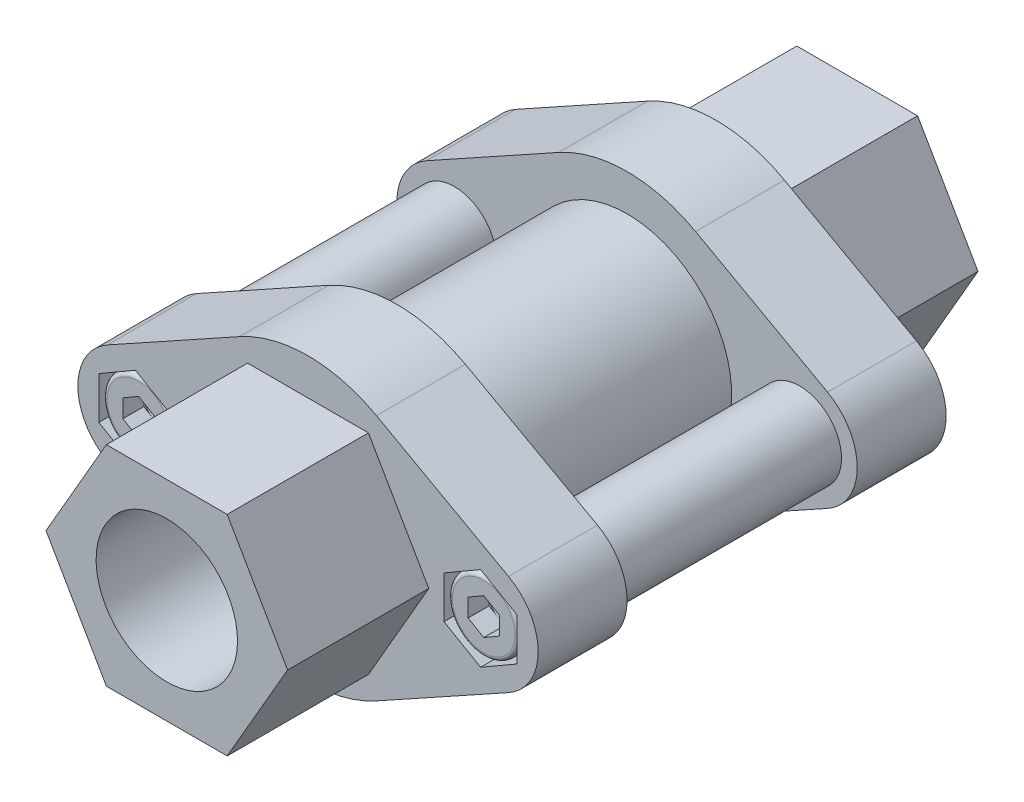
ISO-10303-21;
HEADER;
FILE_DESCRIPTION(('STEP AP214'),'2;1');
FILE_NAME('part.step','',(''),(''),'','','');
FILE_SCHEMA(('AUTOMOTIVE_DESIGN { 1 0 10303 214 1 1 1 1 }'));
ENDSEC;
DATA;
#1=APPLICATION_CONTEXT('core data for automotive mechanical design processes');
#2=APPLICATION_PROTOCOL_DEFINITION('international standard','automotive_design',2000,#1);
#3=PRODUCT_CONTEXT('',#1,'mechanical');
#4=PRODUCT('Part','Part','',(#3));
#5=PRODUCT_RELATED_PRODUCT_CATEGORY('part','',(#4));
#6=PRODUCT_DEFINITION_FORMATION('','',#4);
#7=PRODUCT_DEFINITION_CONTEXT('part definition',#1,'design');
#8=PRODUCT_DEFINITION('design','',#6,#7);
#9=PRODUCT_DEFINITION_SHAPE('','',#8);
#10=(LENGTH_UNIT() NAMED_UNIT(*) SI_UNIT(.MILLI.,.METRE.));
#11=(NAMED_UNIT(*) PLANE_ANGLE_UNIT() SI_UNIT($,.RADIAN.));
#12=(NAMED_UNIT(*) SI_UNIT($,.STERADIAN.) SOLID_ANGLE_UNIT());
#13=UNCERTAINTY_MEASURE_WITH_UNIT(LENGTH_MEASURE(1.E-05),#10,'distance_accuracy_value','');
#14=(GEOMETRIC_REPRESENTATION_CONTEXT(3) GLOBAL_UNCERTAINTY_ASSIGNED_CONTEXT((#13)) GLOBAL_UNIT_ASSIGNED_CONTEXT((#10,
#11,#12)) REPRESENTATION_CONTEXT('',''));
#15=CARTESIAN_POINT('',(0.,0.,0.));
#16=DIRECTION('',(0.,0.,1.));
#17=DIRECTION('',(1.,0.,0.));
#18=AXIS2_PLACEMENT_3D('',#15,#16,#17);
#19=CARTESIAN_POINT('',(20.,-2.02072594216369,17.8));
#20=DIRECTION('',(-1.,0.,0.));
#21=DIRECTION('',(0.,-1.,0.));
#22=AXIS2_PLACEMENT_3D('',#19,#20,#21);
#23=PLANE('',#22);
#24=DIRECTION('',(0.,1.,0.));
#25=VECTOR('',#24,1.);
#26=CARTESIAN_POINT('',(20.,-2.02072594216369,17.1));
#27=LINE('',#26,#25);
#28=CARTESIAN_POINT('',(20.,-1.93649167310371,17.1));
#29=VERTEX_POINT('',#28);
#30=CARTESIAN_POINT('',(20.,1.93649167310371,17.1));
#31=VERTEX_POINT('',#30);
#32=EDGE_CURVE('E769',#29,#31,#27,.T.);
#33=ORIENTED_EDGE('',*,*,#32,.T.);
#34=DIRECTION('',(0.,0.,-1.));
#35=VECTOR('',#34,1.);
#36=CARTESIAN_POINT('',(20.,1.93649167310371,12.8));
#37=LINE('',#36,#35);
#38=CARTESIAN_POINT('',(20.,1.93649167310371,17.8));
#39=VERTEX_POINT('',#38);
#40=EDGE_CURVE('E751',#31,#39,#37,.F.);
#41=ORIENTED_EDGE('',*,*,#40,.T.);
#42=DIRECTION('',(0.,1.,0.));
#43=VECTOR('',#42,1.);
#44=CARTESIAN_POINT('',(20.,-2.02072594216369,17.8));
#45=LINE('',#44,#43);
#46=CARTESIAN_POINT('',(20.,2.02072594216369,17.8));
#47=VERTEX_POINT('',#46);
#48=EDGE_CURVE('E851',#39,#47,#45,.T.);
#49=ORIENTED_EDGE('',*,*,#48,.T.);
#50=DIRECTION('',(0.,0.,-1.));
#51=VECTOR('',#50,1.);
#52=CARTESIAN_POINT('',(20.,2.02072594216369,17.8));
#53=LINE('',#52,#51);
#54=CARTESIAN_POINT('',(20.,2.02072594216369,13.5));
#55=VERTEX_POINT('',#54);
#56=EDGE_CURVE('E899',#47,#55,#53,.T.);
#57=ORIENTED_EDGE('',*,*,#56,.T.);
#58=DIRECTION('',(0.,1.,0.));
#59=VECTOR('',#58,1.);
#60=CARTESIAN_POINT('',(20.,-2.02072594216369,13.5));
#61=LINE('',#60,#59);
#62=CARTESIAN_POINT('',(20.,-2.02072594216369,13.5));
#63=VERTEX_POINT('',#62);
#64=EDGE_CURVE('E846',#63,#55,#61,.T.);
#65=ORIENTED_EDGE('',*,*,#64,.F.);
#66=DIRECTION('',(0.,0.,-1.));
#67=VECTOR('',#66,1.);
#68=CARTESIAN_POINT('',(20.,-2.02072594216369,17.8));
#69=LINE('',#68,#67);
#70=CARTESIAN_POINT('',(20.,-2.02072594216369,17.8));
#71=VERTEX_POINT('',#70);
#72=EDGE_CURVE('E871',#71,#63,#69,.T.);
#73=ORIENTED_EDGE('',*,*,#72,.F.);
#74=CARTESIAN_POINT('',(20.,-1.93649167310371,17.8));
#75=VERTEX_POINT('',#74);
#76=EDGE_CURVE('E847',#71,#75,#45,.T.);
#77=ORIENTED_EDGE('',*,*,#76,.T.);
#78=DIRECTION('',(0.,0.,-1.));
#79=VECTOR('',#78,1.);
#80=CARTESIAN_POINT('',(20.,-1.93649167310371,12.8));
#81=LINE('',#80,#79);
#82=EDGE_CURVE('E747',#75,#29,#81,.T.);
#83=ORIENTED_EDGE('',*,*,#82,.T.);
#84=EDGE_LOOP('',(#33,#41,#49,#57,#65,#73,#77,#83));
#85=FACE_BOUND('',#84,.T.);
#86=ADVANCED_FACE('F14',(#85),#23,.T.);
#87=CARTESIAN_POINT('',(20.,2.02072594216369,17.8));
#88=DIRECTION('',(-0.5,-0.866025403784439,0.));
#89=DIRECTION('',(0.866025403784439,-0.5,0.));
#90=AXIS2_PLACEMENT_3D('',#87,#88,#89);
#91=PLANE('',#90);
#92=DIRECTION('',(-0.866025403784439,0.5,0.));
#93=VECTOR('',#92,1.);
#94=CARTESIAN_POINT('',(20.,2.02072594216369,17.1));
#95=LINE('',#94,#93);
#96=CARTESIAN_POINT('',(19.9270509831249,2.06284307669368,17.1));
#97=VERTEX_POINT('',#96);
#98=CARTESIAN_POINT('',(16.5729490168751,3.99933474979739,17.1));
#99=VERTEX_POINT('',#98);
#100=EDGE_CURVE('E767',#97,#99,#95,.T.);
#101=ORIENTED_EDGE('',*,*,#100,.T.);
#102=DIRECTION('',(0.,0.,-1.));
#103=VECTOR('',#102,1.);
#104=CARTESIAN_POINT('',(16.5729490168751,3.99933474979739,12.8));
#105=LINE('',#104,#103);
#106=CARTESIAN_POINT('',(16.5729490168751,3.99933474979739,17.8));
#107=VERTEX_POINT('',#106);
#108=EDGE_CURVE('E730',#99,#107,#105,.F.);
#109=ORIENTED_EDGE('',*,*,#108,.T.);
#110=DIRECTION('',(-0.866025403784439,0.5,0.));
#111=VECTOR('',#110,1.);
#112=CARTESIAN_POINT('',(20.,2.02072594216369,17.8));
#113=LINE('',#112,#111);
#114=CARTESIAN_POINT('',(16.5,4.04145188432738,17.8));
#115=VERTEX_POINT('',#114);
#116=EDGE_CURVE('E850',#107,#115,#113,.T.);
#117=ORIENTED_EDGE('',*,*,#116,.T.);
#118=DIRECTION('',(0.,0.,-1.));
#119=VECTOR('',#118,1.);
#120=CARTESIAN_POINT('',(16.5,4.04145188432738,17.8));
#121=LINE('',#120,#119);
#122=CARTESIAN_POINT('',(16.5,4.04145188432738,13.5));
#123=VERTEX_POINT('',#122);
#124=EDGE_CURVE('E897',#115,#123,#121,.T.);
#125=ORIENTED_EDGE('',*,*,#124,.T.);
#126=DIRECTION('',(-0.866025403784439,0.5,0.));
#127=VECTOR('',#126,1.);
#128=CARTESIAN_POINT('',(20.,2.02072594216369,13.5));
#129=LINE('',#128,#127);
#130=EDGE_CURVE('E874',#55,#123,#129,.T.);
#131=ORIENTED_EDGE('',*,*,#130,.F.);
#132=ORIENTED_EDGE('',*,*,#56,.F.);
#133=CARTESIAN_POINT('',(19.9270509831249,2.06284307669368,17.8));
#134=VERTEX_POINT('',#133);
#135=EDGE_CURVE('E852',#47,#134,#113,.T.);
#136=ORIENTED_EDGE('',*,*,#135,.T.);
#137=DIRECTION('',(0.,0.,-1.));
#138=VECTOR('',#137,1.);
#139=CARTESIAN_POINT('',(19.9270509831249,2.06284307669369,12.8));
#140=LINE('',#139,#138);
#141=EDGE_CURVE('E749',#134,#97,#140,.T.);
#142=ORIENTED_EDGE('',*,*,#141,.T.);
#143=EDGE_LOOP('',(#101,#109,#117,#125,#131,#132,#136,#142));
#144=FACE_BOUND('',#143,.T.);
#145=ADVANCED_FACE('F1352',(#144),#91,.T.);
#146=CARTESIAN_POINT('',(16.5,4.04145188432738,17.8));
#147=DIRECTION('',(0.5,-0.866025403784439,0.));
#148=DIRECTION('',(0.866025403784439,0.5,0.));
#149=AXIS2_PLACEMENT_3D('',#146,#147,#148);
#150=PLANE('',#149);
#151=DIRECTION('',(-0.866025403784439,-0.5,0.));
#152=VECTOR('',#151,1.);
#153=CARTESIAN_POINT('',(16.5,4.04145188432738,17.1));
#154=LINE('',#153,#152);
#155=CARTESIAN_POINT('',(16.4270509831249,3.99933474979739,17.1));
#156=VERTEX_POINT('',#155);
#157=CARTESIAN_POINT('',(13.0729490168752,2.06284307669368,17.1));
#158=VERTEX_POINT('',#157);
#159=EDGE_CURVE('E765',#156,#158,#154,.T.);
#160=ORIENTED_EDGE('',*,*,#159,.T.);
#161=DIRECTION('',(0.,0.,-1.));
#162=VECTOR('',#161,1.);
#163=CARTESIAN_POINT('',(13.0729490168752,2.06284307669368,12.8));
#164=LINE('',#163,#162);
#165=CARTESIAN_POINT('',(13.0729490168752,2.06284307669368,17.8));
#166=VERTEX_POINT('',#165);
#167=EDGE_CURVE('E735',#158,#166,#164,.F.);
#168=ORIENTED_EDGE('',*,*,#167,.T.);
#169=DIRECTION('',(-0.866025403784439,-0.5,0.));
#170=VECTOR('',#169,1.);
#171=CARTESIAN_POINT('',(16.5,4.04145188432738,17.8));
#172=LINE('',#171,#170);
#173=CARTESIAN_POINT('',(13.,2.02072594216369,17.8));
#174=VERTEX_POINT('',#173);
#175=EDGE_CURVE('E855',#166,#174,#172,.T.);
#176=ORIENTED_EDGE('',*,*,#175,.T.);
#177=DIRECTION('',(0.,0.,-1.));
#178=VECTOR('',#177,1.);
#179=CARTESIAN_POINT('',(13.,2.02072594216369,17.8));
#180=LINE('',#179,#178);
#181=CARTESIAN_POINT('',(13.,2.02072594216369,13.5));
#182=VERTEX_POINT('',#181);
#183=EDGE_CURVE('E895',#174,#182,#180,.T.);
#184=ORIENTED_EDGE('',*,*,#183,.T.);
#185=DIRECTION('',(-0.866025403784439,-0.5,0.));
#186=VECTOR('',#185,1.);
#187=CARTESIAN_POINT('',(16.5,4.04145188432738,13.5));
#188=LINE('',#187,#186);
#189=EDGE_CURVE('E877',#123,#182,#188,.T.);
#190=ORIENTED_EDGE('',*,*,#189,.F.);
#191=ORIENTED_EDGE('',*,*,#124,.F.);
#192=CARTESIAN_POINT('',(16.4270509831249,3.99933474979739,17.8));
#193=VERTEX_POINT('',#192);
#194=EDGE_CURVE('E856',#115,#193,#172,.T.);
#195=ORIENTED_EDGE('',*,*,#194,.T.);
#196=DIRECTION('',(0.,0.,-1.));
#197=VECTOR('',#196,1.);
#198=CARTESIAN_POINT('',(16.4270509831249,3.99933474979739,12.8));
#199=LINE('',#198,#197);
#200=EDGE_CURVE('E728',#193,#156,#199,.T.);
#201=ORIENTED_EDGE('',*,*,#200,.T.);
#202=EDGE_LOOP('',(#160,#168,#176,#184,#190,#191,#195,#201));
#203=FACE_BOUND('',#202,.T.);
#204=ADVANCED_FACE('F1358',(#203),#150,.T.);
#205=CARTESIAN_POINT('',(13.,2.02072594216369,17.8));
#206=DIRECTION('',(1.,0.,0.));
#207=DIRECTION('',(0.,1.,0.));
#208=AXIS2_PLACEMENT_3D('',#205,#206,#207);
#209=PLANE('',#208);
#210=DIRECTION('',(0.,-1.,0.));
#211=VECTOR('',#210,1.);
#212=CARTESIAN_POINT('',(13.,2.02072594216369,17.1));
#213=LINE('',#212,#211);
#214=CARTESIAN_POINT('',(13.,1.93649167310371,17.1));
#215=VERTEX_POINT('',#214);
#216=CARTESIAN_POINT('',(13.,-1.93649167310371,17.1));
#217=VERTEX_POINT('',#216);
#218=EDGE_CURVE('E763',#215,#217,#213,.T.);
#219=ORIENTED_EDGE('',*,*,#218,.T.);
#220=DIRECTION('',(0.,0.,-1.));
#221=VECTOR('',#220,1.);
#222=CARTESIAN_POINT('',(13.,-1.93649167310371,12.8));
#223=LINE('',#222,#221);
#224=CARTESIAN_POINT('',(13.,-1.93649167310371,17.8));
#225=VERTEX_POINT('',#224);
#226=EDGE_CURVE('E739',#217,#225,#223,.F.);
#227=ORIENTED_EDGE('',*,*,#226,.T.);
#228=DIRECTION('',(0.,-1.,0.));
#229=VECTOR('',#228,1.);
#230=CARTESIAN_POINT('',(13.,2.02072594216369,17.8));
#231=LINE('',#230,#229);
#232=CARTESIAN_POINT('',(13.,-2.02072594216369,17.8));
#233=VERTEX_POINT('',#232);
#234=EDGE_CURVE('E859',#225,#233,#231,.T.);
#235=ORIENTED_EDGE('',*,*,#234,.T.);
#236=DIRECTION('',(0.,0.,-1.));
#237=VECTOR('',#236,1.);
#238=CARTESIAN_POINT('',(13.,-2.02072594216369,17.8));
#239=LINE('',#238,#237);
#240=CARTESIAN_POINT('',(13.,-2.02072594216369,13.5));
#241=VERTEX_POINT('',#240);
#242=EDGE_CURVE('E893',#233,#241,#239,.T.);
#243=ORIENTED_EDGE('',*,*,#242,.T.);
#244=DIRECTION('',(0.,-1.,0.));
#245=VECTOR('',#244,1.);
#246=CARTESIAN_POINT('',(13.,2.02072594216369,13.5));
#247=LINE('',#246,#245);
#248=EDGE_CURVE('E880',#182,#241,#247,.T.);
#249=ORIENTED_EDGE('',*,*,#248,.F.);
#250=ORIENTED_EDGE('',*,*,#183,.F.);
#251=CARTESIAN_POINT('',(13.,1.93649167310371,17.8));
#252=VERTEX_POINT('',#251);
#253=EDGE_CURVE('E860',#174,#252,#231,.T.);
#254=ORIENTED_EDGE('',*,*,#253,.T.);
#255=DIRECTION('',(0.,0.,-1.));
#256=VECTOR('',#255,1.);
#257=CARTESIAN_POINT('',(13.,1.93649167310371,12.8));
#258=LINE('',#257,#256);
#259=EDGE_CURVE('E733',#252,#215,#258,.T.);
#260=ORIENTED_EDGE('',*,*,#259,.T.);
#261=EDGE_LOOP('',(#219,#227,#235,#243,#249,#250,#254,#260));
#262=FACE_BOUND('',#261,.T.);
#263=ADVANCED_FACE('F2574',(#262),#209,.T.);
#264=CARTESIAN_POINT('',(13.,-2.02072594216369,17.8));
#265=DIRECTION('',(0.5,0.866025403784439,0.));
#266=DIRECTION('',(-0.866025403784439,0.5,0.));
#267=AXIS2_PLACEMENT_3D('',#264,#265,#266);
#268=PLANE('',#267);
#269=DIRECTION('',(0.866025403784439,-0.5,0.));
#270=VECTOR('',#269,1.);
#271=CARTESIAN_POINT('',(13.,-2.02072594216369,17.1));
#272=LINE('',#271,#270);
#273=CARTESIAN_POINT('',(13.0729490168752,-2.06284307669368,17.1));
#274=VERTEX_POINT('',#273);
#275=CARTESIAN_POINT('',(16.4270509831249,-3.99933474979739,17.1));
#276=VERTEX_POINT('',#275);
#277=EDGE_CURVE('E756',#274,#276,#272,.T.);
#278=ORIENTED_EDGE('',*,*,#277,.T.);
#279=DIRECTION('',(0.,0.,-1.));
#280=VECTOR('',#279,1.);
#281=CARTESIAN_POINT('',(16.4270509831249,-3.99933474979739,12.8));
#282=LINE('',#281,#280);
#283=CARTESIAN_POINT('',(16.4270509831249,-3.99933474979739,17.8));
#284=VERTEX_POINT('',#283);
#285=EDGE_CURVE('E743',#276,#284,#282,.F.);
#286=ORIENTED_EDGE('',*,*,#285,.T.);
#287=DIRECTION('',(0.866025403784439,-0.5,0.));
#288=VECTOR('',#287,1.);
#289=CARTESIAN_POINT('',(13.,-2.02072594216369,17.8));
#290=LINE('',#289,#288);
#291=CARTESIAN_POINT('',(16.5,-4.04145188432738,17.8));
#292=VERTEX_POINT('',#291);
#293=EDGE_CURVE('E863',#284,#292,#290,.T.);
#294=ORIENTED_EDGE('',*,*,#293,.T.);
#295=DIRECTION('',(0.,0.,-1.));
#296=VECTOR('',#295,1.);
#297=CARTESIAN_POINT('',(16.5,-4.04145188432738,17.8));
#298=LINE('',#297,#296);
#299=CARTESIAN_POINT('',(16.5,-4.04145188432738,13.5));
#300=VERTEX_POINT('',#299);
#301=EDGE_CURVE('E891',#292,#300,#298,.T.);
#302=ORIENTED_EDGE('',*,*,#301,.T.);
#303=DIRECTION('',(0.866025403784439,-0.5,0.));
#304=VECTOR('',#303,1.);
#305=CARTESIAN_POINT('',(13.,-2.02072594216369,13.5));
#306=LINE('',#305,#304);
#307=EDGE_CURVE('E883',#241,#300,#306,.T.);
#308=ORIENTED_EDGE('',*,*,#307,.F.);
#309=ORIENTED_EDGE('',*,*,#242,.F.);
#310=CARTESIAN_POINT('',(13.0729490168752,-2.06284307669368,17.8));
#311=VERTEX_POINT('',#310);
#312=EDGE_CURVE('E864',#233,#311,#290,.T.);
#313=ORIENTED_EDGE('',*,*,#312,.T.);
#314=DIRECTION('',(0.,0.,-1.));
#315=VECTOR('',#314,1.);
#316=CARTESIAN_POINT('',(13.0729490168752,-2.06284307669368,12.8));
#317=LINE('',#316,#315);
#318=EDGE_CURVE('E737',#311,#274,#317,.T.);
#319=ORIENTED_EDGE('',*,*,#318,.T.);
#320=EDGE_LOOP('',(#278,#286,#294,#302,#308,#309,#313,#319));
#321=FACE_BOUND('',#320,.T.);
#322=ADVANCED_FACE('F2559',(#321),#268,.T.);
#323=CARTESIAN_POINT('',(16.5,-4.04145188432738,17.8));
#324=DIRECTION('',(-0.5,0.866025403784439,0.));
#325=DIRECTION('',(-0.866025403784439,-0.5,0.));
#326=AXIS2_PLACEMENT_3D('',#323,#324,#325);
#327=PLANE('',#326);
#328=DIRECTION('',(0.866025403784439,0.5,0.));
#329=VECTOR('',#328,1.);
#330=CARTESIAN_POINT('',(16.5,-4.04145188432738,17.1));
#331=LINE('',#330,#329);
#332=CARTESIAN_POINT('',(16.5729490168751,-3.99933474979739,17.1));
#333=VERTEX_POINT('',#332);
#334=CARTESIAN_POINT('',(19.9270509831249,-2.06284307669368,17.1));
#335=VERTEX_POINT('',#334);
#336=EDGE_CURVE('E1276',#333,#335,#331,.T.);
#337=ORIENTED_EDGE('',*,*,#336,.T.);
#338=DIRECTION('',(0.,0.,-1.));
#339=VECTOR('',#338,1.);
#340=CARTESIAN_POINT('',(19.9270509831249,-2.06284307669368,12.8));
#341=LINE('',#340,#339);
#342=CARTESIAN_POINT('',(19.9270509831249,-2.06284307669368,17.8));
#343=VERTEX_POINT('',#342);
#344=EDGE_CURVE('E745',#335,#343,#341,.F.);
#345=ORIENTED_EDGE('',*,*,#344,.T.);
#346=DIRECTION('',(0.866025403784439,0.5,0.));
#347=VECTOR('',#346,1.);
#348=CARTESIAN_POINT('',(16.5,-4.04145188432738,17.8));
#349=LINE('',#348,#347);
#350=EDGE_CURVE('E867',#343,#71,#349,.T.);
#351=ORIENTED_EDGE('',*,*,#350,.T.);
#352=ORIENTED_EDGE('',*,*,#72,.T.);
#353=DIRECTION('',(0.866025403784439,0.5,0.));
#354=VECTOR('',#353,1.);
#355=CARTESIAN_POINT('',(16.5,-4.04145188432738,13.5));
#356=LINE('',#355,#354);
#357=EDGE_CURVE('E886',#300,#63,#356,.T.);
#358=ORIENTED_EDGE('',*,*,#357,.F.);
#359=ORIENTED_EDGE('',*,*,#301,.F.);
#360=CARTESIAN_POINT('',(16.5729490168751,-3.99933474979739,17.8));
#361=VERTEX_POINT('',#360);
#362=EDGE_CURVE('E868',#292,#361,#349,.T.);
#363=ORIENTED_EDGE('',*,*,#362,.T.);
#364=DIRECTION('',(0.,0.,-1.));
#365=VECTOR('',#364,1.);
#366=CARTESIAN_POINT('',(16.5729490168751,-3.99933474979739,12.8));
#367=LINE('',#366,#365);
#368=EDGE_CURVE('E741',#361,#333,#367,.T.);
#369=ORIENTED_EDGE('',*,*,#368,.T.);
#370=EDGE_LOOP('',(#337,#345,#351,#352,#358,#359,#363,#369));
#371=FACE_BOUND('',#370,.T.);
#372=ADVANCED_FACE('F2565',(#371),#327,.T.);
#373=CARTESIAN_POINT('',(0.,0.,17.8));
#374=DIRECTION('',(0.,0.,1.));
#375=DIRECTION('',(0.,1.,0.));
#376=AXIS2_PLACEMENT_3D('',#373,#374,#375);
#377=PLANE('',#376);
#378=CARTESIAN_POINT('',(16.5,0.,17.8));
#379=DIRECTION('',(0.,0.,1.));
#380=DIRECTION('',(0.,1.,0.));
#381=AXIS2_PLACEMENT_3D('',#378,#379,#380);
#382=CIRCLE('',#381,4.);
#383=EDGE_CURVE('E1275',#134,#39,#382,.F.);
#384=ORIENTED_EDGE('',*,*,#383,.F.);
#385=ORIENTED_EDGE('',*,*,#135,.F.);
#386=ORIENTED_EDGE('',*,*,#48,.F.);
#387=EDGE_LOOP('',(#384,#385,#386));
#388=FACE_BOUND('',#387,.T.);
#389=ADVANCED_FACE('F1795',(#388),#377,.F.);
#390=EDGE_CURVE('E2583',#75,#343,#382,.F.);
#391=ORIENTED_EDGE('',*,*,#390,.F.);
#392=ORIENTED_EDGE('',*,*,#76,.F.);
#393=ORIENTED_EDGE('',*,*,#350,.F.);
#394=EDGE_LOOP('',(#391,#392,#393));
#395=FACE_BOUND('',#394,.T.);
#396=ADVANCED_FACE('F2607',(#395),#377,.F.);
#397=EDGE_CURVE('E2556',#361,#284,#382,.F.);
#398=ORIENTED_EDGE('',*,*,#397,.F.);
#399=ORIENTED_EDGE('',*,*,#362,.F.);
#400=ORIENTED_EDGE('',*,*,#293,.F.);
#401=EDGE_LOOP('',(#398,#399,#400));
#402=FACE_BOUND('',#401,.T.);
#403=ADVANCED_FACE('F2563',(#402),#377,.F.);
#404=EDGE_CURVE('E2581',#311,#225,#382,.F.);
#405=ORIENTED_EDGE('',*,*,#404,.F.);
#406=ORIENTED_EDGE('',*,*,#312,.F.);
#407=ORIENTED_EDGE('',*,*,#234,.F.);
#408=EDGE_LOOP('',(#405,#406,#407));
#409=FACE_BOUND('',#408,.T.);
#410=ADVANCED_FACE('F2580',(#409),#377,.F.);
#411=EDGE_CURVE('E1274',#252,#166,#382,.F.);
#412=ORIENTED_EDGE('',*,*,#411,.F.);
#413=ORIENTED_EDGE('',*,*,#253,.F.);
#414=ORIENTED_EDGE('',*,*,#175,.F.);
#415=EDGE_LOOP('',(#412,#413,#414));
#416=FACE_BOUND('',#415,.T.);
#417=ADVANCED_FACE('F1394',(#416),#377,.F.);
#418=CARTESIAN_POINT('',(-13.,-2.02072594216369,17.8));
#419=DIRECTION('',(-1.,0.,0.));
#420=DIRECTION('',(0.,-1.,0.));
#421=AXIS2_PLACEMENT_3D('',#418,#419,#420);
#422=PLANE('',#421);
#423=DIRECTION('',(0.,1.,0.));
#424=VECTOR('',#423,1.);
#425=CARTESIAN_POINT('',(-13.,-2.02072594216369,17.1));
#426=LINE('',#425,#424);
#427=CARTESIAN_POINT('',(-13.,-1.93649167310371,17.1));
#428=VERTEX_POINT('',#427);
#429=CARTESIAN_POINT('',(-13.,1.93649167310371,17.1));
#430=VERTEX_POINT('',#429);
#431=EDGE_CURVE('E844',#428,#430,#426,.T.);
#432=ORIENTED_EDGE('',*,*,#431,.T.);
#433=DIRECTION('',(0.,0.,-1.));
#434=VECTOR('',#433,1.);
#435=CARTESIAN_POINT('',(-13.,1.93649167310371,12.8));
#436=LINE('',#435,#434);
#437=CARTESIAN_POINT('',(-13.,1.93649167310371,17.8));
#438=VERTEX_POINT('',#437);
#439=EDGE_CURVE('E826',#430,#438,#436,.F.);
#440=ORIENTED_EDGE('',*,*,#439,.T.);
#441=DIRECTION('',(0.,1.,0.));
#442=VECTOR('',#441,1.);
#443=CARTESIAN_POINT('',(-13.,-2.02072594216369,17.8));
#444=LINE('',#443,#442);
#445=CARTESIAN_POINT('',(-13.,2.02072594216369,17.8));
#446=VERTEX_POINT('',#445);
#447=EDGE_CURVE('E907',#438,#446,#444,.T.);
#448=ORIENTED_EDGE('',*,*,#447,.T.);
#449=DIRECTION('',(0.,0.,-1.));
#450=VECTOR('',#449,1.);
#451=CARTESIAN_POINT('',(-13.,2.02072594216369,17.8));
#452=LINE('',#451,#450);
#453=CARTESIAN_POINT('',(-13.,2.02072594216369,13.5));
#454=VERTEX_POINT('',#453);
#455=EDGE_CURVE('E955',#446,#454,#452,.T.);
#456=ORIENTED_EDGE('',*,*,#455,.T.);
#457=DIRECTION('',(0.,1.,0.));
#458=VECTOR('',#457,1.);
#459=CARTESIAN_POINT('',(-13.,-2.02072594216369,13.5));
#460=LINE('',#459,#458);
#461=CARTESIAN_POINT('',(-13.,-2.02072594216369,13.5));
#462=VERTEX_POINT('',#461);
#463=EDGE_CURVE('E902',#462,#454,#460,.T.);
#464=ORIENTED_EDGE('',*,*,#463,.F.);
#465=DIRECTION('',(0.,0.,-1.));
#466=VECTOR('',#465,1.);
#467=CARTESIAN_POINT('',(-13.,-2.02072594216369,17.8));
#468=LINE('',#467,#466);
#469=CARTESIAN_POINT('',(-13.,-2.02072594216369,17.8));
#470=VERTEX_POINT('',#469);
#471=EDGE_CURVE('E927',#470,#462,#468,.T.);
#472=ORIENTED_EDGE('',*,*,#471,.F.);
#473=CARTESIAN_POINT('',(-13.,-1.93649167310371,17.8));
#474=VERTEX_POINT('',#473);
#475=EDGE_CURVE('E903',#470,#474,#444,.T.);
#476=ORIENTED_EDGE('',*,*,#475,.T.);
#477=DIRECTION('',(0.,0.,-1.));
#478=VECTOR('',#477,1.);
#479=CARTESIAN_POINT('',(-13.,-1.93649167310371,12.8));
#480=LINE('',#479,#478);
#481=EDGE_CURVE('E822',#474,#428,#480,.T.);
#482=ORIENTED_EDGE('',*,*,#481,.T.);
#483=EDGE_LOOP('',(#432,#440,#448,#456,#464,#472,#476,#482));
#484=FACE_BOUND('',#483,.T.);
#485=ADVANCED_FACE('F1390',(#484),#422,.T.);
#486=CARTESIAN_POINT('',(-13.,2.02072594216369,17.8));
#487=DIRECTION('',(-0.5,-0.866025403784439,0.));
#488=DIRECTION('',(0.866025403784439,-0.5,0.));
#489=AXIS2_PLACEMENT_3D('',#486,#487,#488);
#490=PLANE('',#489);
#491=DIRECTION('',(-0.866025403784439,0.5,0.));
#492=VECTOR('',#491,1.);
#493=CARTESIAN_POINT('',(-13.,2.02072594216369,17.1));
#494=LINE('',#493,#492);
#495=CARTESIAN_POINT('',(-13.0729490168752,2.06284307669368,17.1));
#496=VERTEX_POINT('',#495);
#497=CARTESIAN_POINT('',(-16.4270509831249,3.99933474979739,17.1));
#498=VERTEX_POINT('',#497);
#499=EDGE_CURVE('E842',#496,#498,#494,.T.);
#500=ORIENTED_EDGE('',*,*,#499,.T.);
#501=DIRECTION('',(0.,0.,-1.));
#502=VECTOR('',#501,1.);
#503=CARTESIAN_POINT('',(-16.4270509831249,3.99933474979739,12.8));
#504=LINE('',#503,#502);
#505=CARTESIAN_POINT('',(-16.4270509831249,3.99933474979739,17.8));
#506=VERTEX_POINT('',#505);
#507=EDGE_CURVE('E805',#498,#506,#504,.F.);
#508=ORIENTED_EDGE('',*,*,#507,.T.);
#509=DIRECTION('',(-0.866025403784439,0.5,0.));
#510=VECTOR('',#509,1.);
#511=CARTESIAN_POINT('',(-13.,2.02072594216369,17.8));
#512=LINE('',#511,#510);
#513=CARTESIAN_POINT('',(-16.5,4.04145188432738,17.8));
#514=VERTEX_POINT('',#513);
#515=EDGE_CURVE('E906',#506,#514,#512,.T.);
#516=ORIENTED_EDGE('',*,*,#515,.T.);
#517=DIRECTION('',(0.,0.,-1.));
#518=VECTOR('',#517,1.);
#519=CARTESIAN_POINT('',(-16.5,4.04145188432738,17.8));
#520=LINE('',#519,#518);
#521=CARTESIAN_POINT('',(-16.5,4.04145188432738,13.5));
#522=VERTEX_POINT('',#521);
#523=EDGE_CURVE('E953',#514,#522,#520,.T.);
#524=ORIENTED_EDGE('',*,*,#523,.T.);
#525=DIRECTION('',(-0.866025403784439,0.5,0.));
#526=VECTOR('',#525,1.);
#527=CARTESIAN_POINT('',(-13.,2.02072594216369,13.5));
#528=LINE('',#527,#526);
#529=EDGE_CURVE('E930',#454,#522,#528,.T.);
#530=ORIENTED_EDGE('',*,*,#529,.F.);
#531=ORIENTED_EDGE('',*,*,#455,.F.);
#532=CARTESIAN_POINT('',(-13.0729490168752,2.06284307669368,17.8));
#533=VERTEX_POINT('',#532);
#534=EDGE_CURVE('E908',#446,#533,#512,.T.);
#535=ORIENTED_EDGE('',*,*,#534,.T.);
#536=DIRECTION('',(0.,0.,-1.));
#537=VECTOR('',#536,1.);
#538=CARTESIAN_POINT('',(-13.0729490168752,2.06284307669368,12.8));
#539=LINE('',#538,#537);
#540=EDGE_CURVE('E824',#533,#496,#539,.T.);
#541=ORIENTED_EDGE('',*,*,#540,.T.);
#542=EDGE_LOOP('',(#500,#508,#516,#524,#530,#531,#535,#541));
#543=FACE_BOUND('',#542,.T.);
#544=ADVANCED_FACE('F1386',(#543),#490,.T.);
#545=CARTESIAN_POINT('',(-16.5,4.04145188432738,17.8));
#546=DIRECTION('',(0.5,-0.866025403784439,0.));
#547=DIRECTION('',(0.866025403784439,0.5,0.));
#548=AXIS2_PLACEMENT_3D('',#545,#546,#547);
#549=PLANE('',#548);
#550=DIRECTION('',(-0.866025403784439,-0.5,0.));
#551=VECTOR('',#550,1.);
#552=CARTESIAN_POINT('',(-16.5,4.04145188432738,17.1));
#553=LINE('',#552,#551);
#554=CARTESIAN_POINT('',(-16.5729490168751,3.99933474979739,17.1));
#555=VERTEX_POINT('',#554);
#556=CARTESIAN_POINT('',(-19.9270509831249,2.06284307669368,17.1));
#557=VERTEX_POINT('',#556);
#558=EDGE_CURVE('E840',#555,#557,#553,.T.);
#559=ORIENTED_EDGE('',*,*,#558,.T.);
#560=DIRECTION('',(0.,0.,-1.));
#561=VECTOR('',#560,1.);
#562=CARTESIAN_POINT('',(-19.9270509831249,2.06284307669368,12.8));
#563=LINE('',#562,#561);
#564=CARTESIAN_POINT('',(-19.9270509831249,2.06284307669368,17.8));
#565=VERTEX_POINT('',#564);
#566=EDGE_CURVE('E810',#557,#565,#563,.F.);
#567=ORIENTED_EDGE('',*,*,#566,.T.);
#568=DIRECTION('',(-0.866025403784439,-0.5,0.));
#569=VECTOR('',#568,1.);
#570=CARTESIAN_POINT('',(-16.5,4.04145188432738,17.8));
#571=LINE('',#570,#569);
#572=CARTESIAN_POINT('',(-20.,2.02072594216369,17.8));
#573=VERTEX_POINT('',#572);
#574=EDGE_CURVE('E911',#565,#573,#571,.T.);
#575=ORIENTED_EDGE('',*,*,#574,.T.);
#576=DIRECTION('',(0.,0.,-1.));
#577=VECTOR('',#576,1.);
#578=CARTESIAN_POINT('',(-20.,2.02072594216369,17.8));
#579=LINE('',#578,#577);
#580=CARTESIAN_POINT('',(-20.,2.02072594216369,13.5));
#581=VERTEX_POINT('',#580);
#582=EDGE_CURVE('E951',#573,#581,#579,.T.);
#583=ORIENTED_EDGE('',*,*,#582,.T.);
#584=DIRECTION('',(-0.866025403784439,-0.5,0.));
#585=VECTOR('',#584,1.);
#586=CARTESIAN_POINT('',(-16.5,4.04145188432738,13.5));
#587=LINE('',#586,#585);
#588=EDGE_CURVE('E933',#522,#581,#587,.T.);
#589=ORIENTED_EDGE('',*,*,#588,.F.);
#590=ORIENTED_EDGE('',*,*,#523,.F.);
#591=CARTESIAN_POINT('',(-16.5729490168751,3.99933474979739,17.8));
#592=VERTEX_POINT('',#591);
#593=EDGE_CURVE('E912',#514,#592,#571,.T.);
#594=ORIENTED_EDGE('',*,*,#593,.T.);
#595=DIRECTION('',(0.,0.,-1.));
#596=VECTOR('',#595,1.);
#597=CARTESIAN_POINT('',(-16.5729490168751,3.99933474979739,12.8));
#598=LINE('',#597,#596);
#599=EDGE_CURVE('E803',#592,#555,#598,.T.);
#600=ORIENTED_EDGE('',*,*,#599,.T.);
#601=EDGE_LOOP('',(#559,#567,#575,#583,#589,#590,#594,#600));
#602=FACE_BOUND('',#601,.T.);
#603=ADVANCED_FACE('F1382',(#602),#549,.T.);
#604=CARTESIAN_POINT('',(-20.,2.02072594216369,17.8));
#605=DIRECTION('',(1.,0.,0.));
#606=DIRECTION('',(0.,1.,0.));
#607=AXIS2_PLACEMENT_3D('',#604,#605,#606);
#608=PLANE('',#607);
#609=DIRECTION('',(0.,-1.,0.));
#610=VECTOR('',#609,1.);
#611=CARTESIAN_POINT('',(-20.,2.02072594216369,17.1));
#612=LINE('',#611,#610);
#613=CARTESIAN_POINT('',(-20.,1.93649167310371,17.1));
#614=VERTEX_POINT('',#613);
#615=CARTESIAN_POINT('',(-20.,-1.93649167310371,17.1));
#616=VERTEX_POINT('',#615);
#617=EDGE_CURVE('E838',#614,#616,#612,.T.);
#618=ORIENTED_EDGE('',*,*,#617,.T.);
#619=DIRECTION('',(0.,0.,-1.));
#620=VECTOR('',#619,1.);
#621=CARTESIAN_POINT('',(-20.,-1.93649167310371,12.8));
#622=LINE('',#621,#620);
#623=CARTESIAN_POINT('',(-20.,-1.93649167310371,17.8));
#624=VERTEX_POINT('',#623);
#625=EDGE_CURVE('E814',#616,#624,#622,.F.);
#626=ORIENTED_EDGE('',*,*,#625,.T.);
#627=DIRECTION('',(0.,-1.,0.));
#628=VECTOR('',#627,1.);
#629=CARTESIAN_POINT('',(-20.,2.02072594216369,17.8));
#630=LINE('',#629,#628);
#631=CARTESIAN_POINT('',(-20.,-2.02072594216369,17.8));
#632=VERTEX_POINT('',#631);
#633=EDGE_CURVE('E915',#624,#632,#630,.T.);
#634=ORIENTED_EDGE('',*,*,#633,.T.);
#635=DIRECTION('',(0.,0.,-1.));
#636=VECTOR('',#635,1.);
#637=CARTESIAN_POINT('',(-20.,-2.02072594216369,17.8));
#638=LINE('',#637,#636);
#639=CARTESIAN_POINT('',(-20.,-2.02072594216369,13.5));
#640=VERTEX_POINT('',#639);
#641=EDGE_CURVE('E949',#632,#640,#638,.T.);
#642=ORIENTED_EDGE('',*,*,#641,.T.);
#643=DIRECTION('',(0.,-1.,0.));
#644=VECTOR('',#643,1.);
#645=CARTESIAN_POINT('',(-20.,2.02072594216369,13.5));
#646=LINE('',#645,#644);
#647=EDGE_CURVE('E936',#581,#640,#646,.T.);
#648=ORIENTED_EDGE('',*,*,#647,.F.);
#649=ORIENTED_EDGE('',*,*,#582,.F.);
#650=CARTESIAN_POINT('',(-20.,1.93649167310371,17.8));
#651=VERTEX_POINT('',#650);
#652=EDGE_CURVE('E916',#573,#651,#630,.T.);
#653=ORIENTED_EDGE('',*,*,#652,.T.);
#654=DIRECTION('',(0.,0.,-1.));
#655=VECTOR('',#654,1.);
#656=CARTESIAN_POINT('',(-20.,1.93649167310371,12.8));
#657=LINE('',#656,#655);
#658=EDGE_CURVE('E808',#651,#614,#657,.T.);
#659=ORIENTED_EDGE('',*,*,#658,.T.);
#660=EDGE_LOOP('',(#618,#626,#634,#642,#648,#649,#653,#659));
#661=FACE_BOUND('',#660,.T.);
#662=ADVANCED_FACE('F1378',(#661),#608,.T.);
#663=CARTESIAN_POINT('',(-20.,-2.02072594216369,17.8));
#664=DIRECTION('',(0.5,0.866025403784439,0.));
#665=DIRECTION('',(-0.866025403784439,0.5,0.));
#666=AXIS2_PLACEMENT_3D('',#663,#664,#665);
#667=PLANE('',#666);
#668=DIRECTION('',(0.866025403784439,-0.5,0.));
#669=VECTOR('',#668,1.);
#670=CARTESIAN_POINT('',(-20.,-2.02072594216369,17.1));
#671=LINE('',#670,#669);
#672=CARTESIAN_POINT('',(-19.9270509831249,-2.06284307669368,17.1));
#673=VERTEX_POINT('',#672);
#674=CARTESIAN_POINT('',(-16.5729490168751,-3.99933474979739,17.1));
#675=VERTEX_POINT('',#674);
#676=EDGE_CURVE('E831',#673,#675,#671,.T.);
#677=ORIENTED_EDGE('',*,*,#676,.T.);
#678=DIRECTION('',(0.,0.,-1.));
#679=VECTOR('',#678,1.);
#680=CARTESIAN_POINT('',(-16.5729490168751,-3.99933474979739,12.8));
#681=LINE('',#680,#679);
#682=CARTESIAN_POINT('',(-16.5729490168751,-3.99933474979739,17.8));
#683=VERTEX_POINT('',#682);
#684=EDGE_CURVE('E818',#675,#683,#681,.F.);
#685=ORIENTED_EDGE('',*,*,#684,.T.);
#686=DIRECTION('',(0.866025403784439,-0.5,0.));
#687=VECTOR('',#686,1.);
#688=CARTESIAN_POINT('',(-20.,-2.02072594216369,17.8));
#689=LINE('',#688,#687);
#690=CARTESIAN_POINT('',(-16.5,-4.04145188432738,17.8));
#691=VERTEX_POINT('',#690);
#692=EDGE_CURVE('E919',#683,#691,#689,.T.);
#693=ORIENTED_EDGE('',*,*,#692,.T.);
#694=DIRECTION('',(0.,0.,-1.));
#695=VECTOR('',#694,1.);
#696=CARTESIAN_POINT('',(-16.5,-4.04145188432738,17.8));
#697=LINE('',#696,#695);
#698=CARTESIAN_POINT('',(-16.5,-4.04145188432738,13.5));
#699=VERTEX_POINT('',#698);
#700=EDGE_CURVE('E947',#691,#699,#697,.T.);
#701=ORIENTED_EDGE('',*,*,#700,.T.);
#702=DIRECTION('',(0.866025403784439,-0.5,0.));
#703=VECTOR('',#702,1.);
#704=CARTESIAN_POINT('',(-20.,-2.02072594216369,13.5));
#705=LINE('',#704,#703);
#706=EDGE_CURVE('E939',#640,#699,#705,.T.);
#707=ORIENTED_EDGE('',*,*,#706,.F.);
#708=ORIENTED_EDGE('',*,*,#641,.F.);
#709=CARTESIAN_POINT('',(-19.9270509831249,-2.06284307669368,17.8));
#710=VERTEX_POINT('',#709);
#711=EDGE_CURVE('E920',#632,#710,#689,.T.);
#712=ORIENTED_EDGE('',*,*,#711,.T.);
#713=DIRECTION('',(0.,0.,-1.));
#714=VECTOR('',#713,1.);
#715=CARTESIAN_POINT('',(-19.9270509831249,-2.06284307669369,12.8));
#716=LINE('',#715,#714);
#717=EDGE_CURVE('E812',#710,#673,#716,.T.);
#718=ORIENTED_EDGE('',*,*,#717,.T.);
#719=EDGE_LOOP('',(#677,#685,#693,#701,#707,#708,#712,#718));
#720=FACE_BOUND('',#719,.T.);
#721=ADVANCED_FACE('F1374',(#720),#667,.T.);
#722=CARTESIAN_POINT('',(-16.5,-4.04145188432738,17.8));
#723=DIRECTION('',(-0.5,0.866025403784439,0.));
#724=DIRECTION('',(-0.866025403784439,-0.5,0.));
#725=AXIS2_PLACEMENT_3D('',#722,#723,#724);
#726=PLANE('',#725);
#727=DIRECTION('',(0.866025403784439,0.5,0.));
#728=VECTOR('',#727,1.);
#729=CARTESIAN_POINT('',(-16.5,-4.04145188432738,17.1));
#730=LINE('',#729,#728);
#731=CARTESIAN_POINT('',(-16.4270509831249,-3.99933474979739,17.1));
#732=VERTEX_POINT('',#731);
#733=CARTESIAN_POINT('',(-13.0729490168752,-2.06284307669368,17.1));
#734=VERTEX_POINT('',#733);
#735=EDGE_CURVE('E1268',#732,#734,#730,.T.);
#736=ORIENTED_EDGE('',*,*,#735,.T.);
#737=DIRECTION('',(0.,0.,-1.));
#738=VECTOR('',#737,1.);
#739=CARTESIAN_POINT('',(-13.0729490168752,-2.06284307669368,12.8));
#740=LINE('',#739,#738);
#741=CARTESIAN_POINT('',(-13.0729490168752,-2.06284307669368,17.8));
#742=VERTEX_POINT('',#741);
#743=EDGE_CURVE('E820',#734,#742,#740,.F.);
#744=ORIENTED_EDGE('',*,*,#743,.T.);
#745=DIRECTION('',(0.866025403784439,0.5,0.));
#746=VECTOR('',#745,1.);
#747=CARTESIAN_POINT('',(-16.5,-4.04145188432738,17.8));
#748=LINE('',#747,#746);
#749=EDGE_CURVE('E923',#742,#470,#748,.T.);
#750=ORIENTED_EDGE('',*,*,#749,.T.);
#751=ORIENTED_EDGE('',*,*,#471,.T.);
#752=DIRECTION('',(0.866025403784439,0.5,0.));
#753=VECTOR('',#752,1.);
#754=CARTESIAN_POINT('',(-16.5,-4.04145188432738,13.5));
#755=LINE('',#754,#753);
#756=EDGE_CURVE('E942',#699,#462,#755,.T.);
#757=ORIENTED_EDGE('',*,*,#756,.F.);
#758=ORIENTED_EDGE('',*,*,#700,.F.);
#759=CARTESIAN_POINT('',(-16.4270509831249,-3.99933474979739,17.8));
#760=VERTEX_POINT('',#759);
#761=EDGE_CURVE('E924',#691,#760,#748,.T.);
#762=ORIENTED_EDGE('',*,*,#761,.T.);
#763=DIRECTION('',(0.,0.,-1.));
#764=VECTOR('',#763,1.);
#765=CARTESIAN_POINT('',(-16.4270509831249,-3.99933474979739,12.8));
#766=LINE('',#765,#764);
#767=EDGE_CURVE('E816',#760,#732,#766,.T.);
#768=ORIENTED_EDGE('',*,*,#767,.T.);
#769=EDGE_LOOP('',(#736,#744,#750,#751,#757,#758,#762,#768));
#770=FACE_BOUND('',#769,.T.);
#771=ADVANCED_FACE('F1371',(#770),#726,.T.);
#772=CARTESIAN_POINT('',(0.,0.,17.8));
#773=DIRECTION('',(0.,0.,1.));
#774=DIRECTION('',(0.,1.,0.));
#775=AXIS2_PLACEMENT_3D('',#772,#773,#774);
#776=PLANE('',#775);
#777=CARTESIAN_POINT('',(-16.5,0.,17.8));
#778=DIRECTION('',(0.,0.,1.));
#779=DIRECTION('',(0.,1.,0.));
#780=AXIS2_PLACEMENT_3D('',#777,#778,#779);
#781=CIRCLE('',#780,4.);
#782=EDGE_CURVE('E1267',#533,#438,#781,.F.);
#783=ORIENTED_EDGE('',*,*,#782,.F.);
#784=ORIENTED_EDGE('',*,*,#534,.F.);
#785=ORIENTED_EDGE('',*,*,#447,.F.);
#786=EDGE_LOOP('',(#783,#784,#785));
#787=FACE_BOUND('',#786,.T.);
#788=ADVANCED_FACE('F1369',(#787),#776,.F.);
#789=EDGE_CURVE('E2948',#474,#742,#781,.F.);
#790=ORIENTED_EDGE('',*,*,#789,.F.);
#791=ORIENTED_EDGE('',*,*,#475,.F.);
#792=ORIENTED_EDGE('',*,*,#749,.F.);
#793=EDGE_LOOP('',(#790,#791,#792));
#794=FACE_BOUND('',#793,.T.);
#795=ADVANCED_FACE('F2666',(#794),#776,.F.);
#796=EDGE_CURVE('E2935',#760,#683,#781,.F.);
#797=ORIENTED_EDGE('',*,*,#796,.F.);
#798=ORIENTED_EDGE('',*,*,#761,.F.);
#799=ORIENTED_EDGE('',*,*,#692,.F.);
#800=EDGE_LOOP('',(#797,#798,#799));
#801=FACE_BOUND('',#800,.T.);
#802=ADVANCED_FACE('F2673',(#801),#776,.F.);
#803=EDGE_CURVE('E2908',#710,#624,#781,.F.);
#804=ORIENTED_EDGE('',*,*,#803,.F.);
#805=ORIENTED_EDGE('',*,*,#711,.F.);
#806=ORIENTED_EDGE('',*,*,#633,.F.);
#807=EDGE_LOOP('',(#804,#805,#806));
#808=FACE_BOUND('',#807,.T.);
#809=ADVANCED_FACE('F2680',(#808),#776,.F.);
#810=EDGE_CURVE('E1266',#651,#565,#781,.F.);
#811=ORIENTED_EDGE('',*,*,#810,.F.);
#812=ORIENTED_EDGE('',*,*,#652,.F.);
#813=ORIENTED_EDGE('',*,*,#574,.F.);
#814=EDGE_LOOP('',(#811,#812,#813));
#815=FACE_BOUND('',#814,.T.);
#816=ADVANCED_FACE('F1370',(#815),#776,.F.);
#817=CARTESIAN_POINT('',(16.5,0.,13.5));
#818=DIRECTION('',(0.,0.,1.));
#819=DIRECTION('',(0.,1.,0.));
#820=AXIS2_PLACEMENT_3D('',#817,#818,#819);
#821=PLANE('',#820);
#822=ORIENTED_EDGE('',*,*,#463,.T.);
#823=ORIENTED_EDGE('',*,*,#529,.T.);
#824=ORIENTED_EDGE('',*,*,#588,.T.);
#825=ORIENTED_EDGE('',*,*,#647,.T.);
#826=ORIENTED_EDGE('',*,*,#706,.T.);
#827=ORIENTED_EDGE('',*,*,#756,.T.);
#828=EDGE_LOOP('',(#822,#823,#824,#825,#826,#827));
#829=FACE_BOUND('',#828,.T.);
#830=DIRECTION('',(0.874598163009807,0.484848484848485,0.));
#831=VECTOR('',#830,1.);
#832=CARTESIAN_POINT('',(6.54545454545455,-11.8070752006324,13.5));
#833=LINE('',#832,#831);
#834=CARTESIAN_POINT('',(6.54545454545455,-11.8070752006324,13.5));
#835=VERTEX_POINT('',#834);
#836=CARTESIAN_POINT('',(19.1666666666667,-4.81028989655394,13.5));
#837=VERTEX_POINT('',#836);
#838=EDGE_CURVE('E1167',#835,#837,#833,.T.);
#839=ORIENTED_EDGE('',*,*,#838,.F.);
#840=CARTESIAN_POINT('',(0.,0.,13.5));
#841=DIRECTION('',(0.,0.,1.));
#842=DIRECTION('',(-1.,0.,0.));
#843=AXIS2_PLACEMENT_3D('',#840,#841,#842);
#844=CIRCLE('',#843,13.5);
#845=CARTESIAN_POINT('',(-6.54545454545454,-11.8070752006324,13.5));
#846=VERTEX_POINT('',#845);
#847=EDGE_CURVE('E1172',#846,#835,#844,.T.);
#848=ORIENTED_EDGE('',*,*,#847,.F.);
#849=DIRECTION('',(0.874598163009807,-0.484848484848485,0.));
#850=VECTOR('',#849,1.);
#851=CARTESIAN_POINT('',(-19.1666666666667,-4.81028989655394,13.5));
#852=LINE('',#851,#850);
#853=CARTESIAN_POINT('',(-19.1666666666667,-4.81028989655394,13.5));
#854=VERTEX_POINT('',#853);
#855=EDGE_CURVE('E1204',#854,#846,#852,.T.);
#856=ORIENTED_EDGE('',*,*,#855,.F.);
#857=CARTESIAN_POINT('',(-16.5,0.,13.5));
#858=DIRECTION('',(0.,0.,1.));
#859=DIRECTION('',(-1.,0.,0.));
#860=AXIS2_PLACEMENT_3D('',#857,#858,#859);
#861=CIRCLE('',#860,5.5);
#862=CARTESIAN_POINT('',(-19.1666666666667,4.81028989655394,13.5));
#863=VERTEX_POINT('',#862);
#864=EDGE_CURVE('E1201',#863,#854,#861,.T.);
#865=ORIENTED_EDGE('',*,*,#864,.F.);
#866=DIRECTION('',(-0.874598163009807,-0.484848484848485,0.));
#867=VECTOR('',#866,1.);
#868=CARTESIAN_POINT('',(-6.54545454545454,11.8070752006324,13.5));
#869=LINE('',#868,#867);
#870=CARTESIAN_POINT('',(-6.54545454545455,11.8070752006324,13.5));
#871=VERTEX_POINT('',#870);
#872=EDGE_CURVE('E1198',#871,#863,#869,.T.);
#873=ORIENTED_EDGE('',*,*,#872,.F.);
#874=CARTESIAN_POINT('',(0.,0.,13.5));
#875=DIRECTION('',(0.,0.,1.));
#876=DIRECTION('',(-1.,0.,0.));
#877=AXIS2_PLACEMENT_3D('',#874,#875,#876);
#878=CIRCLE('',#877,13.5);
#879=CARTESIAN_POINT('',(6.54545454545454,11.8070752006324,13.5));
#880=VERTEX_POINT('',#879);
#881=EDGE_CURVE('E1195',#880,#871,#878,.T.);
#882=ORIENTED_EDGE('',*,*,#881,.F.);
#883=DIRECTION('',(-0.874598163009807,0.484848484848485,0.));
#884=VECTOR('',#883,1.);
#885=CARTESIAN_POINT('',(19.1666666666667,4.81028989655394,13.5));
#886=LINE('',#885,#884);
#887=CARTESIAN_POINT('',(19.1666666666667,4.81028989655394,13.5));
#888=VERTEX_POINT('',#887);
#889=EDGE_CURVE('E1192',#888,#880,#886,.T.);
#890=ORIENTED_EDGE('',*,*,#889,.F.);
#891=CARTESIAN_POINT('',(16.5,0.,13.5));
#892=DIRECTION('',(0.,0.,1.));
#893=DIRECTION('',(-1.,0.,0.));
#894=AXIS2_PLACEMENT_3D('',#891,#892,#893);
#895=CIRCLE('',#894,5.5);
#896=EDGE_CURVE('E1189',#837,#888,#895,.T.);
#897=ORIENTED_EDGE('',*,*,#896,.F.);
#898=EDGE_LOOP('',(#839,#848,#856,#865,#873,#882,#890,#897));
#899=FACE_BOUND('',#898,.T.);
#900=DIRECTION('',(-0.5,-0.866025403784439,0.));
#901=VECTOR('',#900,1.);
#902=CARTESIAN_POINT('',(12.7852540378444,2.14470958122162,13.5));
#903=LINE('',#902,#901);
#904=CARTESIAN_POINT('',(11.5470053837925,0.,13.5));
#905=VERTEX_POINT('',#904);
#906=CARTESIAN_POINT('',(5.77350269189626,-10.,13.5));
#907=VERTEX_POINT('',#906);
#908=EDGE_CURVE('E1255',#905,#907,#903,.T.);
#909=ORIENTED_EDGE('',*,*,#908,.F.);
#910=DIRECTION('',(0.5,-0.866025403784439,0.));
#911=VECTOR('',#910,1.);
#912=CARTESIAN_POINT('',(12.7852540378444,-2.14470958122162,13.5));
#913=LINE('',#912,#911);
#914=CARTESIAN_POINT('',(5.77350269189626,10.,13.5));
#915=VERTEX_POINT('',#914);
#916=EDGE_CURVE('E1252',#915,#905,#913,.T.);
#917=ORIENTED_EDGE('',*,*,#916,.F.);
#918=DIRECTION('',(1.,0.,0.));
#919=VECTOR('',#918,1.);
#920=CARTESIAN_POINT('',(16.5,10.,13.5));
#921=LINE('',#920,#919);
#922=CARTESIAN_POINT('',(-5.77350269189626,10.,13.5));
#923=VERTEX_POINT('',#922);
#924=EDGE_CURVE('E1249',#923,#915,#921,.T.);
#925=ORIENTED_EDGE('',*,*,#924,.F.);
#926=DIRECTION('',(0.5,0.866025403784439,0.));
#927=VECTOR('',#926,1.);
#928=CARTESIAN_POINT('',(-4.53525403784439,12.1447095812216,13.5));
#929=LINE('',#928,#927);
#930=CARTESIAN_POINT('',(-11.5470053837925,0.,13.5));
#931=VERTEX_POINT('',#930);
#932=EDGE_CURVE('E1246',#931,#923,#929,.T.);
#933=ORIENTED_EDGE('',*,*,#932,.F.);
#934=DIRECTION('',(-0.5,0.866025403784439,0.));
#935=VECTOR('',#934,1.);
#936=CARTESIAN_POINT('',(-4.53525403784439,-12.1447095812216,13.5));
#937=LINE('',#936,#935);
#938=CARTESIAN_POINT('',(-5.77350269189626,-10.,13.5));
#939=VERTEX_POINT('',#938);
#940=EDGE_CURVE('E1243',#939,#931,#937,.T.);
#941=ORIENTED_EDGE('',*,*,#940,.F.);
#942=DIRECTION('',(-1.,0.,0.));
#943=VECTOR('',#942,1.);
#944=CARTESIAN_POINT('',(16.5,-10.,13.5));
#945=LINE('',#944,#943);
#946=EDGE_CURVE('E1240',#907,#939,#945,.T.);
#947=ORIENTED_EDGE('',*,*,#946,.F.);
#948=EDGE_LOOP('',(#909,#917,#925,#933,#941,#947));
#949=FACE_BOUND('',#948,.T.);
#950=ORIENTED_EDGE('',*,*,#64,.T.);
#951=ORIENTED_EDGE('',*,*,#130,.T.);
#952=ORIENTED_EDGE('',*,*,#189,.T.);
#953=ORIENTED_EDGE('',*,*,#248,.T.);
#954=ORIENTED_EDGE('',*,*,#307,.T.);
#955=ORIENTED_EDGE('',*,*,#357,.T.);
#956=EDGE_LOOP('',(#950,#951,#952,#953,#954,#955));
#957=FACE_BOUND('',#956,.T.);
#958=ADVANCED_FACE('F1515',(#829,#899,#949,#957),#821,.F.);
#959=CARTESIAN_POINT('',(16.5,0.,52.5));
#960=DIRECTION('',(0.,0.,1.));
#961=DIRECTION('',(0.,1.,0.));
#962=AXIS2_PLACEMENT_3D('',#959,#960,#961);
#963=PLANE('',#962);
#964=DIRECTION('',(0.,1.,0.));
#965=VECTOR('',#964,1.);
#966=CARTESIAN_POINT('',(20.,-2.02072594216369,52.5));
#967=LINE('',#966,#965);
#968=CARTESIAN_POINT('',(20.,-2.02072594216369,52.5));
#969=VERTEX_POINT('',#968);
#970=CARTESIAN_POINT('',(20.,2.02072594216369,52.5));
#971=VERTEX_POINT('',#970);
#972=EDGE_CURVE('E958',#969,#971,#967,.T.);
#973=ORIENTED_EDGE('',*,*,#972,.F.);
#974=DIRECTION('',(0.866025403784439,0.5,0.));
#975=VECTOR('',#974,1.);
#976=CARTESIAN_POINT('',(16.5,-4.04145188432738,52.5));
#977=LINE('',#976,#975);
#978=CARTESIAN_POINT('',(16.5,-4.04145188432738,52.5));
#979=VERTEX_POINT('',#978);
#980=EDGE_CURVE('E963',#979,#969,#977,.T.);
#981=ORIENTED_EDGE('',*,*,#980,.F.);
#982=DIRECTION('',(0.866025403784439,-0.5,0.));
#983=VECTOR('',#982,1.);
#984=CARTESIAN_POINT('',(13.,-2.02072594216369,52.5));
#985=LINE('',#984,#983);
#986=CARTESIAN_POINT('',(13.,-2.02072594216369,52.5));
#987=VERTEX_POINT('',#986);
#988=EDGE_CURVE('E990',#987,#979,#985,.T.);
#989=ORIENTED_EDGE('',*,*,#988,.F.);
#990=DIRECTION('',(0.,-1.,0.));
#991=VECTOR('',#990,1.);
#992=CARTESIAN_POINT('',(13.,2.02072594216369,52.5));
#993=LINE('',#992,#991);
#994=CARTESIAN_POINT('',(13.,2.02072594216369,52.5));
#995=VERTEX_POINT('',#994);
#996=EDGE_CURVE('E987',#995,#987,#993,.T.);
#997=ORIENTED_EDGE('',*,*,#996,.F.);
#998=DIRECTION('',(-0.866025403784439,-0.5,0.));
#999=VECTOR('',#998,1.);
#1000=CARTESIAN_POINT('',(16.5,4.04145188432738,52.5));
#1001=LINE('',#1000,#999);
#1002=CARTESIAN_POINT('',(16.5,4.04145188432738,52.5));
#1003=VERTEX_POINT('',#1002);
#1004=EDGE_CURVE('E984',#1003,#995,#1001,.T.);
#1005=ORIENTED_EDGE('',*,*,#1004,.F.);
#1006=DIRECTION('',(-0.866025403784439,0.5,0.));
#1007=VECTOR('',#1006,1.);
#1008=CARTESIAN_POINT('',(20.,2.02072594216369,52.5));
#1009=LINE('',#1008,#1007);
#1010=EDGE_CURVE('E981',#971,#1003,#1009,.T.);
#1011=ORIENTED_EDGE('',*,*,#1010,.F.);
#1012=EDGE_LOOP('',(#973,#981,#989,#997,#1005,#1011));
#1013=FACE_BOUND('',#1012,.T.);
#1014=DIRECTION('',(0.,1.,0.));
#1015=VECTOR('',#1014,1.);
#1016=CARTESIAN_POINT('',(-13.,-2.02072594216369,52.5));
#1017=LINE('',#1016,#1015);
#1018=CARTESIAN_POINT('',(-13.,-2.02072594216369,52.5));
#1019=VERTEX_POINT('',#1018);
#1020=CARTESIAN_POINT('',(-13.,2.02072594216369,52.5));
#1021=VERTEX_POINT('',#1020);
#1022=EDGE_CURVE('E1006',#1019,#1021,#1017,.T.);
#1023=ORIENTED_EDGE('',*,*,#1022,.F.);
#1024=DIRECTION('',(0.866025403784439,0.5,0.));
#1025=VECTOR('',#1024,1.);
#1026=CARTESIAN_POINT('',(-16.5,-4.04145188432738,52.5));
#1027=LINE('',#1026,#1025);
#1028=CARTESIAN_POINT('',(-16.5,-4.04145188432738,52.5));
#1029=VERTEX_POINT('',#1028);
#1030=EDGE_CURVE('E1011',#1029,#1019,#1027,.T.);
#1031=ORIENTED_EDGE('',*,*,#1030,.F.);
#1032=DIRECTION('',(0.866025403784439,-0.5,0.));
#1033=VECTOR('',#1032,1.);
#1034=CARTESIAN_POINT('',(-20.,-2.02072594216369,52.5));
#1035=LINE('',#1034,#1033);
#1036=CARTESIAN_POINT('',(-20.,-2.02072594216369,52.5));
#1037=VERTEX_POINT('',#1036);
#1038=EDGE_CURVE('E1038',#1037,#1029,#1035,.T.);
#1039=ORIENTED_EDGE('',*,*,#1038,.F.);
#1040=DIRECTION('',(0.,-1.,0.));
#1041=VECTOR('',#1040,1.);
#1042=CARTESIAN_POINT('',(-20.,2.02072594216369,52.5));
#1043=LINE('',#1042,#1041);
#1044=CARTESIAN_POINT('',(-20.,2.02072594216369,52.5));
#1045=VERTEX_POINT('',#1044);
#1046=EDGE_CURVE('E1035',#1045,#1037,#1043,.T.);
#1047=ORIENTED_EDGE('',*,*,#1046,.F.);
#1048=DIRECTION('',(-0.866025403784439,-0.5,0.));
#1049=VECTOR('',#1048,1.);
#1050=CARTESIAN_POINT('',(-16.5,4.04145188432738,52.5));
#1051=LINE('',#1050,#1049);
#1052=CARTESIAN_POINT('',(-16.5,4.04145188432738,52.5));
#1053=VERTEX_POINT('',#1052);
#1054=EDGE_CURVE('E1032',#1053,#1045,#1051,.T.);
#1055=ORIENTED_EDGE('',*,*,#1054,.F.);
#1056=DIRECTION('',(-0.866025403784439,0.5,0.));
#1057=VECTOR('',#1056,1.);
#1058=CARTESIAN_POINT('',(-13.,2.02072594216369,52.5));
#1059=LINE('',#1058,#1057);
#1060=EDGE_CURVE('E1029',#1021,#1053,#1059,.T.);
#1061=ORIENTED_EDGE('',*,*,#1060,.F.);
#1062=EDGE_LOOP('',(#1023,#1031,#1039,#1047,#1055,#1061));
#1063=FACE_BOUND('',#1062,.T.);
#1064=DIRECTION('',(0.874598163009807,0.484848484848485,0.));
#1065=VECTOR('',#1064,1.);
#1066=CARTESIAN_POINT('',(6.54545454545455,-11.8070752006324,52.5));
#1067=LINE('',#1066,#1065);
#1068=CARTESIAN_POINT('',(6.54545454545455,-11.8070752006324,52.5));
#1069=VERTEX_POINT('',#1068);
#1070=CARTESIAN_POINT('',(19.1666666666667,-4.81028989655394,52.5));
#1071=VERTEX_POINT('',#1070);
#1072=EDGE_CURVE('E1168',#1069,#1071,#1067,.T.);
#1073=ORIENTED_EDGE('',*,*,#1072,.T.);
#1074=CARTESIAN_POINT('',(16.5,0.,52.5));
#1075=DIRECTION('',(0.,0.,1.));
#1076=DIRECTION('',(-1.,0.,0.));
#1077=AXIS2_PLACEMENT_3D('',#1074,#1075,#1076);
#1078=CIRCLE('',#1077,5.5);
#1079=CARTESIAN_POINT('',(19.1666666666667,4.81028989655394,52.5));
#1080=VERTEX_POINT('',#1079);
#1081=EDGE_CURVE('E1171',#1071,#1080,#1078,.T.);
#1082=ORIENTED_EDGE('',*,*,#1081,.T.);
#1083=DIRECTION('',(-0.874598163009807,0.484848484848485,0.));
#1084=VECTOR('',#1083,1.);
#1085=CARTESIAN_POINT('',(19.1666666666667,4.81028989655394,52.5));
#1086=LINE('',#1085,#1084);
#1087=CARTESIAN_POINT('',(6.54545454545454,11.8070752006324,52.5));
#1088=VERTEX_POINT('',#1087);
#1089=EDGE_CURVE('E1174',#1080,#1088,#1086,.T.);
#1090=ORIENTED_EDGE('',*,*,#1089,.T.);
#1091=CARTESIAN_POINT('',(0.,0.,52.5));
#1092=DIRECTION('',(0.,0.,1.));
#1093=DIRECTION('',(-1.,0.,0.));
#1094=AXIS2_PLACEMENT_3D('',#1091,#1092,#1093);
#1095=CIRCLE('',#1094,13.5);
#1096=CARTESIAN_POINT('',(-6.54545454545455,11.8070752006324,52.5));
#1097=VERTEX_POINT('',#1096);
#1098=EDGE_CURVE('E1176',#1088,#1097,#1095,.T.);
#1099=ORIENTED_EDGE('',*,*,#1098,.T.);
#1100=DIRECTION('',(-0.874598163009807,-0.484848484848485,0.));
#1101=VECTOR('',#1100,1.);
#1102=CARTESIAN_POINT('',(-6.54545454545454,11.8070752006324,52.5));
#1103=LINE('',#1102,#1101);
#1104=CARTESIAN_POINT('',(-19.1666666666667,4.81028989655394,52.5));
#1105=VERTEX_POINT('',#1104);
#1106=EDGE_CURVE('E1178',#1097,#1105,#1103,.T.);
#1107=ORIENTED_EDGE('',*,*,#1106,.T.);
#1108=CARTESIAN_POINT('',(-16.5,0.,52.5));
#1109=DIRECTION('',(0.,0.,1.));
#1110=DIRECTION('',(-1.,0.,0.));
#1111=AXIS2_PLACEMENT_3D('',#1108,#1109,#1110);
#1112=CIRCLE('',#1111,5.5);
#1113=CARTESIAN_POINT('',(-19.1666666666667,-4.81028989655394,52.5));
#1114=VERTEX_POINT('',#1113);
#1115=EDGE_CURVE('E1180',#1105,#1114,#1112,.T.);
#1116=ORIENTED_EDGE('',*,*,#1115,.T.);
#1117=DIRECTION('',(0.874598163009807,-0.484848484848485,0.));
#1118=VECTOR('',#1117,1.);
#1119=CARTESIAN_POINT('',(-19.1666666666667,-4.81028989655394,52.5));
#1120=LINE('',#1119,#1118);
#1121=CARTESIAN_POINT('',(-6.54545454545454,-11.8070752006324,52.5));
#1122=VERTEX_POINT('',#1121);
#1123=EDGE_CURVE('E1182',#1114,#1122,#1120,.T.);
#1124=ORIENTED_EDGE('',*,*,#1123,.T.);
#1125=CARTESIAN_POINT('',(0.,0.,52.5));
#1126=DIRECTION('',(0.,0.,1.));
#1127=DIRECTION('',(-1.,0.,0.));
#1128=AXIS2_PLACEMENT_3D('',#1125,#1126,#1127);
#1129=CIRCLE('',#1128,13.5);
#1130=EDGE_CURVE('E1184',#1122,#1069,#1129,.T.);
#1131=ORIENTED_EDGE('',*,*,#1130,.T.);
#1132=EDGE_LOOP('',(#1073,#1082,#1090,#1099,#1107,#1116,#1124,#1131));
#1133=FACE_BOUND('',#1132,.T.);
#1134=DIRECTION('',(0.5,-0.866025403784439,0.));
#1135=VECTOR('',#1134,1.);
#1136=CARTESIAN_POINT('',(12.7852540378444,-2.14470958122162,52.5));
#1137=LINE('',#1136,#1135);
#1138=CARTESIAN_POINT('',(5.77350269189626,10.,52.5));
#1139=VERTEX_POINT('',#1138);
#1140=CARTESIAN_POINT('',(11.5470053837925,0.,52.5));
#1141=VERTEX_POINT('',#1140);
#1142=EDGE_CURVE('E1161',#1139,#1141,#1137,.T.);
#1143=ORIENTED_EDGE('',*,*,#1142,.T.);
#1144=DIRECTION('',(-0.5,-0.866025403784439,0.));
#1145=VECTOR('',#1144,1.);
#1146=CARTESIAN_POINT('',(12.7852540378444,2.14470958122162,52.5));
#1147=LINE('',#1146,#1145);
#1148=CARTESIAN_POINT('',(5.77350269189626,-10.,52.5));
#1149=VERTEX_POINT('',#1148);
#1150=EDGE_CURVE('E1164',#1141,#1149,#1147,.T.);
#1151=ORIENTED_EDGE('',*,*,#1150,.T.);
#1152=DIRECTION('',(-1.,0.,0.));
#1153=VECTOR('',#1152,1.);
#1154=CARTESIAN_POINT('',(16.5,-10.,52.5));
#1155=LINE('',#1154,#1153);
#1156=CARTESIAN_POINT('',(-5.77350269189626,-10.,52.5));
#1157=VERTEX_POINT('',#1156);
#1158=EDGE_CURVE('E1149',#1149,#1157,#1155,.T.);
#1159=ORIENTED_EDGE('',*,*,#1158,.T.);
#1160=DIRECTION('',(-0.5,0.866025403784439,0.));
#1161=VECTOR('',#1160,1.);
#1162=CARTESIAN_POINT('',(-4.53525403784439,-12.1447095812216,52.5));
#1163=LINE('',#1162,#1161);
#1164=CARTESIAN_POINT('',(-11.5470053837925,0.,52.5));
#1165=VERTEX_POINT('',#1164);
#1166=EDGE_CURVE('E1152',#1157,#1165,#1163,.T.);
#1167=ORIENTED_EDGE('',*,*,#1166,.T.);
#1168=DIRECTION('',(0.5,0.866025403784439,0.));
#1169=VECTOR('',#1168,1.);
#1170=CARTESIAN_POINT('',(-4.53525403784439,12.1447095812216,52.5));
#1171=LINE('',#1170,#1169);
#1172=CARTESIAN_POINT('',(-5.77350269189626,10.,52.5));
#1173=VERTEX_POINT('',#1172);
#1174=EDGE_CURVE('E1155',#1165,#1173,#1171,.T.);
#1175=ORIENTED_EDGE('',*,*,#1174,.T.);
#1176=DIRECTION('',(1.,0.,0.));
#1177=VECTOR('',#1176,1.);
#1178=CARTESIAN_POINT('',(16.5,10.,52.5));
#1179=LINE('',#1178,#1177);
#1180=EDGE_CURVE('E1158',#1173,#1139,#1179,.T.);
#1181=ORIENTED_EDGE('',*,*,#1180,.T.);
#1182=EDGE_LOOP('',(#1143,#1151,#1159,#1167,#1175,#1181));
#1183=FACE_BOUND('',#1182,.T.);
#1184=ADVANCED_FACE('F1512',(#1013,#1063,#1133,#1183),#963,.T.);
#1185=CARTESIAN_POINT('',(6.54545454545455,-11.8070752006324,52.5));
#1186=DIRECTION('',(-0.484848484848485,0.874598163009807,0.));
#1187=DIRECTION('',(-0.874598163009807,-0.484848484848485,0.));
#1188=AXIS2_PLACEMENT_3D('',#1185,#1186,#1187);
#1189=PLANE('',#1188);
#1190=DIRECTION('',(0.,0.,-1.));
#1191=VECTOR('',#1190,1.);
#1192=CARTESIAN_POINT('',(6.54545454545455,-11.8070752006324,52.5));
#1193=LINE('',#1192,#1191);
#1194=CARTESIAN_POINT('',(6.54545454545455,-11.8070752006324,44.));
#1195=VERTEX_POINT('',#1194);
#1196=EDGE_CURVE('E1209',#1069,#1195,#1193,.T.);
#1197=ORIENTED_EDGE('',*,*,#1196,.T.);
#1198=DIRECTION('',(0.874598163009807,0.484848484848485,0.));
#1199=VECTOR('',#1198,1.);
#1200=CARTESIAN_POINT('',(6.54545454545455,-11.8070752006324,44.));
#1201=LINE('',#1200,#1199);
#1202=CARTESIAN_POINT('',(19.1666666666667,-4.81028989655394,44.));
#1203=VERTEX_POINT('',#1202);
#1204=EDGE_CURVE('E1079',#1195,#1203,#1201,.T.);
#1205=ORIENTED_EDGE('',*,*,#1204,.T.);
#1206=DIRECTION('',(0.,0.,-1.));
#1207=VECTOR('',#1206,1.);
#1208=CARTESIAN_POINT('',(19.1666666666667,-4.81028989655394,52.5));
#1209=LINE('',#1208,#1207);
#1210=EDGE_CURVE('E1237',#1071,#1203,#1209,.T.);
#1211=ORIENTED_EDGE('',*,*,#1210,.F.);
#1212=ORIENTED_EDGE('',*,*,#1072,.F.);
#1213=EDGE_LOOP('',(#1197,#1205,#1211,#1212));
#1214=FACE_BOUND('',#1213,.T.);
#1215=ADVANCED_FACE('F16',(#1214),#1189,.F.);
#1216=CARTESIAN_POINT('',(16.5,0.,52.5));
#1217=DIRECTION('',(0.,0.,-1.));
#1218=DIRECTION('',(0.,-1.,0.));
#1219=AXIS2_PLACEMENT_3D('',#1216,#1217,#1218);
#1220=CYLINDRICAL_SURFACE('',#1219,5.5);
#1221=ORIENTED_EDGE('',*,*,#1210,.T.);
#1222=CARTESIAN_POINT('',(16.5,0.,44.));
#1223=DIRECTION('',(0.,0.,1.));
#1224=DIRECTION('',(0.,1.,0.));
#1225=AXIS2_PLACEMENT_3D('',#1222,#1223,#1224);
#1226=CIRCLE('',#1225,5.5);
#1227=CARTESIAN_POINT('',(19.1666666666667,4.81028989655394,44.));
#1228=VERTEX_POINT('',#1227);
#1229=EDGE_CURVE('E1087',#1203,#1228,#1226,.T.);
#1230=ORIENTED_EDGE('',*,*,#1229,.T.);
#1231=DIRECTION('',(0.,0.,-1.));
#1232=VECTOR('',#1231,1.);
#1233=CARTESIAN_POINT('',(19.1666666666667,4.81028989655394,52.5));
#1234=LINE('',#1233,#1232);
#1235=EDGE_CURVE('E1233',#1080,#1228,#1234,.T.);
#1236=ORIENTED_EDGE('',*,*,#1235,.F.);
#1237=ORIENTED_EDGE('',*,*,#1081,.F.);
#1238=EDGE_LOOP('',(#1221,#1230,#1236,#1237));
#1239=FACE_BOUND('',#1238,.T.);
#1240=ADVANCED_FACE('F1546',(#1239),#1220,.T.);
#1241=CARTESIAN_POINT('',(19.1666666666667,4.81028989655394,52.5));
#1242=DIRECTION('',(-0.484848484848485,-0.874598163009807,0.));
#1243=DIRECTION('',(0.874598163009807,-0.484848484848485,0.));
#1244=AXIS2_PLACEMENT_3D('',#1241,#1242,#1243);
#1245=PLANE('',#1244);
#1246=ORIENTED_EDGE('',*,*,#1235,.T.);
#1247=DIRECTION('',(-0.874598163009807,0.484848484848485,0.));
#1248=VECTOR('',#1247,1.);
#1249=CARTESIAN_POINT('',(19.1666666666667,4.81028989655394,44.));
#1250=LINE('',#1249,#1248);
#1251=CARTESIAN_POINT('',(6.54545454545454,11.8070752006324,44.));
#1252=VERTEX_POINT('',#1251);
#1253=EDGE_CURVE('E1090',#1228,#1252,#1250,.T.);
#1254=ORIENTED_EDGE('',*,*,#1253,.T.);
#1255=DIRECTION('',(0.,0.,-1.));
#1256=VECTOR('',#1255,1.);
#1257=CARTESIAN_POINT('',(6.54545454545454,11.8070752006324,52.5));
#1258=LINE('',#1257,#1256);
#1259=EDGE_CURVE('E1229',#1088,#1252,#1258,.T.);
#1260=ORIENTED_EDGE('',*,*,#1259,.F.);
#1261=ORIENTED_EDGE('',*,*,#1089,.F.);
#1262=EDGE_LOOP('',(#1246,#1254,#1260,#1261));
#1263=FACE_BOUND('',#1262,.T.);
#1264=ADVANCED_FACE('F1542',(#1263),#1245,.F.);
#1265=CARTESIAN_POINT('',(0.,0.,52.5));
#1266=DIRECTION('',(0.,0.,-1.));
#1267=DIRECTION('',(0.,-1.,0.));
#1268=AXIS2_PLACEMENT_3D('',#1265,#1266,#1267);
#1269=CYLINDRICAL_SURFACE('',#1268,13.5);
#1270=CARTESIAN_POINT('',(0.,0.,44.));
#1271=DIRECTION('',(0.,0.,1.));
#1272=DIRECTION('',(0.,1.,0.));
#1273=AXIS2_PLACEMENT_3D('',#1270,#1271,#1272);
#1274=CIRCLE('',#1273,13.5);
#1275=CARTESIAN_POINT('',(-6.54545454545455,11.8070752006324,44.));
#1276=VERTEX_POINT('',#1275);
#1277=EDGE_CURVE('E1088',#1252,#1276,#1274,.T.);
#1278=ORIENTED_EDGE('',*,*,#1277,.T.);
#1279=DIRECTION('',(0.,0.,-1.));
#1280=VECTOR('',#1279,1.);
#1281=CARTESIAN_POINT('',(-6.54545454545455,11.8070752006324,52.5));
#1282=LINE('',#1281,#1280);
#1283=EDGE_CURVE('E1225',#1097,#1276,#1282,.T.);
#1284=ORIENTED_EDGE('',*,*,#1283,.F.);
#1285=ORIENTED_EDGE('',*,*,#1098,.F.);
#1286=ORIENTED_EDGE('',*,*,#1259,.T.);
#1287=EDGE_LOOP('',(#1278,#1284,#1285,#1286));
#1288=FACE_BOUND('',#1287,.T.);
#1289=ADVANCED_FACE('F1537',(#1288),#1269,.T.);
#1290=CARTESIAN_POINT('',(-6.54545454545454,11.8070752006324,52.5));
#1291=DIRECTION('',(0.484848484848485,-0.874598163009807,0.));
#1292=DIRECTION('',(0.874598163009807,0.484848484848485,0.));
#1293=AXIS2_PLACEMENT_3D('',#1290,#1291,#1292);
#1294=PLANE('',#1293);
#1295=ORIENTED_EDGE('',*,*,#1283,.T.);
#1296=DIRECTION('',(-0.874598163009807,-0.484848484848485,0.));
#1297=VECTOR('',#1296,1.);
#1298=CARTESIAN_POINT('',(-6.54545454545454,11.8070752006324,44.));
#1299=LINE('',#1298,#1297);
#1300=CARTESIAN_POINT('',(-19.1666666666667,4.81028989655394,44.));
#1301=VERTEX_POINT('',#1300);
#1302=EDGE_CURVE('E1082',#1276,#1301,#1299,.T.);
#1303=ORIENTED_EDGE('',*,*,#1302,.T.);
#1304=DIRECTION('',(0.,0.,-1.));
#1305=VECTOR('',#1304,1.);
#1306=CARTESIAN_POINT('',(-19.1666666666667,4.81028989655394,52.5));
#1307=LINE('',#1306,#1305);
#1308=EDGE_CURVE('E1221',#1105,#1301,#1307,.T.);
#1309=ORIENTED_EDGE('',*,*,#1308,.F.);
#1310=ORIENTED_EDGE('',*,*,#1106,.F.);
#1311=EDGE_LOOP('',(#1295,#1303,#1309,#1310));
#1312=FACE_BOUND('',#1311,.T.);
#1313=ADVANCED_FACE('F1532',(#1312),#1294,.F.);
#1314=CARTESIAN_POINT('',(-16.5,0.,52.5));
#1315=DIRECTION('',(0.,0.,-1.));
#1316=DIRECTION('',(0.,-1.,0.));
#1317=AXIS2_PLACEMENT_3D('',#1314,#1315,#1316);
#1318=CYLINDRICAL_SURFACE('',#1317,5.5);
#1319=CARTESIAN_POINT('',(-16.5,0.,44.));
#1320=DIRECTION('',(0.,0.,1.));
#1321=DIRECTION('',(0.,1.,0.));
#1322=AXIS2_PLACEMENT_3D('',#1319,#1320,#1321);
#1323=CIRCLE('',#1322,5.5);
#1324=CARTESIAN_POINT('',(-19.1666666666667,-4.81028989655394,44.));
#1325=VERTEX_POINT('',#1324);
#1326=EDGE_CURVE('E1080',#1301,#1325,#1323,.T.);
#1327=ORIENTED_EDGE('',*,*,#1326,.T.);
#1328=DIRECTION('',(0.,0.,-1.));
#1329=VECTOR('',#1328,1.);
#1330=CARTESIAN_POINT('',(-19.1666666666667,-4.81028989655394,52.5));
#1331=LINE('',#1330,#1329);
#1332=EDGE_CURVE('E1217',#1114,#1325,#1331,.T.);
#1333=ORIENTED_EDGE('',*,*,#1332,.F.);
#1334=ORIENTED_EDGE('',*,*,#1115,.F.);
#1335=ORIENTED_EDGE('',*,*,#1308,.T.);
#1336=EDGE_LOOP('',(#1327,#1333,#1334,#1335));
#1337=FACE_BOUND('',#1336,.T.);
#1338=ADVANCED_FACE('F1527',(#1337),#1318,.T.);
#1339=CARTESIAN_POINT('',(-19.1666666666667,-4.81028989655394,52.5));
#1340=DIRECTION('',(0.484848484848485,0.874598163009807,0.));
#1341=DIRECTION('',(-0.874598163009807,0.484848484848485,0.));
#1342=AXIS2_PLACEMENT_3D('',#1339,#1340,#1341);
#1343=PLANE('',#1342);
#1344=ORIENTED_EDGE('',*,*,#1332,.T.);
#1345=DIRECTION('',(0.874598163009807,-0.484848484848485,0.));
#1346=VECTOR('',#1345,1.);
#1347=CARTESIAN_POINT('',(-19.1666666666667,-4.81028989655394,44.));
#1348=LINE('',#1347,#1346);
#1349=CARTESIAN_POINT('',(-6.54545454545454,-11.8070752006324,44.));
#1350=VERTEX_POINT('',#1349);
#1351=EDGE_CURVE('E1076',#1325,#1350,#1348,.T.);
#1352=ORIENTED_EDGE('',*,*,#1351,.T.);
#1353=DIRECTION('',(0.,0.,-1.));
#1354=VECTOR('',#1353,1.);
#1355=CARTESIAN_POINT('',(-6.54545454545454,-11.8070752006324,52.5));
#1356=LINE('',#1355,#1354);
#1357=EDGE_CURVE('E1213',#1122,#1350,#1356,.T.);
#1358=ORIENTED_EDGE('',*,*,#1357,.F.);
#1359=ORIENTED_EDGE('',*,*,#1123,.F.);
#1360=EDGE_LOOP('',(#1344,#1352,#1358,#1359));
#1361=FACE_BOUND('',#1360,.T.);
#1362=ADVANCED_FACE('F1522',(#1361),#1343,.F.);
#1363=CARTESIAN_POINT('',(0.,0.,52.5));
#1364=DIRECTION('',(0.,0.,-1.));
#1365=DIRECTION('',(0.,-1.,0.));
#1366=AXIS2_PLACEMENT_3D('',#1363,#1364,#1365);
#1367=CYLINDRICAL_SURFACE('',#1366,13.5);
#1368=ORIENTED_EDGE('',*,*,#1357,.T.);
#1369=CARTESIAN_POINT('',(0.,0.,44.));
#1370=DIRECTION('',(0.,0.,1.));
#1371=DIRECTION('',(0.,1.,0.));
#1372=AXIS2_PLACEMENT_3D('',#1369,#1370,#1371);
#1373=CIRCLE('',#1372,13.5);
#1374=EDGE_CURVE('E1260',#1350,#1195,#1373,.T.);
#1375=ORIENTED_EDGE('',*,*,#1374,.T.);
#1376=ORIENTED_EDGE('',*,*,#1196,.F.);
#1377=ORIENTED_EDGE('',*,*,#1130,.F.);
#1378=EDGE_LOOP('',(#1368,#1375,#1376,#1377));
#1379=FACE_BOUND('',#1378,.T.);
#1380=ADVANCED_FACE('F1509',(#1379),#1367,.T.);
#1381=CARTESIAN_POINT('',(5.77350269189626,-10.,66.));
#1382=DIRECTION('',(-0.866025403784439,0.5,0.));
#1383=DIRECTION('',(-0.5,-0.866025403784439,0.));
#1384=AXIS2_PLACEMENT_3D('',#1381,#1382,#1383);
#1385=PLANE('',#1384);
#1386=ORIENTED_EDGE('',*,*,#1150,.F.);
#1387=DIRECTION('',(0.,0.,-1.));
#1388=VECTOR('',#1387,1.);
#1389=CARTESIAN_POINT('',(11.5470053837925,0.,66.));
#1390=LINE('',#1389,#1388);
#1391=CARTESIAN_POINT('',(11.5470053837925,0.,66.));
#1392=VERTEX_POINT('',#1391);
#1393=EDGE_CURVE('E1146',#1392,#1141,#1390,.T.);
#1394=ORIENTED_EDGE('',*,*,#1393,.F.);
#1395=DIRECTION('',(0.5,0.866025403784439,0.));
#1396=VECTOR('',#1395,1.);
#1397=CARTESIAN_POINT('',(5.77350269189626,-10.,66.));
#1398=LINE('',#1397,#1396);
#1399=CARTESIAN_POINT('',(5.77350269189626,-10.,66.));
#1400=VERTEX_POINT('',#1399);
#1401=EDGE_CURVE('E1096',#1400,#1392,#1398,.T.);
#1402=ORIENTED_EDGE('',*,*,#1401,.F.);
#1403=DIRECTION('',(0.,0.,-1.));
#1404=VECTOR('',#1403,1.);
#1405=CARTESIAN_POINT('',(5.77350269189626,-10.,66.));
#1406=LINE('',#1405,#1404);
#1407=EDGE_CURVE('E1127',#1400,#1149,#1406,.T.);
#1408=ORIENTED_EDGE('',*,*,#1407,.T.);
#1409=EDGE_LOOP('',(#1386,#1394,#1402,#1408));
#1410=FACE_BOUND('',#1409,.T.);
#1411=ADVANCED_FACE('F1504',(#1410),#1385,.F.);
#1412=CARTESIAN_POINT('',(11.5470053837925,0.,66.));
#1413=DIRECTION('',(-0.866025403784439,-0.5,0.));
#1414=DIRECTION('',(0.5,-0.866025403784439,0.));
#1415=AXIS2_PLACEMENT_3D('',#1412,#1413,#1414);
#1416=PLANE('',#1415);
#1417=ORIENTED_EDGE('',*,*,#1142,.F.);
#1418=DIRECTION('',(0.,0.,-1.));
#1419=VECTOR('',#1418,1.);
#1420=CARTESIAN_POINT('',(5.77350269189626,10.,66.));
#1421=LINE('',#1420,#1419);
#1422=CARTESIAN_POINT('',(5.77350269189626,10.,66.));
#1423=VERTEX_POINT('',#1422);
#1424=EDGE_CURVE('E1142',#1423,#1139,#1421,.T.);
#1425=ORIENTED_EDGE('',*,*,#1424,.F.);
#1426=DIRECTION('',(-0.5,0.866025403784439,0.));
#1427=VECTOR('',#1426,1.);
#1428=CARTESIAN_POINT('',(11.5470053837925,0.,66.));
#1429=LINE('',#1428,#1427);
#1430=EDGE_CURVE('E1099',#1392,#1423,#1429,.T.);
#1431=ORIENTED_EDGE('',*,*,#1430,.F.);
#1432=ORIENTED_EDGE('',*,*,#1393,.T.);
#1433=EDGE_LOOP('',(#1417,#1425,#1431,#1432));
#1434=FACE_BOUND('',#1433,.T.);
#1435=ADVANCED_FACE('F1499',(#1434),#1416,.F.);
#1436=CARTESIAN_POINT('',(5.77350269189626,10.,66.));
#1437=DIRECTION('',(0.,-1.,0.));
#1438=DIRECTION('',(1.,0.,0.));
#1439=AXIS2_PLACEMENT_3D('',#1436,#1437,#1438);
#1440=PLANE('',#1439);
#1441=ORIENTED_EDGE('',*,*,#1180,.F.);
#1442=DIRECTION('',(0.,0.,-1.));
#1443=VECTOR('',#1442,1.);
#1444=CARTESIAN_POINT('',(-5.77350269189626,10.,66.));
#1445=LINE('',#1444,#1443);
#1446=CARTESIAN_POINT('',(-5.77350269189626,10.,66.));
#1447=VERTEX_POINT('',#1446);
#1448=EDGE_CURVE('E1138',#1447,#1173,#1445,.T.);
#1449=ORIENTED_EDGE('',*,*,#1448,.F.);
#1450=DIRECTION('',(-1.,0.,0.));
#1451=VECTOR('',#1450,1.);
#1452=CARTESIAN_POINT('',(5.77350269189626,10.,66.));
#1453=LINE('',#1452,#1451);
#1454=EDGE_CURVE('E1102',#1423,#1447,#1453,.T.);
#1455=ORIENTED_EDGE('',*,*,#1454,.F.);
#1456=ORIENTED_EDGE('',*,*,#1424,.T.);
#1457=EDGE_LOOP('',(#1441,#1449,#1455,#1456));
#1458=FACE_BOUND('',#1457,.T.);
#1459=ADVANCED_FACE('F1494',(#1458),#1440,.F.);
#1460=CARTESIAN_POINT('',(-5.77350269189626,10.,66.));
#1461=DIRECTION('',(0.866025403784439,-0.5,0.));
#1462=DIRECTION('',(0.5,0.866025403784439,0.));
#1463=AXIS2_PLACEMENT_3D('',#1460,#1461,#1462);
#1464=PLANE('',#1463);
#1465=ORIENTED_EDGE('',*,*,#1174,.F.);
#1466=DIRECTION('',(0.,0.,-1.));
#1467=VECTOR('',#1466,1.);
#1468=CARTESIAN_POINT('',(-11.5470053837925,0.,66.));
#1469=LINE('',#1468,#1467);
#1470=CARTESIAN_POINT('',(-11.5470053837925,0.,66.));
#1471=VERTEX_POINT('',#1470);
#1472=EDGE_CURVE('E1134',#1471,#1165,#1469,.T.);
#1473=ORIENTED_EDGE('',*,*,#1472,.F.);
#1474=DIRECTION('',(-0.5,-0.866025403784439,0.));
#1475=VECTOR('',#1474,1.);
#1476=CARTESIAN_POINT('',(-5.77350269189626,10.,66.));
#1477=LINE('',#1476,#1475);
#1478=EDGE_CURVE('E1104',#1447,#1471,#1477,.T.);
#1479=ORIENTED_EDGE('',*,*,#1478,.F.);
#1480=ORIENTED_EDGE('',*,*,#1448,.T.);
#1481=EDGE_LOOP('',(#1465,#1473,#1479,#1480));
#1482=FACE_BOUND('',#1481,.T.);
#1483=ADVANCED_FACE('F1489',(#1482),#1464,.F.);
#1484=CARTESIAN_POINT('',(-11.5470053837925,0.,66.));
#1485=DIRECTION('',(0.866025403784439,0.5,0.));
#1486=DIRECTION('',(-0.5,0.866025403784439,0.));
#1487=AXIS2_PLACEMENT_3D('',#1484,#1485,#1486);
#1488=PLANE('',#1487);
#1489=ORIENTED_EDGE('',*,*,#1166,.F.);
#1490=DIRECTION('',(0.,0.,-1.));
#1491=VECTOR('',#1490,1.);
#1492=CARTESIAN_POINT('',(-5.77350269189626,-10.,66.));
#1493=LINE('',#1492,#1491);
#1494=CARTESIAN_POINT('',(-5.77350269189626,-10.,66.));
#1495=VERTEX_POINT('',#1494);
#1496=EDGE_CURVE('E1131',#1495,#1157,#1493,.T.);
#1497=ORIENTED_EDGE('',*,*,#1496,.F.);
#1498=DIRECTION('',(0.5,-0.866025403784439,0.));
#1499=VECTOR('',#1498,1.);
#1500=CARTESIAN_POINT('',(-11.5470053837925,0.,66.));
#1501=LINE('',#1500,#1499);
#1502=EDGE_CURVE('E1106',#1471,#1495,#1501,.T.);
#1503=ORIENTED_EDGE('',*,*,#1502,.F.);
#1504=ORIENTED_EDGE('',*,*,#1472,.T.);
#1505=EDGE_LOOP('',(#1489,#1497,#1503,#1504));
#1506=FACE_BOUND('',#1505,.T.);
#1507=ADVANCED_FACE('F1485',(#1506),#1488,.F.);
#1508=CARTESIAN_POINT('',(-5.77350269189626,-10.,66.));
#1509=DIRECTION('',(0.,1.,0.));
#1510=DIRECTION('',(-1.,0.,0.));
#1511=AXIS2_PLACEMENT_3D('',#1508,#1509,#1510);
#1512=PLANE('',#1511);
#1513=ORIENTED_EDGE('',*,*,#1158,.F.);
#1514=ORIENTED_EDGE('',*,*,#1407,.F.);
#1515=DIRECTION('',(1.,0.,0.));
#1516=VECTOR('',#1515,1.);
#1517=CARTESIAN_POINT('',(-5.77350269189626,-10.,66.));
#1518=LINE('',#1517,#1516);
#1519=EDGE_CURVE('E1108',#1495,#1400,#1518,.T.);
#1520=ORIENTED_EDGE('',*,*,#1519,.F.);
#1521=ORIENTED_EDGE('',*,*,#1496,.T.);
#1522=EDGE_LOOP('',(#1513,#1514,#1520,#1521));
#1523=FACE_BOUND('',#1522,.T.);
#1524=ADVANCED_FACE('F1477',(#1523),#1512,.F.);
#1525=CARTESIAN_POINT('',(0.,0.,66.));
#1526=DIRECTION('',(0.,0.,1.));
#1527=DIRECTION('',(0.,1.,0.));
#1528=AXIS2_PLACEMENT_3D('',#1525,#1526,#1527);
#1529=PLANE('',#1528);
#1530=CARTESIAN_POINT('',(0.,0.,66.));
#1531=DIRECTION('',(0.,0.,1.));
#1532=DIRECTION('',(0.,1.,0.));
#1533=AXIS2_PLACEMENT_3D('',#1530,#1531,#1532);
#1534=CIRCLE('',#1533,6.7585);
#1535=CARTESIAN_POINT('',(0.,6.7585,66.));
#1536=VERTEX_POINT('',#1535);
#1537=EDGE_CURVE('E2407',#1536,#1536,#1534,.T.);
#1538=ORIENTED_EDGE('',*,*,#1537,.F.);
#1539=EDGE_LOOP('',(#1538));
#1540=FACE_BOUND('',#1539,.T.);
#1541=ORIENTED_EDGE('',*,*,#1401,.T.);
#1542=ORIENTED_EDGE('',*,*,#1430,.T.);
#1543=ORIENTED_EDGE('',*,*,#1454,.T.);
#1544=ORIENTED_EDGE('',*,*,#1478,.T.);
#1545=ORIENTED_EDGE('',*,*,#1502,.T.);
#1546=ORIENTED_EDGE('',*,*,#1519,.T.);
#1547=EDGE_LOOP('',(#1541,#1542,#1543,#1544,#1545,#1546));
#1548=FACE_BOUND('',#1547,.T.);
#1549=ADVANCED_FACE('F1465',(#1540,#1548),#1529,.T.);
#1550=CARTESIAN_POINT('',(0.,0.,44.));
#1551=DIRECTION('',(0.,0.,1.));
#1552=DIRECTION('',(0.,1.,0.));
#1553=AXIS2_PLACEMENT_3D('',#1550,#1551,#1552);
#1554=PLANE('',#1553);
#1555=CARTESIAN_POINT('',(16.5,0.,44.));
#1556=DIRECTION('',(0.,0.,1.));
#1557=DIRECTION('',(0.,1.,0.));
#1558=AXIS2_PLACEMENT_3D('',#1555,#1556,#1557);
#1559=CIRCLE('',#1558,4.);
#1560=CARTESIAN_POINT('',(16.5,4.,44.));
#1561=VERTEX_POINT('',#1560);
#1562=EDGE_CURVE('E757',#1561,#1561,#1559,.F.);
#1563=ORIENTED_EDGE('',*,*,#1562,.F.);
#1564=EDGE_LOOP('',(#1563));
#1565=FACE_BOUND('',#1564,.T.);
#1566=CARTESIAN_POINT('',(-16.5,0.,44.));
#1567=DIRECTION('',(0.,0.,1.));
#1568=DIRECTION('',(0.,1.,0.));
#1569=AXIS2_PLACEMENT_3D('',#1566,#1567,#1568);
#1570=CIRCLE('',#1569,4.);
#1571=CARTESIAN_POINT('',(-16.5,4.,44.));
#1572=VERTEX_POINT('',#1571);
#1573=EDGE_CURVE('E832',#1572,#1572,#1570,.F.);
#1574=ORIENTED_EDGE('',*,*,#1573,.F.);
#1575=EDGE_LOOP('',(#1574));
#1576=FACE_BOUND('',#1575,.T.);
#1577=CARTESIAN_POINT('',(0.,0.,44.));
#1578=DIRECTION('',(0.,0.,1.));
#1579=DIRECTION('',(-1.,0.,0.));
#1580=AXIS2_PLACEMENT_3D('',#1577,#1578,#1579);
#1581=CIRCLE('',#1580,10.);
#1582=CARTESIAN_POINT('',(-10.,0.,44.));
#1583=VERTEX_POINT('',#1582);
#1584=EDGE_CURVE('E1055',#1583,#1583,#1581,.T.);
#1585=ORIENTED_EDGE('',*,*,#1584,.T.);
#1586=EDGE_LOOP('',(#1585));
#1587=FACE_BOUND('',#1586,.T.);
#1588=ORIENTED_EDGE('',*,*,#1229,.F.);
#1589=ORIENTED_EDGE('',*,*,#1204,.F.);
#1590=ORIENTED_EDGE('',*,*,#1374,.F.);
#1591=ORIENTED_EDGE('',*,*,#1351,.F.);
#1592=ORIENTED_EDGE('',*,*,#1326,.F.);
#1593=ORIENTED_EDGE('',*,*,#1302,.F.);
#1594=ORIENTED_EDGE('',*,*,#1277,.F.);
#1595=ORIENTED_EDGE('',*,*,#1253,.F.);
#1596=EDGE_LOOP('',(#1588,#1589,#1590,#1591,#1592,#1593,#1594,#1595));
#1597=FACE_BOUND('',#1596,.T.);
#1598=ADVANCED_FACE('F1461',(#1565,#1576,#1587,#1597),#1554,.F.);
#1599=CARTESIAN_POINT('',(0.,0.,22.));
#1600=DIRECTION('',(0.,0.,1.));
#1601=DIRECTION('',(0.,1.,0.));
#1602=AXIS2_PLACEMENT_3D('',#1599,#1600,#1601);
#1603=PLANE('',#1602);
#1604=CARTESIAN_POINT('',(16.5,0.,22.));
#1605=DIRECTION('',(0.,0.,1.));
#1606=DIRECTION('',(0.,1.,0.));
#1607=AXIS2_PLACEMENT_3D('',#1604,#1605,#1606);
#1608=CIRCLE('',#1607,4.);
#1609=CARTESIAN_POINT('',(16.5,4.,22.));
#1610=VERTEX_POINT('',#1609);
#1611=EDGE_CURVE('E753',#1610,#1610,#1608,.F.);
#1612=ORIENTED_EDGE('',*,*,#1611,.T.);
#1613=EDGE_LOOP('',(#1612));
#1614=FACE_BOUND('',#1613,.T.);
#1615=CARTESIAN_POINT('',(-16.5,0.,22.));
#1616=DIRECTION('',(0.,0.,1.));
#1617=DIRECTION('',(0.,1.,0.));
#1618=AXIS2_PLACEMENT_3D('',#1615,#1616,#1617);
#1619=CIRCLE('',#1618,4.);
#1620=CARTESIAN_POINT('',(-16.5,4.,22.));
#1621=VERTEX_POINT('',#1620);
#1622=EDGE_CURVE('E828',#1621,#1621,#1619,.F.);
#1623=ORIENTED_EDGE('',*,*,#1622,.T.);
#1624=EDGE_LOOP('',(#1623));
#1625=FACE_BOUND('',#1624,.T.);
#1626=CARTESIAN_POINT('',(0.,0.,22.));
#1627=DIRECTION('',(0.,0.,1.));
#1628=DIRECTION('',(-1.,0.,0.));
#1629=AXIS2_PLACEMENT_3D('',#1626,#1627,#1628);
#1630=CIRCLE('',#1629,10.);
#1631=CARTESIAN_POINT('',(-10.,0.,22.));
#1632=VERTEX_POINT('',#1631);
#1633=EDGE_CURVE('E1054',#1632,#1632,#1630,.T.);
#1634=ORIENTED_EDGE('',*,*,#1633,.F.);
#1635=EDGE_LOOP('',(#1634));
#1636=FACE_BOUND('',#1635,.T.);
#1637=DIRECTION('',(-0.874598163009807,0.484848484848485,0.));
#1638=VECTOR('',#1637,1.);
#1639=CARTESIAN_POINT('',(19.1666666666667,4.81028989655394,22.));
#1640=LINE('',#1639,#1638);
#1641=CARTESIAN_POINT('',(19.1666666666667,4.81028989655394,22.));
#1642=VERTEX_POINT('',#1641);
#1643=CARTESIAN_POINT('',(6.54545454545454,11.8070752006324,22.));
#1644=VERTEX_POINT('',#1643);
#1645=EDGE_CURVE('E1073',#1642,#1644,#1640,.T.);
#1646=ORIENTED_EDGE('',*,*,#1645,.T.);
#1647=CARTESIAN_POINT('',(0.,0.,22.));
#1648=DIRECTION('',(0.,0.,1.));
#1649=DIRECTION('',(0.,1.,0.));
#1650=AXIS2_PLACEMENT_3D('',#1647,#1648,#1649);
#1651=CIRCLE('',#1650,13.5);
#1652=CARTESIAN_POINT('',(-6.54545454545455,11.8070752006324,22.));
#1653=VERTEX_POINT('',#1652);
#1654=EDGE_CURVE('E1071',#1644,#1653,#1651,.T.);
#1655=ORIENTED_EDGE('',*,*,#1654,.T.);
#1656=DIRECTION('',(-0.874598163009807,-0.484848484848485,0.));
#1657=VECTOR('',#1656,1.);
#1658=CARTESIAN_POINT('',(-6.54545454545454,11.8070752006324,22.));
#1659=LINE('',#1658,#1657);
#1660=CARTESIAN_POINT('',(-19.1666666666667,4.81028989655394,22.));
#1661=VERTEX_POINT('',#1660);
#1662=EDGE_CURVE('E1066',#1653,#1661,#1659,.T.);
#1663=ORIENTED_EDGE('',*,*,#1662,.T.);
#1664=CARTESIAN_POINT('',(-16.5,0.,22.));
#1665=DIRECTION('',(0.,0.,1.));
#1666=DIRECTION('',(0.,1.,0.));
#1667=AXIS2_PLACEMENT_3D('',#1664,#1665,#1666);
#1668=CIRCLE('',#1667,5.5);
#1669=CARTESIAN_POINT('',(-19.1666666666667,-4.81028989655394,22.));
#1670=VERTEX_POINT('',#1669);
#1671=EDGE_CURVE('E1064',#1661,#1670,#1668,.T.);
#1672=ORIENTED_EDGE('',*,*,#1671,.T.);
#1673=DIRECTION('',(0.874598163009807,-0.484848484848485,0.));
#1674=VECTOR('',#1673,1.);
#1675=CARTESIAN_POINT('',(-19.1666666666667,-4.81028989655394,22.));
#1676=LINE('',#1675,#1674);
#1677=CARTESIAN_POINT('',(-6.54545454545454,-11.8070752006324,22.));
#1678=VERTEX_POINT('',#1677);
#1679=EDGE_CURVE('E1058',#1670,#1678,#1676,.T.);
#1680=ORIENTED_EDGE('',*,*,#1679,.T.);
#1681=CARTESIAN_POINT('',(0.,0.,22.));
#1682=DIRECTION('',(0.,0.,1.));
#1683=DIRECTION('',(0.,1.,0.));
#1684=AXIS2_PLACEMENT_3D('',#1681,#1682,#1683);
#1685=CIRCLE('',#1684,13.5);
#1686=CARTESIAN_POINT('',(6.54545454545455,-11.8070752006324,22.));
#1687=VERTEX_POINT('',#1686);
#1688=EDGE_CURVE('E1258',#1678,#1687,#1685,.T.);
#1689=ORIENTED_EDGE('',*,*,#1688,.T.);
#1690=DIRECTION('',(0.874598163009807,0.484848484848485,0.));
#1691=VECTOR('',#1690,1.);
#1692=CARTESIAN_POINT('',(6.54545454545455,-11.8070752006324,22.));
#1693=LINE('',#1692,#1691);
#1694=CARTESIAN_POINT('',(19.1666666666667,-4.81028989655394,22.));
#1695=VERTEX_POINT('',#1694);
#1696=EDGE_CURVE('E1063',#1687,#1695,#1693,.T.);
#1697=ORIENTED_EDGE('',*,*,#1696,.T.);
#1698=CARTESIAN_POINT('',(16.5,0.,22.));
#1699=DIRECTION('',(0.,0.,1.));
#1700=DIRECTION('',(0.,1.,0.));
#1701=AXIS2_PLACEMENT_3D('',#1698,#1699,#1700);
#1702=CIRCLE('',#1701,5.5);
#1703=EDGE_CURVE('E1070',#1695,#1642,#1702,.T.);
#1704=ORIENTED_EDGE('',*,*,#1703,.T.);
#1705=EDGE_LOOP('',(#1646,#1655,#1663,#1672,#1680,#1689,#1697,#1704));
#1706=FACE_BOUND('',#1705,.T.);
#1707=ADVANCED_FACE('F1464',(#1614,#1625,#1636,#1706),#1603,.T.);
#1708=CARTESIAN_POINT('',(0.,0.,44.));
#1709=DIRECTION('',(0.,0.,-1.));
#1710=DIRECTION('',(0.,-1.,0.));
#1711=AXIS2_PLACEMENT_3D('',#1708,#1709,#1710);
#1712=CYLINDRICAL_SURFACE('',#1711,10.);
#1713=ORIENTED_EDGE('',*,*,#1584,.F.);
#1714=EDGE_LOOP('',(#1713));
#1715=FACE_BOUND('',#1714,.T.);
#1716=ORIENTED_EDGE('',*,*,#1633,.T.);
#1717=EDGE_LOOP('',(#1716));
#1718=FACE_BOUND('',#1717,.T.);
#1719=ADVANCED_FACE('F1469',(#1715,#1718),#1712,.T.);
#1720=CARTESIAN_POINT('',(0.,0.,0.));
#1721=DIRECTION('',(0.,0.,1.));
#1722=DIRECTION('',(0.,1.,0.));
#1723=AXIS2_PLACEMENT_3D('',#1720,#1721,#1722);
#1724=PLANE('',#1723);
#1725=CARTESIAN_POINT('',(0.,0.,0.));
#1726=DIRECTION('',(0.,0.,-1.));
#1727=DIRECTION('',(0.,-1.,0.));
#1728=AXIS2_PLACEMENT_3D('',#1725,#1726,#1727);
#1729=CIRCLE('',#1728,6.7585);
#1730=CARTESIAN_POINT('',(0.,-6.7585,0.));
#1731=VERTEX_POINT('',#1730);
#1732=EDGE_CURVE('E2405',#1731,#1731,#1729,.T.);
#1733=ORIENTED_EDGE('',*,*,#1732,.F.);
#1734=EDGE_LOOP('',(#1733));
#1735=FACE_BOUND('',#1734,.T.);
#1736=DIRECTION('',(0.5,0.866025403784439,0.));
#1737=VECTOR('',#1736,1.);
#1738=CARTESIAN_POINT('',(5.77350269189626,-10.,0.));
#1739=LINE('',#1738,#1737);
#1740=CARTESIAN_POINT('',(5.77350269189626,-10.,0.));
#1741=VERTEX_POINT('',#1740);
#1742=CARTESIAN_POINT('',(11.5470053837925,0.,0.));
#1743=VERTEX_POINT('',#1742);
#1744=EDGE_CURVE('E1095',#1741,#1743,#1739,.T.);
#1745=ORIENTED_EDGE('',*,*,#1744,.F.);
#1746=DIRECTION('',(1.,0.,0.));
#1747=VECTOR('',#1746,1.);
#1748=CARTESIAN_POINT('',(-5.77350269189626,-10.,0.));
#1749=LINE('',#1748,#1747);
#1750=CARTESIAN_POINT('',(-5.77350269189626,-10.,0.));
#1751=VERTEX_POINT('',#1750);
#1752=EDGE_CURVE('E1100',#1751,#1741,#1749,.T.);
#1753=ORIENTED_EDGE('',*,*,#1752,.F.);
#1754=DIRECTION('',(0.5,-0.866025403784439,0.));
#1755=VECTOR('',#1754,1.);
#1756=CARTESIAN_POINT('',(-11.5470053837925,0.,0.));
#1757=LINE('',#1756,#1755);
#1758=CARTESIAN_POINT('',(-11.5470053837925,0.,0.));
#1759=VERTEX_POINT('',#1758);
#1760=EDGE_CURVE('E1122',#1759,#1751,#1757,.T.);
#1761=ORIENTED_EDGE('',*,*,#1760,.F.);
#1762=DIRECTION('',(-0.5,-0.866025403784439,0.));
#1763=VECTOR('',#1762,1.);
#1764=CARTESIAN_POINT('',(-5.77350269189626,10.,0.));
#1765=LINE('',#1764,#1763);
#1766=CARTESIAN_POINT('',(-5.77350269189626,10.,0.));
#1767=VERTEX_POINT('',#1766);
#1768=EDGE_CURVE('E1119',#1767,#1759,#1765,.T.);
#1769=ORIENTED_EDGE('',*,*,#1768,.F.);
#1770=DIRECTION('',(-1.,0.,0.));
#1771=VECTOR('',#1770,1.);
#1772=CARTESIAN_POINT('',(5.77350269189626,10.,0.));
#1773=LINE('',#1772,#1771);
#1774=CARTESIAN_POINT('',(5.77350269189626,10.,0.));
#1775=VERTEX_POINT('',#1774);
#1776=EDGE_CURVE('E1116',#1775,#1767,#1773,.T.);
#1777=ORIENTED_EDGE('',*,*,#1776,.F.);
#1778=DIRECTION('',(-0.5,0.866025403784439,0.));
#1779=VECTOR('',#1778,1.);
#1780=CARTESIAN_POINT('',(11.5470053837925,0.,0.));
#1781=LINE('',#1780,#1779);
#1782=EDGE_CURVE('E1113',#1743,#1775,#1781,.T.);
#1783=ORIENTED_EDGE('',*,*,#1782,.F.);
#1784=EDGE_LOOP('',(#1745,#1753,#1761,#1769,#1777,#1783));
#1785=FACE_BOUND('',#1784,.T.);
#1786=ADVANCED_FACE('F1473',(#1735,#1785),#1724,.F.);
#1787=EDGE_CURVE('E1110',#907,#1741,#1406,.T.);
#1788=ORIENTED_EDGE('',*,*,#1787,.F.);
#1789=ORIENTED_EDGE('',*,*,#946,.T.);
#1790=EDGE_CURVE('E1130',#939,#1751,#1493,.T.);
#1791=ORIENTED_EDGE('',*,*,#1790,.T.);
#1792=ORIENTED_EDGE('',*,*,#1752,.T.);
#1793=EDGE_LOOP('',(#1788,#1789,#1791,#1792));
#1794=FACE_BOUND('',#1793,.T.);
#1795=ADVANCED_FACE('F1481',(#1794),#1512,.F.);
#1796=ORIENTED_EDGE('',*,*,#1790,.F.);
#1797=ORIENTED_EDGE('',*,*,#940,.T.);
#1798=EDGE_CURVE('E1133',#931,#1759,#1469,.T.);
#1799=ORIENTED_EDGE('',*,*,#1798,.T.);
#1800=ORIENTED_EDGE('',*,*,#1760,.T.);
#1801=EDGE_LOOP('',(#1796,#1797,#1799,#1800));
#1802=FACE_BOUND('',#1801,.T.);
#1803=ADVANCED_FACE('F1491',(#1802),#1488,.F.);
#1804=ORIENTED_EDGE('',*,*,#1798,.F.);
#1805=ORIENTED_EDGE('',*,*,#932,.T.);
#1806=EDGE_CURVE('E1137',#923,#1767,#1445,.T.);
#1807=ORIENTED_EDGE('',*,*,#1806,.T.);
#1808=ORIENTED_EDGE('',*,*,#1768,.T.);
#1809=EDGE_LOOP('',(#1804,#1805,#1807,#1808));
#1810=FACE_BOUND('',#1809,.T.);
#1811=ADVANCED_FACE('F1496',(#1810),#1464,.F.);
#1812=ORIENTED_EDGE('',*,*,#1806,.F.);
#1813=ORIENTED_EDGE('',*,*,#924,.T.);
#1814=EDGE_CURVE('E1141',#915,#1775,#1421,.T.);
#1815=ORIENTED_EDGE('',*,*,#1814,.T.);
#1816=ORIENTED_EDGE('',*,*,#1776,.T.);
#1817=EDGE_LOOP('',(#1812,#1813,#1815,#1816));
#1818=FACE_BOUND('',#1817,.T.);
#1819=ADVANCED_FACE('F1501',(#1818),#1440,.F.);
#1820=ORIENTED_EDGE('',*,*,#1814,.F.);
#1821=ORIENTED_EDGE('',*,*,#916,.T.);
#1822=EDGE_CURVE('E1145',#905,#1743,#1390,.T.);
#1823=ORIENTED_EDGE('',*,*,#1822,.T.);
#1824=ORIENTED_EDGE('',*,*,#1782,.T.);
#1825=EDGE_LOOP('',(#1820,#1821,#1823,#1824));
#1826=FACE_BOUND('',#1825,.T.);
#1827=ADVANCED_FACE('F1506',(#1826),#1416,.F.);
#1828=ORIENTED_EDGE('',*,*,#1822,.F.);
#1829=ORIENTED_EDGE('',*,*,#908,.T.);
#1830=ORIENTED_EDGE('',*,*,#1787,.T.);
#1831=ORIENTED_EDGE('',*,*,#1744,.T.);
#1832=EDGE_LOOP('',(#1828,#1829,#1830,#1831));
#1833=FACE_BOUND('',#1832,.T.);
#1834=ADVANCED_FACE('F1511',(#1833),#1385,.F.);
#1835=ORIENTED_EDGE('',*,*,#1688,.F.);
#1836=EDGE_CURVE('E1212',#1678,#846,#1356,.T.);
#1837=ORIENTED_EDGE('',*,*,#1836,.T.);
#1838=ORIENTED_EDGE('',*,*,#847,.T.);
#1839=EDGE_CURVE('E1186',#1687,#835,#1193,.T.);
#1840=ORIENTED_EDGE('',*,*,#1839,.F.);
#1841=EDGE_LOOP('',(#1835,#1837,#1838,#1840));
#1842=FACE_BOUND('',#1841,.T.);
#1843=ADVANCED_FACE('F1524',(#1842),#1367,.T.);
#1844=ORIENTED_EDGE('',*,*,#1679,.F.);
#1845=EDGE_CURVE('E1216',#1670,#854,#1331,.T.);
#1846=ORIENTED_EDGE('',*,*,#1845,.T.);
#1847=ORIENTED_EDGE('',*,*,#855,.T.);
#1848=ORIENTED_EDGE('',*,*,#1836,.F.);
#1849=EDGE_LOOP('',(#1844,#1846,#1847,#1848));
#1850=FACE_BOUND('',#1849,.T.);
#1851=ADVANCED_FACE('F1529',(#1850),#1343,.F.);
#1852=ORIENTED_EDGE('',*,*,#1845,.F.);
#1853=ORIENTED_EDGE('',*,*,#1671,.F.);
#1854=EDGE_CURVE('E1220',#1661,#863,#1307,.T.);
#1855=ORIENTED_EDGE('',*,*,#1854,.T.);
#1856=ORIENTED_EDGE('',*,*,#864,.T.);
#1857=EDGE_LOOP('',(#1852,#1853,#1855,#1856));
#1858=FACE_BOUND('',#1857,.T.);
#1859=ADVANCED_FACE('F1534',(#1858),#1318,.T.);
#1860=ORIENTED_EDGE('',*,*,#1662,.F.);
#1861=EDGE_CURVE('E1224',#1653,#871,#1282,.T.);
#1862=ORIENTED_EDGE('',*,*,#1861,.T.);
#1863=ORIENTED_EDGE('',*,*,#872,.T.);
#1864=ORIENTED_EDGE('',*,*,#1854,.F.);
#1865=EDGE_LOOP('',(#1860,#1862,#1863,#1864));
#1866=FACE_BOUND('',#1865,.T.);
#1867=ADVANCED_FACE('F1539',(#1866),#1294,.F.);
#1868=ORIENTED_EDGE('',*,*,#1861,.F.);
#1869=ORIENTED_EDGE('',*,*,#1654,.F.);
#1870=EDGE_CURVE('E1228',#1644,#880,#1258,.T.);
#1871=ORIENTED_EDGE('',*,*,#1870,.T.);
#1872=ORIENTED_EDGE('',*,*,#881,.T.);
#1873=EDGE_LOOP('',(#1868,#1869,#1871,#1872));
#1874=FACE_BOUND('',#1873,.T.);
#1875=ADVANCED_FACE('F1544',(#1874),#1269,.T.);
#1876=ORIENTED_EDGE('',*,*,#1645,.F.);
#1877=EDGE_CURVE('E1232',#1642,#888,#1234,.T.);
#1878=ORIENTED_EDGE('',*,*,#1877,.T.);
#1879=ORIENTED_EDGE('',*,*,#889,.T.);
#1880=ORIENTED_EDGE('',*,*,#1870,.F.);
#1881=EDGE_LOOP('',(#1876,#1878,#1879,#1880));
#1882=FACE_BOUND('',#1881,.T.);
#1883=ADVANCED_FACE('F1548',(#1882),#1245,.F.);
#1884=ORIENTED_EDGE('',*,*,#1703,.F.);
#1885=EDGE_CURVE('E1236',#1695,#837,#1209,.T.);
#1886=ORIENTED_EDGE('',*,*,#1885,.T.);
#1887=ORIENTED_EDGE('',*,*,#896,.T.);
#1888=ORIENTED_EDGE('',*,*,#1877,.F.);
#1889=EDGE_LOOP('',(#1884,#1886,#1887,#1888));
#1890=FACE_BOUND('',#1889,.T.);
#1891=ADVANCED_FACE('F1551',(#1890),#1220,.T.);
#1892=ORIENTED_EDGE('',*,*,#1696,.F.);
#1893=ORIENTED_EDGE('',*,*,#1839,.T.);
#1894=ORIENTED_EDGE('',*,*,#838,.T.);
#1895=ORIENTED_EDGE('',*,*,#1885,.F.);
#1896=EDGE_LOOP('',(#1892,#1893,#1894,#1895));
#1897=FACE_BOUND('',#1896,.T.);
#1898=ADVANCED_FACE('F1450',(#1897),#1189,.F.);
#1899=CARTESIAN_POINT('',(-13.,-2.02072594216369,48.2));
#1900=DIRECTION('',(1.,0.,0.));
#1901=DIRECTION('',(0.,1.,0.));
#1902=AXIS2_PLACEMENT_3D('',#1899,#1900,#1901);
#1903=PLANE('',#1902);
#1904=ORIENTED_EDGE('',*,*,#1022,.T.);
#1905=DIRECTION('',(0.,0.,1.));
#1906=VECTOR('',#1905,1.);
#1907=CARTESIAN_POINT('',(-13.,2.02072594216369,48.2));
#1908=LINE('',#1907,#1906);
#1909=CARTESIAN_POINT('',(-13.,2.02072594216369,48.2));
#1910=VERTEX_POINT('',#1909);
#1911=EDGE_CURVE('E1052',#1910,#1021,#1908,.T.);
#1912=ORIENTED_EDGE('',*,*,#1911,.F.);
#1913=DIRECTION('',(0.,1.,0.));
#1914=VECTOR('',#1913,1.);
#1915=CARTESIAN_POINT('',(-13.,-2.02072594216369,48.2));
#1916=LINE('',#1915,#1914);
#1917=CARTESIAN_POINT('',(-13.,-2.02072594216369,48.2));
#1918=VERTEX_POINT('',#1917);
#1919=EDGE_CURVE('E1007',#1918,#1910,#1916,.T.);
#1920=ORIENTED_EDGE('',*,*,#1919,.F.);
#1921=DIRECTION('',(0.,0.,1.));
#1922=VECTOR('',#1921,1.);
#1923=CARTESIAN_POINT('',(-13.,-2.02072594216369,48.2));
#1924=LINE('',#1923,#1922);
#1925=EDGE_CURVE('E1026',#1918,#1019,#1924,.T.);
#1926=ORIENTED_EDGE('',*,*,#1925,.T.);
#1927=EDGE_LOOP('',(#1904,#1912,#1920,#1926));
#1928=FACE_BOUND('',#1927,.T.);
#1929=ADVANCED_FACE('F1446',(#1928),#1903,.F.);
#1930=CARTESIAN_POINT('',(-13.,2.02072594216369,48.2));
#1931=DIRECTION('',(0.5,0.866025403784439,0.));
#1932=DIRECTION('',(-0.866025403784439,0.5,0.));
#1933=AXIS2_PLACEMENT_3D('',#1930,#1931,#1932);
#1934=PLANE('',#1933);
#1935=ORIENTED_EDGE('',*,*,#1060,.T.);
#1936=DIRECTION('',(0.,0.,1.));
#1937=VECTOR('',#1936,1.);
#1938=CARTESIAN_POINT('',(-16.5,4.04145188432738,48.2));
#1939=LINE('',#1938,#1937);
#1940=CARTESIAN_POINT('',(-16.5,4.04145188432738,48.2));
#1941=VERTEX_POINT('',#1940);
#1942=EDGE_CURVE('E1050',#1941,#1053,#1939,.T.);
#1943=ORIENTED_EDGE('',*,*,#1942,.F.);
#1944=DIRECTION('',(-0.866025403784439,0.5,0.));
#1945=VECTOR('',#1944,1.);
#1946=CARTESIAN_POINT('',(-13.,2.02072594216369,48.2));
#1947=LINE('',#1946,#1945);
#1948=EDGE_CURVE('E1010',#1910,#1941,#1947,.T.);
#1949=ORIENTED_EDGE('',*,*,#1948,.F.);
#1950=ORIENTED_EDGE('',*,*,#1911,.T.);
#1951=EDGE_LOOP('',(#1935,#1943,#1949,#1950));
#1952=FACE_BOUND('',#1951,.T.);
#1953=ADVANCED_FACE('F1442',(#1952),#1934,.F.);
#1954=CARTESIAN_POINT('',(-16.5,4.04145188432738,48.2));
#1955=DIRECTION('',(-0.5,0.866025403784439,0.));
#1956=DIRECTION('',(-0.866025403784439,-0.5,0.));
#1957=AXIS2_PLACEMENT_3D('',#1954,#1955,#1956);
#1958=PLANE('',#1957);
#1959=ORIENTED_EDGE('',*,*,#1054,.T.);
#1960=DIRECTION('',(0.,0.,1.));
#1961=VECTOR('',#1960,1.);
#1962=CARTESIAN_POINT('',(-20.,2.02072594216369,48.2));
#1963=LINE('',#1962,#1961);
#1964=CARTESIAN_POINT('',(-20.,2.02072594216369,48.2));
#1965=VERTEX_POINT('',#1964);
#1966=EDGE_CURVE('E1048',#1965,#1045,#1963,.T.);
#1967=ORIENTED_EDGE('',*,*,#1966,.F.);
#1968=DIRECTION('',(-0.866025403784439,-0.5,0.));
#1969=VECTOR('',#1968,1.);
#1970=CARTESIAN_POINT('',(-16.5,4.04145188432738,48.2));
#1971=LINE('',#1970,#1969);
#1972=EDGE_CURVE('E1014',#1941,#1965,#1971,.T.);
#1973=ORIENTED_EDGE('',*,*,#1972,.F.);
#1974=ORIENTED_EDGE('',*,*,#1942,.T.);
#1975=EDGE_LOOP('',(#1959,#1967,#1973,#1974));
#1976=FACE_BOUND('',#1975,.T.);
#1977=ADVANCED_FACE('F1438',(#1976),#1958,.F.);
#1978=CARTESIAN_POINT('',(-20.,2.02072594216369,48.2));
#1979=DIRECTION('',(-1.,0.,0.));
#1980=DIRECTION('',(0.,-1.,0.));
#1981=AXIS2_PLACEMENT_3D('',#1978,#1979,#1980);
#1982=PLANE('',#1981);
#1983=ORIENTED_EDGE('',*,*,#1046,.T.);
#1984=DIRECTION('',(0.,0.,1.));
#1985=VECTOR('',#1984,1.);
#1986=CARTESIAN_POINT('',(-20.,-2.02072594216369,48.2));
#1987=LINE('',#1986,#1985);
#1988=CARTESIAN_POINT('',(-20.,-2.02072594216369,48.2));
#1989=VERTEX_POINT('',#1988);
#1990=EDGE_CURVE('E1046',#1989,#1037,#1987,.T.);
#1991=ORIENTED_EDGE('',*,*,#1990,.F.);
#1992=DIRECTION('',(0.,-1.,0.));
#1993=VECTOR('',#1992,1.);
#1994=CARTESIAN_POINT('',(-20.,2.02072594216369,48.2));
#1995=LINE('',#1994,#1993);
#1996=EDGE_CURVE('E1017',#1965,#1989,#1995,.T.);
#1997=ORIENTED_EDGE('',*,*,#1996,.F.);
#1998=ORIENTED_EDGE('',*,*,#1966,.T.);
#1999=EDGE_LOOP('',(#1983,#1991,#1997,#1998));
#2000=FACE_BOUND('',#1999,.T.);
#2001=ADVANCED_FACE('F1434',(#2000),#1982,.F.);
#2002=CARTESIAN_POINT('',(-20.,-2.02072594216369,48.2));
#2003=DIRECTION('',(-0.5,-0.866025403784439,0.));
#2004=DIRECTION('',(0.866025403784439,-0.5,0.));
#2005=AXIS2_PLACEMENT_3D('',#2002,#2003,#2004);
#2006=PLANE('',#2005);
#2007=ORIENTED_EDGE('',*,*,#1038,.T.);
#2008=DIRECTION('',(0.,0.,1.));
#2009=VECTOR('',#2008,1.);
#2010=CARTESIAN_POINT('',(-16.5,-4.04145188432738,48.2));
#2011=LINE('',#2010,#2009);
#2012=CARTESIAN_POINT('',(-16.5,-4.04145188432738,48.2));
#2013=VERTEX_POINT('',#2012);
#2014=EDGE_CURVE('E1043',#2013,#1029,#2011,.T.);
#2015=ORIENTED_EDGE('',*,*,#2014,.F.);
#2016=DIRECTION('',(0.866025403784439,-0.5,0.));
#2017=VECTOR('',#2016,1.);
#2018=CARTESIAN_POINT('',(-20.,-2.02072594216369,48.2));
#2019=LINE('',#2018,#2017);
#2020=EDGE_CURVE('E1020',#1989,#2013,#2019,.T.);
#2021=ORIENTED_EDGE('',*,*,#2020,.F.);
#2022=ORIENTED_EDGE('',*,*,#1990,.T.);
#2023=EDGE_LOOP('',(#2007,#2015,#2021,#2022));
#2024=FACE_BOUND('',#2023,.T.);
#2025=ADVANCED_FACE('F1430',(#2024),#2006,.F.);
#2026=CARTESIAN_POINT('',(-16.5,-4.04145188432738,48.2));
#2027=DIRECTION('',(0.5,-0.866025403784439,0.));
#2028=DIRECTION('',(0.866025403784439,0.5,0.));
#2029=AXIS2_PLACEMENT_3D('',#2026,#2027,#2028);
#2030=PLANE('',#2029);
#2031=ORIENTED_EDGE('',*,*,#1030,.T.);
#2032=ORIENTED_EDGE('',*,*,#1925,.F.);
#2033=DIRECTION('',(0.866025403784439,0.5,0.));
#2034=VECTOR('',#2033,1.);
#2035=CARTESIAN_POINT('',(-16.5,-4.04145188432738,48.2));
#2036=LINE('',#2035,#2034);
#2037=EDGE_CURVE('E1023',#2013,#1918,#2036,.T.);
#2038=ORIENTED_EDGE('',*,*,#2037,.F.);
#2039=ORIENTED_EDGE('',*,*,#2014,.T.);
#2040=EDGE_LOOP('',(#2031,#2032,#2038,#2039));
#2041=FACE_BOUND('',#2040,.T.);
#2042=ADVANCED_FACE('F1426',(#2041),#2030,.F.);
#2043=CARTESIAN_POINT('',(0.,0.,48.2));
#2044=DIRECTION('',(0.,0.,1.));
#2045=DIRECTION('',(0.,1.,0.));
#2046=AXIS2_PLACEMENT_3D('',#2043,#2044,#2045);
#2047=PLANE('',#2046);
#2048=CARTESIAN_POINT('',(-16.5,0.,48.2));
#2049=DIRECTION('',(0.,0.,1.));
#2050=DIRECTION('',(0.,1.,0.));
#2051=AXIS2_PLACEMENT_3D('',#2048,#2049,#2050);
#2052=CIRCLE('',#2051,3.4);
#2053=CARTESIAN_POINT('',(-16.5,3.4,48.2));
#2054=VERTEX_POINT('',#2053);
#2055=EDGE_CURVE('E836',#2054,#2054,#2052,.F.);
#2056=ORIENTED_EDGE('',*,*,#2055,.T.);
#2057=EDGE_LOOP('',(#2056));
#2058=FACE_BOUND('',#2057,.T.);
#2059=ORIENTED_EDGE('',*,*,#1919,.T.);
#2060=ORIENTED_EDGE('',*,*,#1948,.T.);
#2061=ORIENTED_EDGE('',*,*,#1972,.T.);
#2062=ORIENTED_EDGE('',*,*,#1996,.T.);
#2063=ORIENTED_EDGE('',*,*,#2020,.T.);
#2064=ORIENTED_EDGE('',*,*,#2037,.T.);
#2065=EDGE_LOOP('',(#2059,#2060,#2061,#2062,#2063,#2064));
#2066=FACE_BOUND('',#2065,.T.);
#2067=ADVANCED_FACE('F1422',(#2058,#2066),#2047,.T.);
#2068=CARTESIAN_POINT('',(20.,-2.02072594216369,48.2));
#2069=DIRECTION('',(1.,0.,0.));
#2070=DIRECTION('',(0.,1.,0.));
#2071=AXIS2_PLACEMENT_3D('',#2068,#2069,#2070);
#2072=PLANE('',#2071);
#2073=ORIENTED_EDGE('',*,*,#972,.T.);
#2074=DIRECTION('',(0.,0.,1.));
#2075=VECTOR('',#2074,1.);
#2076=CARTESIAN_POINT('',(20.,2.02072594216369,48.2));
#2077=LINE('',#2076,#2075);
#2078=CARTESIAN_POINT('',(20.,2.02072594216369,48.2));
#2079=VERTEX_POINT('',#2078);
#2080=EDGE_CURVE('E1004',#2079,#971,#2077,.T.);
#2081=ORIENTED_EDGE('',*,*,#2080,.F.);
#2082=DIRECTION('',(0.,1.,0.));
#2083=VECTOR('',#2082,1.);
#2084=CARTESIAN_POINT('',(20.,-2.02072594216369,48.2));
#2085=LINE('',#2084,#2083);
#2086=CARTESIAN_POINT('',(20.,-2.02072594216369,48.2));
#2087=VERTEX_POINT('',#2086);
#2088=EDGE_CURVE('E959',#2087,#2079,#2085,.T.);
#2089=ORIENTED_EDGE('',*,*,#2088,.F.);
#2090=DIRECTION('',(0.,0.,1.));
#2091=VECTOR('',#2090,1.);
#2092=CARTESIAN_POINT('',(20.,-2.02072594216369,48.2));
#2093=LINE('',#2092,#2091);
#2094=EDGE_CURVE('E978',#2087,#969,#2093,.T.);
#2095=ORIENTED_EDGE('',*,*,#2094,.T.);
#2096=EDGE_LOOP('',(#2073,#2081,#2089,#2095));
#2097=FACE_BOUND('',#2096,.T.);
#2098=ADVANCED_FACE('F1418',(#2097),#2072,.F.);
#2099=CARTESIAN_POINT('',(20.,2.02072594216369,48.2));
#2100=DIRECTION('',(0.5,0.866025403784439,0.));
#2101=DIRECTION('',(-0.866025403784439,0.5,0.));
#2102=AXIS2_PLACEMENT_3D('',#2099,#2100,#2101);
#2103=PLANE('',#2102);
#2104=ORIENTED_EDGE('',*,*,#1010,.T.);
#2105=DIRECTION('',(0.,0.,1.));
#2106=VECTOR('',#2105,1.);
#2107=CARTESIAN_POINT('',(16.5,4.04145188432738,48.2));
#2108=LINE('',#2107,#2106);
#2109=CARTESIAN_POINT('',(16.5,4.04145188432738,48.2));
#2110=VERTEX_POINT('',#2109);
#2111=EDGE_CURVE('E1002',#2110,#1003,#2108,.T.);
#2112=ORIENTED_EDGE('',*,*,#2111,.F.);
#2113=DIRECTION('',(-0.866025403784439,0.5,0.));
#2114=VECTOR('',#2113,1.);
#2115=CARTESIAN_POINT('',(20.,2.02072594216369,48.2));
#2116=LINE('',#2115,#2114);
#2117=EDGE_CURVE('E962',#2079,#2110,#2116,.T.);
#2118=ORIENTED_EDGE('',*,*,#2117,.F.);
#2119=ORIENTED_EDGE('',*,*,#2080,.T.);
#2120=EDGE_LOOP('',(#2104,#2112,#2118,#2119));
#2121=FACE_BOUND('',#2120,.T.);
#2122=ADVANCED_FACE('F1414',(#2121),#2103,.F.);
#2123=CARTESIAN_POINT('',(16.5,4.04145188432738,48.2));
#2124=DIRECTION('',(-0.5,0.866025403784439,0.));
#2125=DIRECTION('',(-0.866025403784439,-0.5,0.));
#2126=AXIS2_PLACEMENT_3D('',#2123,#2124,#2125);
#2127=PLANE('',#2126);
#2128=ORIENTED_EDGE('',*,*,#1004,.T.);
#2129=DIRECTION('',(0.,0.,1.));
#2130=VECTOR('',#2129,1.);
#2131=CARTESIAN_POINT('',(13.,2.02072594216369,48.2));
#2132=LINE('',#2131,#2130);
#2133=CARTESIAN_POINT('',(13.,2.02072594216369,48.2));
#2134=VERTEX_POINT('',#2133);
#2135=EDGE_CURVE('E1000',#2134,#995,#2132,.T.);
#2136=ORIENTED_EDGE('',*,*,#2135,.F.);
#2137=DIRECTION('',(-0.866025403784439,-0.5,0.));
#2138=VECTOR('',#2137,1.);
#2139=CARTESIAN_POINT('',(16.5,4.04145188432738,48.2));
#2140=LINE('',#2139,#2138);
#2141=EDGE_CURVE('E966',#2110,#2134,#2140,.T.);
#2142=ORIENTED_EDGE('',*,*,#2141,.F.);
#2143=ORIENTED_EDGE('',*,*,#2111,.T.);
#2144=EDGE_LOOP('',(#2128,#2136,#2142,#2143));
#2145=FACE_BOUND('',#2144,.T.);
#2146=ADVANCED_FACE('F1410',(#2145),#2127,.F.);
#2147=CARTESIAN_POINT('',(13.,2.02072594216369,48.2));
#2148=DIRECTION('',(-1.,0.,0.));
#2149=DIRECTION('',(0.,-1.,0.));
#2150=AXIS2_PLACEMENT_3D('',#2147,#2148,#2149);
#2151=PLANE('',#2150);
#2152=ORIENTED_EDGE('',*,*,#996,.T.);
#2153=DIRECTION('',(0.,0.,1.));
#2154=VECTOR('',#2153,1.);
#2155=CARTESIAN_POINT('',(13.,-2.02072594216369,48.2));
#2156=LINE('',#2155,#2154);
#2157=CARTESIAN_POINT('',(13.,-2.02072594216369,48.2));
#2158=VERTEX_POINT('',#2157);
#2159=EDGE_CURVE('E998',#2158,#987,#2156,.T.);
#2160=ORIENTED_EDGE('',*,*,#2159,.F.);
#2161=DIRECTION('',(0.,-1.,0.));
#2162=VECTOR('',#2161,1.);
#2163=CARTESIAN_POINT('',(13.,2.02072594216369,48.2));
#2164=LINE('',#2163,#2162);
#2165=EDGE_CURVE('E969',#2134,#2158,#2164,.T.);
#2166=ORIENTED_EDGE('',*,*,#2165,.F.);
#2167=ORIENTED_EDGE('',*,*,#2135,.T.);
#2168=EDGE_LOOP('',(#2152,#2160,#2166,#2167));
#2169=FACE_BOUND('',#2168,.T.);
#2170=ADVANCED_FACE('F1406',(#2169),#2151,.F.);
#2171=CARTESIAN_POINT('',(13.,-2.02072594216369,48.2));
#2172=DIRECTION('',(-0.5,-0.866025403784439,0.));
#2173=DIRECTION('',(0.866025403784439,-0.5,0.));
#2174=AXIS2_PLACEMENT_3D('',#2171,#2172,#2173);
#2175=PLANE('',#2174);
#2176=ORIENTED_EDGE('',*,*,#988,.T.);
#2177=DIRECTION('',(0.,0.,1.));
#2178=VECTOR('',#2177,1.);
#2179=CARTESIAN_POINT('',(16.5,-4.04145188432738,48.2));
#2180=LINE('',#2179,#2178);
#2181=CARTESIAN_POINT('',(16.5,-4.04145188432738,48.2));
#2182=VERTEX_POINT('',#2181);
#2183=EDGE_CURVE('E995',#2182,#979,#2180,.T.);
#2184=ORIENTED_EDGE('',*,*,#2183,.F.);
#2185=DIRECTION('',(0.866025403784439,-0.5,0.));
#2186=VECTOR('',#2185,1.);
#2187=CARTESIAN_POINT('',(13.,-2.02072594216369,48.2));
#2188=LINE('',#2187,#2186);
#2189=EDGE_CURVE('E972',#2158,#2182,#2188,.T.);
#2190=ORIENTED_EDGE('',*,*,#2189,.F.);
#2191=ORIENTED_EDGE('',*,*,#2159,.T.);
#2192=EDGE_LOOP('',(#2176,#2184,#2190,#2191));
#2193=FACE_BOUND('',#2192,.T.);
#2194=ADVANCED_FACE('F1402',(#2193),#2175,.F.);
#2195=CARTESIAN_POINT('',(16.5,-4.04145188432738,48.2));
#2196=DIRECTION('',(0.5,-0.866025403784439,0.));
#2197=DIRECTION('',(0.866025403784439,0.5,0.));
#2198=AXIS2_PLACEMENT_3D('',#2195,#2196,#2197);
#2199=PLANE('',#2198);
#2200=ORIENTED_EDGE('',*,*,#980,.T.);
#2201=ORIENTED_EDGE('',*,*,#2094,.F.);
#2202=DIRECTION('',(0.866025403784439,0.5,0.));
#2203=VECTOR('',#2202,1.);
#2204=CARTESIAN_POINT('',(16.5,-4.04145188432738,48.2));
#2205=LINE('',#2204,#2203);
#2206=EDGE_CURVE('E975',#2182,#2087,#2205,.T.);
#2207=ORIENTED_EDGE('',*,*,#2206,.F.);
#2208=ORIENTED_EDGE('',*,*,#2183,.T.);
#2209=EDGE_LOOP('',(#2200,#2201,#2207,#2208));
#2210=FACE_BOUND('',#2209,.T.);
#2211=ADVANCED_FACE('F1398',(#2210),#2199,.F.);
#2212=CARTESIAN_POINT('',(0.,0.,48.2));
#2213=DIRECTION('',(0.,0.,1.));
#2214=DIRECTION('',(0.,1.,0.));
#2215=AXIS2_PLACEMENT_3D('',#2212,#2213,#2214);
#2216=PLANE('',#2215);
#2217=CARTESIAN_POINT('',(16.5,0.,48.2));
#2218=DIRECTION('',(0.,0.,1.));
#2219=DIRECTION('',(0.,1.,0.));
#2220=AXIS2_PLACEMENT_3D('',#2217,#2218,#2219);
#2221=CIRCLE('',#2220,3.4);
#2222=CARTESIAN_POINT('',(16.5,3.4,48.2));
#2223=VERTEX_POINT('',#2222);
#2224=EDGE_CURVE('E761',#2223,#2223,#2221,.F.);
#2225=ORIENTED_EDGE('',*,*,#2224,.T.);
#2226=EDGE_LOOP('',(#2225));
#2227=FACE_BOUND('',#2226,.T.);
#2228=ORIENTED_EDGE('',*,*,#2088,.T.);
#2229=ORIENTED_EDGE('',*,*,#2117,.T.);
#2230=ORIENTED_EDGE('',*,*,#2141,.T.);
#2231=ORIENTED_EDGE('',*,*,#2165,.T.);
#2232=ORIENTED_EDGE('',*,*,#2189,.T.);
#2233=ORIENTED_EDGE('',*,*,#2206,.T.);
#2234=EDGE_LOOP('',(#2228,#2229,#2230,#2231,#2232,#2233));
#2235=FACE_BOUND('',#2234,.T.);
#2236=ADVANCED_FACE('F1367',(#2227,#2235),#2216,.T.);
#2237=EDGE_CURVE('E1263',#592,#506,#781,.F.);
#2238=ORIENTED_EDGE('',*,*,#2237,.F.);
#2239=ORIENTED_EDGE('',*,*,#593,.F.);
#2240=ORIENTED_EDGE('',*,*,#515,.F.);
#2241=EDGE_LOOP('',(#2238,#2239,#2240));
#2242=FACE_BOUND('',#2241,.T.);
#2243=ADVANCED_FACE('F1363',(#2242),#776,.F.);
#2244=EDGE_CURVE('E835',#193,#107,#382,.F.);
#2245=ORIENTED_EDGE('',*,*,#2244,.F.);
#2246=ORIENTED_EDGE('',*,*,#194,.F.);
#2247=ORIENTED_EDGE('',*,*,#116,.F.);
#2248=EDGE_LOOP('',(#2245,#2246,#2247));
#2249=FACE_BOUND('',#2248,.T.);
#2250=ADVANCED_FACE('F1366',(#2249),#377,.F.);
#2251=CARTESIAN_POINT('',(-18.5,0.,13.2));
#2252=DIRECTION('',(0.,0.,1.));
#2253=DIRECTION('',(0.,1.,0.));
#2254=AXIS2_PLACEMENT_3D('',#2251,#2252,#2253);
#2255=PLANE('',#2254);
#2256=CARTESIAN_POINT('',(-16.5,0.,13.2));
#2257=DIRECTION('',(0.,0.,-1.));
#2258=DIRECTION('',(0.,-1.,0.));
#2259=AXIS2_PLACEMENT_3D('',#2256,#2257,#2258);
#2260=CIRCLE('',#2259,2.);
#2261=CARTESIAN_POINT('',(-16.5,-2.,13.2));
#2262=VERTEX_POINT('',#2261);
#2263=EDGE_CURVE('E771',#2262,#2262,#2260,.T.);
#2264=ORIENTED_EDGE('',*,*,#2263,.T.);
#2265=EDGE_LOOP('',(#2264));
#2266=FACE_BOUND('',#2265,.T.);
#2267=ADVANCED_FACE('F1793',(#2266),#2255,.F.);
#2268=CARTESIAN_POINT('',(-16.5,0.,12.8));
#2269=DIRECTION('',(0.,0.,-1.));
#2270=DIRECTION('',(0.,-1.,0.));
#2271=AXIS2_PLACEMENT_3D('',#2268,#2269,#2270);
#2272=CYLINDRICAL_SURFACE('',#2271,2.);
#2273=ORIENTED_EDGE('',*,*,#2263,.F.);
#2274=EDGE_LOOP('',(#2273));
#2275=FACE_BOUND('',#2274,.T.);
#2276=CARTESIAN_POINT('',(-16.5,0.,12.8));
#2277=DIRECTION('',(0.,0.,-1.));
#2278=DIRECTION('',(0.,-1.,0.));
#2279=AXIS2_PLACEMENT_3D('',#2276,#2277,#2278);
#2280=CIRCLE('',#2279,2.);
#2281=CARTESIAN_POINT('',(-16.5,-2.,12.8));
#2282=VERTEX_POINT('',#2281);
#2283=EDGE_CURVE('E774',#2282,#2282,#2280,.T.);
#2284=ORIENTED_EDGE('',*,*,#2283,.T.);
#2285=EDGE_LOOP('',(#2284));
#2286=FACE_BOUND('',#2285,.T.);
#2287=ADVANCED_FACE('F1803',(#2275,#2286),#2272,.F.);
#2288=CARTESIAN_POINT('',(-19.475,0.,12.8));
#2289=DIRECTION('',(0.,0.,1.));
#2290=DIRECTION('',(0.,1.,0.));
#2291=AXIS2_PLACEMENT_3D('',#2288,#2289,#2290);
#2292=PLANE('',#2291);
#2293=ORIENTED_EDGE('',*,*,#2283,.F.);
#2294=EDGE_LOOP('',(#2293));
#2295=FACE_BOUND('',#2294,.T.);
#2296=CARTESIAN_POINT('',(-16.5,0.,12.8));
#2297=DIRECTION('',(0.,0.,-1.));
#2298=DIRECTION('',(0.,-1.,0.));
#2299=AXIS2_PLACEMENT_3D('',#2296,#2297,#2298);
#2300=CIRCLE('',#2299,2.975);
#2301=CARTESIAN_POINT('',(-16.5,-2.975,12.8));
#2302=VERTEX_POINT('',#2301);
#2303=EDGE_CURVE('E777',#2302,#2302,#2300,.T.);
#2304=ORIENTED_EDGE('',*,*,#2303,.T.);
#2305=EDGE_LOOP('',(#2304));
#2306=FACE_BOUND('',#2305,.T.);
#2307=ADVANCED_FACE('F1813',(#2295,#2306),#2292,.F.);
#2308=CARTESIAN_POINT('',(-16.5,0.,12.8));
#2309=DIRECTION('',(0.,0.,-1.));
#2310=DIRECTION('',(0.,-1.,0.));
#2311=AXIS2_PLACEMENT_3D('',#2308,#2309,#2310);
#2312=CYLINDRICAL_SURFACE('',#2311,2.975);
#2313=ORIENTED_EDGE('',*,*,#2303,.F.);
#2314=EDGE_LOOP('',(#2313));
#2315=FACE_BOUND('',#2314,.T.);
#2316=CARTESIAN_POINT('',(-16.5,0.,14.05));
#2317=DIRECTION('',(0.,0.,-1.));
#2318=DIRECTION('',(0.,-1.,0.));
#2319=AXIS2_PLACEMENT_3D('',#2316,#2317,#2318);
#2320=CIRCLE('',#2319,2.975);
#2321=CARTESIAN_POINT('',(-16.5,-2.975,14.05));
#2322=VERTEX_POINT('',#2321);
#2323=EDGE_CURVE('E780',#2322,#2322,#2320,.T.);
#2324=ORIENTED_EDGE('',*,*,#2323,.T.);
#2325=EDGE_LOOP('',(#2324));
#2326=FACE_BOUND('',#2325,.T.);
#2327=ADVANCED_FACE('F1823',(#2315,#2326),#2312,.T.);
#2328=CARTESIAN_POINT('',(-16.5,0.,14.7861215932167));
#2329=DIRECTION('',(0.,0.,1.));
#2330=DIRECTION('',(0.,1.,0.));
#2331=AXIS2_PLACEMENT_3D('',#2328,#2329,#2330);
#2332=CONICAL_SURFACE('',#2331,3.4,0.523598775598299);
#2333=ORIENTED_EDGE('',*,*,#2323,.F.);
#2334=EDGE_LOOP('',(#2333));
#2335=FACE_BOUND('',#2334,.T.);
#2336=CARTESIAN_POINT('',(-16.5,0.,14.7861215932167));
#2337=DIRECTION('',(0.,0.,-1.));
#2338=DIRECTION('',(0.,-1.,0.));
#2339=AXIS2_PLACEMENT_3D('',#2336,#2337,#2338);
#2340=CIRCLE('',#2339,3.4);
#2341=CARTESIAN_POINT('',(-16.5,-3.4,14.7861215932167));
#2342=VERTEX_POINT('',#2341);
#2343=EDGE_CURVE('E783',#2342,#2342,#2340,.T.);
#2344=ORIENTED_EDGE('',*,*,#2343,.T.);
#2345=EDGE_LOOP('',(#2344));
#2346=FACE_BOUND('',#2345,.T.);
#2347=ADVANCED_FACE('F1833',(#2335,#2346),#2332,.T.);
#2348=CARTESIAN_POINT('',(-16.5,0.,12.8));
#2349=DIRECTION('',(0.,0.,-1.));
#2350=DIRECTION('',(0.,-1.,0.));
#2351=AXIS2_PLACEMENT_3D('',#2348,#2349,#2350);
#2352=CYLINDRICAL_SURFACE('',#2351,3.4);
#2353=ORIENTED_EDGE('',*,*,#2343,.F.);
#2354=EDGE_LOOP('',(#2353));
#2355=FACE_BOUND('',#2354,.T.);
#2356=CARTESIAN_POINT('',(-16.5,0.,17.1));
#2357=DIRECTION('',(0.,0.,-1.));
#2358=DIRECTION('',(0.,-1.,0.));
#2359=AXIS2_PLACEMENT_3D('',#2356,#2357,#2358);
#2360=CIRCLE('',#2359,3.4);
#2361=CARTESIAN_POINT('',(-16.5,-3.4,17.1));
#2362=VERTEX_POINT('',#2361);
#2363=EDGE_CURVE('E786',#2362,#2362,#2360,.T.);
#2364=ORIENTED_EDGE('',*,*,#2363,.T.);
#2365=EDGE_LOOP('',(#2364));
#2366=FACE_BOUND('',#2365,.T.);
#2367=ADVANCED_FACE('F1843',(#2355,#2366),#2352,.T.);
#2368=CARTESIAN_POINT('',(-20.5,0.,17.1));
#2369=DIRECTION('',(0.,0.,1.));
#2370=DIRECTION('',(0.,1.,0.));
#2371=AXIS2_PLACEMENT_3D('',#2368,#2369,#2370);
#2372=PLANE('',#2371);
#2373=ORIENTED_EDGE('',*,*,#2363,.F.);
#2374=EDGE_LOOP('',(#2373));
#2375=FACE_BOUND('',#2374,.T.);
#2376=ORIENTED_EDGE('',*,*,#431,.F.);
#2377=CARTESIAN_POINT('',(-16.5,0.,17.1));
#2378=DIRECTION('',(0.,0.,-1.));
#2379=DIRECTION('',(0.,-1.,0.));
#2380=AXIS2_PLACEMENT_3D('',#2377,#2378,#2379);
#2381=CIRCLE('',#2380,4.);
#2382=EDGE_CURVE('E2922',#428,#734,#2381,.T.);
#2383=ORIENTED_EDGE('',*,*,#2382,.T.);
#2384=ORIENTED_EDGE('',*,*,#735,.F.);
#2385=EDGE_CURVE('E792',#732,#675,#2381,.T.);
#2386=ORIENTED_EDGE('',*,*,#2385,.T.);
#2387=ORIENTED_EDGE('',*,*,#676,.F.);
#2388=EDGE_CURVE('E789',#673,#616,#2381,.T.);
#2389=ORIENTED_EDGE('',*,*,#2388,.T.);
#2390=ORIENTED_EDGE('',*,*,#617,.F.);
#2391=EDGE_CURVE('E793',#614,#557,#2381,.T.);
#2392=ORIENTED_EDGE('',*,*,#2391,.T.);
#2393=ORIENTED_EDGE('',*,*,#558,.F.);
#2394=EDGE_CURVE('E2916',#555,#498,#2381,.T.);
#2395=ORIENTED_EDGE('',*,*,#2394,.T.);
#2396=ORIENTED_EDGE('',*,*,#499,.F.);
#2397=EDGE_CURVE('E2918',#496,#430,#2381,.T.);
#2398=ORIENTED_EDGE('',*,*,#2397,.T.);
#2399=EDGE_LOOP('',(#2376,#2383,#2384,#2386,#2387,#2389,#2390,#2392,#2393,#2395,#2396,#2398));
#2400=FACE_BOUND('',#2399,.T.);
#2401=ADVANCED_FACE('F1853',(#2375,#2400),#2372,.F.);
#2402=CARTESIAN_POINT('',(-16.5,0.,12.8));
#2403=DIRECTION('',(0.,0.,-1.));
#2404=DIRECTION('',(0.,-1.,0.));
#2405=AXIS2_PLACEMENT_3D('',#2402,#2403,#2404);
#2406=CYLINDRICAL_SURFACE('',#2405,4.);
#2407=ORIENTED_EDGE('',*,*,#507,.F.);
#2408=ORIENTED_EDGE('',*,*,#2394,.F.);
#2409=ORIENTED_EDGE('',*,*,#599,.F.);
#2410=ORIENTED_EDGE('',*,*,#2237,.T.);
#2411=EDGE_LOOP('',(#2407,#2408,#2409,#2410));
#2412=FACE_BOUND('',#2411,.T.);
#2413=ADVANCED_FACE('F1863',(#2412),#2406,.T.);
#2414=ORIENTED_EDGE('',*,*,#566,.F.);
#2415=ORIENTED_EDGE('',*,*,#2391,.F.);
#2416=ORIENTED_EDGE('',*,*,#658,.F.);
#2417=ORIENTED_EDGE('',*,*,#810,.T.);
#2418=EDGE_LOOP('',(#2414,#2415,#2416,#2417));
#2419=FACE_BOUND('',#2418,.T.);
#2420=ADVANCED_FACE('F1873',(#2419),#2406,.T.);
#2421=ORIENTED_EDGE('',*,*,#625,.F.);
#2422=ORIENTED_EDGE('',*,*,#2388,.F.);
#2423=ORIENTED_EDGE('',*,*,#717,.F.);
#2424=ORIENTED_EDGE('',*,*,#803,.T.);
#2425=EDGE_LOOP('',(#2421,#2422,#2423,#2424));
#2426=FACE_BOUND('',#2425,.T.);
#2427=ADVANCED_FACE('F1884',(#2426),#2406,.T.);
#2428=ORIENTED_EDGE('',*,*,#684,.F.);
#2429=ORIENTED_EDGE('',*,*,#2385,.F.);
#2430=ORIENTED_EDGE('',*,*,#767,.F.);
#2431=ORIENTED_EDGE('',*,*,#796,.T.);
#2432=EDGE_LOOP('',(#2428,#2429,#2430,#2431));
#2433=FACE_BOUND('',#2432,.T.);
#2434=ADVANCED_FACE('F1893',(#2433),#2406,.T.);
#2435=ORIENTED_EDGE('',*,*,#481,.F.);
#2436=ORIENTED_EDGE('',*,*,#789,.T.);
#2437=ORIENTED_EDGE('',*,*,#743,.F.);
#2438=ORIENTED_EDGE('',*,*,#2382,.F.);
#2439=EDGE_LOOP('',(#2435,#2436,#2437,#2438));
#2440=FACE_BOUND('',#2439,.T.);
#2441=ADVANCED_FACE('F1902',(#2440),#2406,.T.);
#2442=ORIENTED_EDGE('',*,*,#439,.F.);
#2443=ORIENTED_EDGE('',*,*,#2397,.F.);
#2444=ORIENTED_EDGE('',*,*,#540,.F.);
#2445=ORIENTED_EDGE('',*,*,#782,.T.);
#2446=EDGE_LOOP('',(#2442,#2443,#2444,#2445));
#2447=FACE_BOUND('',#2446,.T.);
#2448=ADVANCED_FACE('F1911',(#2447),#2406,.T.);
#2449=CARTESIAN_POINT('',(-18.,0.,52.2));
#2450=DIRECTION('',(0.,0.,-1.));
#2451=DIRECTION('',(0.,-1.,0.));
#2452=AXIS2_PLACEMENT_3D('',#2449,#2450,#2451);
#2453=PLANE('',#2452);
#2454=CARTESIAN_POINT('',(-16.5,0.,52.2));
#2455=DIRECTION('',(0.,0.,-1.));
#2456=DIRECTION('',(0.,-1.,0.));
#2457=AXIS2_PLACEMENT_3D('',#2454,#2455,#2456);
#2458=CIRCLE('',#2457,3.);
#2459=CARTESIAN_POINT('',(-16.5,-3.,52.2));
#2460=VERTEX_POINT('',#2459);
#2461=EDGE_CURVE('E797',#2460,#2460,#2458,.T.);
#2462=ORIENTED_EDGE('',*,*,#2461,.F.);
#2463=EDGE_LOOP('',(#2462));
#2464=FACE_BOUND('',#2463,.T.);
#2465=DIRECTION('',(0.,1.,0.));
#2466=VECTOR('',#2465,1.);
#2467=CARTESIAN_POINT('',(-18.,0.,52.2));
#2468=LINE('',#2467,#2466);
#2469=CARTESIAN_POINT('',(-18.,-0.866025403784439,52.2));
#2470=VERTEX_POINT('',#2469);
#2471=CARTESIAN_POINT('',(-18.,0.866025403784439,52.2));
#2472=VERTEX_POINT('',#2471);
#2473=EDGE_CURVE('E1305',#2470,#2472,#2468,.T.);
#2474=ORIENTED_EDGE('',*,*,#2473,.T.);
#2475=DIRECTION('',(0.866025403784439,0.5,0.));
#2476=VECTOR('',#2475,1.);
#2477=CARTESIAN_POINT('',(-18.375,0.64951905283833,52.2));
#2478=LINE('',#2477,#2476);
#2479=CARTESIAN_POINT('',(-16.5,1.73205080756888,52.2));
#2480=VERTEX_POINT('',#2479);
#2481=EDGE_CURVE('E1308',#2472,#2480,#2478,.T.);
#2482=ORIENTED_EDGE('',*,*,#2481,.T.);
#2483=DIRECTION('',(0.866025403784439,-0.5,0.));
#2484=VECTOR('',#2483,1.);
#2485=CARTESIAN_POINT('',(-16.875,1.94855715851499,52.2));
#2486=LINE('',#2485,#2484);
#2487=CARTESIAN_POINT('',(-15.,0.866025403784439,52.2));
#2488=VERTEX_POINT('',#2487);
#2489=EDGE_CURVE('E1307',#2480,#2488,#2486,.T.);
#2490=ORIENTED_EDGE('',*,*,#2489,.T.);
#2491=DIRECTION('',(0.,-1.,0.));
#2492=VECTOR('',#2491,1.);
#2493=CARTESIAN_POINT('',(-15.,0.,52.2));
#2494=LINE('',#2493,#2492);
#2495=CARTESIAN_POINT('',(-15.,-0.866025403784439,52.2));
#2496=VERTEX_POINT('',#2495);
#2497=EDGE_CURVE('E619',#2488,#2496,#2494,.T.);
#2498=ORIENTED_EDGE('',*,*,#2497,.T.);
#2499=DIRECTION('',(-0.866025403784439,-0.5,0.));
#2500=VECTOR('',#2499,1.);
#2501=CARTESIAN_POINT('',(-16.875,-1.94855715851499,52.2));
#2502=LINE('',#2501,#2500);
#2503=CARTESIAN_POINT('',(-16.5,-1.73205080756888,52.2));
#2504=VERTEX_POINT('',#2503);
#2505=EDGE_CURVE('E1299',#2496,#2504,#2502,.T.);
#2506=ORIENTED_EDGE('',*,*,#2505,.T.);
#2507=DIRECTION('',(-0.866025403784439,0.5,0.));
#2508=VECTOR('',#2507,1.);
#2509=CARTESIAN_POINT('',(-18.375,-0.64951905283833,52.2));
#2510=LINE('',#2509,#2508);
#2511=EDGE_CURVE('E1302',#2504,#2470,#2510,.T.);
#2512=ORIENTED_EDGE('',*,*,#2511,.T.);
#2513=EDGE_LOOP('',(#2474,#2482,#2490,#2498,#2506,#2512));
#2514=FACE_BOUND('',#2513,.T.);
#2515=ADVANCED_FACE('F1920',(#2464,#2514),#2453,.F.);
#2516=CARTESIAN_POINT('',(-16.5,0.,51.8));
#2517=DIRECTION('',(0.,0.,-1.));
#2518=DIRECTION('',(0.,-1.,0.));
#2519=AXIS2_PLACEMENT_3D('',#2516,#2517,#2518);
#2520=TOROIDAL_SURFACE('',#2519,3.,0.399999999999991);
#2521=ORIENTED_EDGE('',*,*,#2461,.T.);
#2522=EDGE_LOOP('',(#2521));
#2523=FACE_BOUND('',#2522,.T.);
#2524=CARTESIAN_POINT('',(-16.5,0.,51.8));
#2525=DIRECTION('',(0.,0.,-1.));
#2526=DIRECTION('',(0.,-1.,0.));
#2527=AXIS2_PLACEMENT_3D('',#2524,#2525,#2526);
#2528=CIRCLE('',#2527,3.4);
#2529=CARTESIAN_POINT('',(-16.5,-3.4,51.8));
#2530=VERTEX_POINT('',#2529);
#2531=EDGE_CURVE('E794',#2530,#2530,#2528,.T.);
#2532=ORIENTED_EDGE('',*,*,#2531,.F.);
#2533=EDGE_LOOP('',(#2532));
#2534=FACE_BOUND('',#2533,.T.);
#2535=ADVANCED_FACE('F1929',(#2523,#2534),#2520,.T.);
#2536=CARTESIAN_POINT('',(-16.5,0.,12.8));
#2537=DIRECTION('',(0.,0.,-1.));
#2538=DIRECTION('',(0.,-1.,0.));
#2539=AXIS2_PLACEMENT_3D('',#2536,#2537,#2538);
#2540=CYLINDRICAL_SURFACE('',#2539,3.4);
#2541=ORIENTED_EDGE('',*,*,#2055,.F.);
#2542=EDGE_LOOP('',(#2541));
#2543=FACE_BOUND('',#2542,.T.);
#2544=ORIENTED_EDGE('',*,*,#2531,.T.);
#2545=EDGE_LOOP('',(#2544));
#2546=FACE_BOUND('',#2545,.T.);
#2547=ADVANCED_FACE('F1939',(#2543,#2546),#2540,.T.);
#2548=ORIENTED_EDGE('',*,*,#1622,.F.);
#2549=EDGE_LOOP('',(#2548));
#2550=FACE_BOUND('',#2549,.T.);
#2551=ORIENTED_EDGE('',*,*,#1573,.T.);
#2552=EDGE_LOOP('',(#2551));
#2553=FACE_BOUND('',#2552,.T.);
#2554=ADVANCED_FACE('F1876',(#2550,#2553),#2406,.T.);
#2555=CARTESIAN_POINT('',(14.5,0.,13.2));
#2556=DIRECTION('',(0.,0.,1.));
#2557=DIRECTION('',(0.,1.,0.));
#2558=AXIS2_PLACEMENT_3D('',#2555,#2556,#2557);
#2559=PLANE('',#2558);
#2560=CARTESIAN_POINT('',(16.5,0.,13.2));
#2561=DIRECTION('',(0.,0.,-1.));
#2562=DIRECTION('',(0.,-1.,0.));
#2563=AXIS2_PLACEMENT_3D('',#2560,#2561,#2562);
#2564=CIRCLE('',#2563,2.);
#2565=CARTESIAN_POINT('',(16.5,-2.,13.2));
#2566=VERTEX_POINT('',#2565);
#2567=EDGE_CURVE('E696',#2566,#2566,#2564,.T.);
#2568=ORIENTED_EDGE('',*,*,#2567,.T.);
#2569=EDGE_LOOP('',(#2568));
#2570=FACE_BOUND('',#2569,.T.);
#2571=ADVANCED_FACE('F1958',(#2570),#2559,.F.);
#2572=CARTESIAN_POINT('',(16.5,0.,12.8));
#2573=DIRECTION('',(0.,0.,-1.));
#2574=DIRECTION('',(0.,-1.,0.));
#2575=AXIS2_PLACEMENT_3D('',#2572,#2573,#2574);
#2576=CYLINDRICAL_SURFACE('',#2575,2.);
#2577=ORIENTED_EDGE('',*,*,#2567,.F.);
#2578=EDGE_LOOP('',(#2577));
#2579=FACE_BOUND('',#2578,.T.);
#2580=CARTESIAN_POINT('',(16.5,0.,12.8));
#2581=DIRECTION('',(0.,0.,-1.));
#2582=DIRECTION('',(0.,-1.,0.));
#2583=AXIS2_PLACEMENT_3D('',#2580,#2581,#2582);
#2584=CIRCLE('',#2583,2.);
#2585=CARTESIAN_POINT('',(16.5,-2.,12.8));
#2586=VERTEX_POINT('',#2585);
#2587=EDGE_CURVE('E699',#2586,#2586,#2584,.T.);
#2588=ORIENTED_EDGE('',*,*,#2587,.T.);
#2589=EDGE_LOOP('',(#2588));
#2590=FACE_BOUND('',#2589,.T.);
#2591=ADVANCED_FACE('F1967',(#2579,#2590),#2576,.F.);
#2592=CARTESIAN_POINT('',(13.525,0.,12.8));
#2593=DIRECTION('',(0.,0.,1.));
#2594=DIRECTION('',(0.,1.,0.));
#2595=AXIS2_PLACEMENT_3D('',#2592,#2593,#2594);
#2596=PLANE('',#2595);
#2597=ORIENTED_EDGE('',*,*,#2587,.F.);
#2598=EDGE_LOOP('',(#2597));
#2599=FACE_BOUND('',#2598,.T.);
#2600=CARTESIAN_POINT('',(16.5,0.,12.8));
#2601=DIRECTION('',(0.,0.,-1.));
#2602=DIRECTION('',(0.,-1.,0.));
#2603=AXIS2_PLACEMENT_3D('',#2600,#2601,#2602);
#2604=CIRCLE('',#2603,2.975);
#2605=CARTESIAN_POINT('',(16.5,-2.975,12.8));
#2606=VERTEX_POINT('',#2605);
#2607=EDGE_CURVE('E702',#2606,#2606,#2604,.T.);
#2608=ORIENTED_EDGE('',*,*,#2607,.T.);
#2609=EDGE_LOOP('',(#2608));
#2610=FACE_BOUND('',#2609,.T.);
#2611=ADVANCED_FACE('F1977',(#2599,#2610),#2596,.F.);
#2612=CARTESIAN_POINT('',(16.5,0.,12.8));
#2613=DIRECTION('',(0.,0.,-1.));
#2614=DIRECTION('',(0.,-1.,0.));
#2615=AXIS2_PLACEMENT_3D('',#2612,#2613,#2614);
#2616=CYLINDRICAL_SURFACE('',#2615,2.975);
#2617=ORIENTED_EDGE('',*,*,#2607,.F.);
#2618=EDGE_LOOP('',(#2617));
#2619=FACE_BOUND('',#2618,.T.);
#2620=CARTESIAN_POINT('',(16.5,0.,14.05));
#2621=DIRECTION('',(0.,0.,-1.));
#2622=DIRECTION('',(0.,-1.,0.));
#2623=AXIS2_PLACEMENT_3D('',#2620,#2621,#2622);
#2624=CIRCLE('',#2623,2.975);
#2625=CARTESIAN_POINT('',(16.5,-2.975,14.05));
#2626=VERTEX_POINT('',#2625);
#2627=EDGE_CURVE('E705',#2626,#2626,#2624,.T.);
#2628=ORIENTED_EDGE('',*,*,#2627,.T.);
#2629=EDGE_LOOP('',(#2628));
#2630=FACE_BOUND('',#2629,.T.);
#2631=ADVANCED_FACE('F1987',(#2619,#2630),#2616,.T.);
#2632=CARTESIAN_POINT('',(16.5,0.,14.7861215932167));
#2633=DIRECTION('',(0.,0.,1.));
#2634=DIRECTION('',(0.,1.,0.));
#2635=AXIS2_PLACEMENT_3D('',#2632,#2633,#2634);
#2636=CONICAL_SURFACE('',#2635,3.4,0.523598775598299);
#2637=ORIENTED_EDGE('',*,*,#2627,.F.);
#2638=EDGE_LOOP('',(#2637));
#2639=FACE_BOUND('',#2638,.T.);
#2640=CARTESIAN_POINT('',(16.5,0.,14.7861215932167));
#2641=DIRECTION('',(0.,0.,-1.));
#2642=DIRECTION('',(0.,-1.,0.));
#2643=AXIS2_PLACEMENT_3D('',#2640,#2641,#2642);
#2644=CIRCLE('',#2643,3.4);
#2645=CARTESIAN_POINT('',(16.5,-3.4,14.7861215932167));
#2646=VERTEX_POINT('',#2645);
#2647=EDGE_CURVE('E708',#2646,#2646,#2644,.T.);
#2648=ORIENTED_EDGE('',*,*,#2647,.T.);
#2649=EDGE_LOOP('',(#2648));
#2650=FACE_BOUND('',#2649,.T.);
#2651=ADVANCED_FACE('F1997',(#2639,#2650),#2636,.T.);
#2652=CARTESIAN_POINT('',(16.5,0.,12.8));
#2653=DIRECTION('',(0.,0.,-1.));
#2654=DIRECTION('',(0.,-1.,0.));
#2655=AXIS2_PLACEMENT_3D('',#2652,#2653,#2654);
#2656=CYLINDRICAL_SURFACE('',#2655,3.4);
#2657=ORIENTED_EDGE('',*,*,#2647,.F.);
#2658=EDGE_LOOP('',(#2657));
#2659=FACE_BOUND('',#2658,.T.);
#2660=CARTESIAN_POINT('',(16.5,0.,17.1));
#2661=DIRECTION('',(0.,0.,-1.));
#2662=DIRECTION('',(0.,-1.,0.));
#2663=AXIS2_PLACEMENT_3D('',#2660,#2661,#2662);
#2664=CIRCLE('',#2663,3.4);
#2665=CARTESIAN_POINT('',(16.5,-3.4,17.1));
#2666=VERTEX_POINT('',#2665);
#2667=EDGE_CURVE('E711',#2666,#2666,#2664,.T.);
#2668=ORIENTED_EDGE('',*,*,#2667,.T.);
#2669=EDGE_LOOP('',(#2668));
#2670=FACE_BOUND('',#2669,.T.);
#2671=ADVANCED_FACE('F2007',(#2659,#2670),#2656,.T.);
#2672=CARTESIAN_POINT('',(12.5,0.,17.1));
#2673=DIRECTION('',(0.,0.,1.));
#2674=DIRECTION('',(0.,1.,0.));
#2675=AXIS2_PLACEMENT_3D('',#2672,#2673,#2674);
#2676=PLANE('',#2675);
#2677=ORIENTED_EDGE('',*,*,#2667,.F.);
#2678=EDGE_LOOP('',(#2677));
#2679=FACE_BOUND('',#2678,.T.);
#2680=ORIENTED_EDGE('',*,*,#32,.F.);
#2681=CARTESIAN_POINT('',(16.5,0.,17.1));
#2682=DIRECTION('',(0.,0.,-1.));
#2683=DIRECTION('',(0.,-1.,0.));
#2684=AXIS2_PLACEMENT_3D('',#2681,#2682,#2683);
#2685=CIRCLE('',#2684,4.);
#2686=EDGE_CURVE('E2547',#29,#335,#2685,.T.);
#2687=ORIENTED_EDGE('',*,*,#2686,.T.);
#2688=ORIENTED_EDGE('',*,*,#336,.F.);
#2689=EDGE_CURVE('E717',#333,#276,#2685,.T.);
#2690=ORIENTED_EDGE('',*,*,#2689,.T.);
#2691=ORIENTED_EDGE('',*,*,#277,.F.);
#2692=EDGE_CURVE('E714',#274,#217,#2685,.T.);
#2693=ORIENTED_EDGE('',*,*,#2692,.T.);
#2694=ORIENTED_EDGE('',*,*,#218,.F.);
#2695=EDGE_CURVE('E718',#215,#158,#2685,.T.);
#2696=ORIENTED_EDGE('',*,*,#2695,.T.);
#2697=ORIENTED_EDGE('',*,*,#159,.F.);
#2698=EDGE_CURVE('E2546',#156,#99,#2685,.T.);
#2699=ORIENTED_EDGE('',*,*,#2698,.T.);
#2700=ORIENTED_EDGE('',*,*,#100,.F.);
#2701=EDGE_CURVE('E2538',#97,#31,#2685,.T.);
#2702=ORIENTED_EDGE('',*,*,#2701,.T.);
#2703=EDGE_LOOP('',(#2680,#2687,#2688,#2690,#2691,#2693,#2694,#2696,#2697,#2699,#2700,#2702));
#2704=FACE_BOUND('',#2703,.T.);
#2705=ADVANCED_FACE('F2017',(#2679,#2704),#2676,.F.);
#2706=CARTESIAN_POINT('',(16.5,0.,12.8));
#2707=DIRECTION('',(0.,0.,-1.));
#2708=DIRECTION('',(0.,-1.,0.));
#2709=AXIS2_PLACEMENT_3D('',#2706,#2707,#2708);
#2710=CYLINDRICAL_SURFACE('',#2709,4.);
#2711=ORIENTED_EDGE('',*,*,#108,.F.);
#2712=ORIENTED_EDGE('',*,*,#2698,.F.);
#2713=ORIENTED_EDGE('',*,*,#200,.F.);
#2714=ORIENTED_EDGE('',*,*,#2244,.T.);
#2715=EDGE_LOOP('',(#2711,#2712,#2713,#2714));
#2716=FACE_BOUND('',#2715,.T.);
#2717=ADVANCED_FACE('F2027',(#2716),#2710,.T.);
#2718=ORIENTED_EDGE('',*,*,#167,.F.);
#2719=ORIENTED_EDGE('',*,*,#2695,.F.);
#2720=ORIENTED_EDGE('',*,*,#259,.F.);
#2721=ORIENTED_EDGE('',*,*,#411,.T.);
#2722=EDGE_LOOP('',(#2718,#2719,#2720,#2721));
#2723=FACE_BOUND('',#2722,.T.);
#2724=ADVANCED_FACE('F2037',(#2723),#2710,.T.);
#2725=ORIENTED_EDGE('',*,*,#226,.F.);
#2726=ORIENTED_EDGE('',*,*,#2692,.F.);
#2727=ORIENTED_EDGE('',*,*,#318,.F.);
#2728=ORIENTED_EDGE('',*,*,#404,.T.);
#2729=EDGE_LOOP('',(#2725,#2726,#2727,#2728));
#2730=FACE_BOUND('',#2729,.T.);
#2731=ADVANCED_FACE('F2048',(#2730),#2710,.T.);
#2732=ORIENTED_EDGE('',*,*,#285,.F.);
#2733=ORIENTED_EDGE('',*,*,#2689,.F.);
#2734=ORIENTED_EDGE('',*,*,#368,.F.);
#2735=ORIENTED_EDGE('',*,*,#397,.T.);
#2736=EDGE_LOOP('',(#2732,#2733,#2734,#2735));
#2737=FACE_BOUND('',#2736,.T.);
#2738=ADVANCED_FACE('F2057',(#2737),#2710,.T.);
#2739=ORIENTED_EDGE('',*,*,#82,.F.);
#2740=ORIENTED_EDGE('',*,*,#390,.T.);
#2741=ORIENTED_EDGE('',*,*,#344,.F.);
#2742=ORIENTED_EDGE('',*,*,#2686,.F.);
#2743=EDGE_LOOP('',(#2739,#2740,#2741,#2742));
#2744=FACE_BOUND('',#2743,.T.);
#2745=ADVANCED_FACE('F2066',(#2744),#2710,.T.);
#2746=ORIENTED_EDGE('',*,*,#40,.F.);
#2747=ORIENTED_EDGE('',*,*,#2701,.F.);
#2748=ORIENTED_EDGE('',*,*,#141,.F.);
#2749=ORIENTED_EDGE('',*,*,#383,.T.);
#2750=EDGE_LOOP('',(#2746,#2747,#2748,#2749));
#2751=FACE_BOUND('',#2750,.T.);
#2752=ADVANCED_FACE('F2075',(#2751),#2710,.T.);
#2753=CARTESIAN_POINT('',(15.,0.,52.2));
#2754=DIRECTION('',(0.,0.,-1.));
#2755=DIRECTION('',(0.,-1.,0.));
#2756=AXIS2_PLACEMENT_3D('',#2753,#2754,#2755);
#2757=PLANE('',#2756);
#2758=CARTESIAN_POINT('',(16.5,0.,52.2));
#2759=DIRECTION('',(0.,0.,-1.));
#2760=DIRECTION('',(0.,-1.,0.));
#2761=AXIS2_PLACEMENT_3D('',#2758,#2759,#2760);
#2762=CIRCLE('',#2761,3.);
#2763=CARTESIAN_POINT('',(16.5,-3.,52.2));
#2764=VERTEX_POINT('',#2763);
#2765=EDGE_CURVE('E722',#2764,#2764,#2762,.T.);
#2766=ORIENTED_EDGE('',*,*,#2765,.F.);
#2767=EDGE_LOOP('',(#2766));
#2768=FACE_BOUND('',#2767,.T.);
#2769=DIRECTION('',(0.,1.,0.));
#2770=VECTOR('',#2769,1.);
#2771=CARTESIAN_POINT('',(15.,0.,52.2));
#2772=LINE('',#2771,#2770);
#2773=CARTESIAN_POINT('',(15.,-0.866025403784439,52.2));
#2774=VERTEX_POINT('',#2773);
#2775=CARTESIAN_POINT('',(15.,0.866025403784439,52.2));
#2776=VERTEX_POINT('',#2775);
#2777=EDGE_CURVE('E1287',#2774,#2776,#2772,.T.);
#2778=ORIENTED_EDGE('',*,*,#2777,.T.);
#2779=DIRECTION('',(0.866025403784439,0.5,0.));
#2780=VECTOR('',#2779,1.);
#2781=CARTESIAN_POINT('',(14.625,0.64951905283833,52.2));
#2782=LINE('',#2781,#2780);
#2783=CARTESIAN_POINT('',(16.5,1.73205080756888,52.2));
#2784=VERTEX_POINT('',#2783);
#2785=EDGE_CURVE('E1292',#2776,#2784,#2782,.T.);
#2786=ORIENTED_EDGE('',*,*,#2785,.T.);
#2787=DIRECTION('',(0.866025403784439,-0.5,0.));
#2788=VECTOR('',#2787,1.);
#2789=CARTESIAN_POINT('',(16.125,1.94855715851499,52.2));
#2790=LINE('',#2789,#2788);
#2791=CARTESIAN_POINT('',(18.,0.866025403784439,52.2));
#2792=VERTEX_POINT('',#2791);
#2793=EDGE_CURVE('E1289',#2784,#2792,#2790,.T.);
#2794=ORIENTED_EDGE('',*,*,#2793,.T.);
#2795=DIRECTION('',(0.,-1.,0.));
#2796=VECTOR('',#2795,1.);
#2797=CARTESIAN_POINT('',(18.,0.,52.2));
#2798=LINE('',#2797,#2796);
#2799=CARTESIAN_POINT('',(18.,-0.866025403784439,52.2));
#2800=VERTEX_POINT('',#2799);
#2801=EDGE_CURVE('E1284',#2792,#2800,#2798,.T.);
#2802=ORIENTED_EDGE('',*,*,#2801,.T.);
#2803=DIRECTION('',(-0.866025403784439,-0.5,0.));
#2804=VECTOR('',#2803,1.);
#2805=CARTESIAN_POINT('',(16.125,-1.94855715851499,52.2));
#2806=LINE('',#2805,#2804);
#2807=CARTESIAN_POINT('',(16.5,-1.73205080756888,52.2));
#2808=VERTEX_POINT('',#2807);
#2809=EDGE_CURVE('E760',#2800,#2808,#2806,.T.);
#2810=ORIENTED_EDGE('',*,*,#2809,.T.);
#2811=DIRECTION('',(-0.866025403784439,0.5,0.));
#2812=VECTOR('',#2811,1.);
#2813=CARTESIAN_POINT('',(14.625,-0.64951905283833,52.2));
#2814=LINE('',#2813,#2812);
#2815=EDGE_CURVE('E1282',#2808,#2774,#2814,.T.);
#2816=ORIENTED_EDGE('',*,*,#2815,.T.);
#2817=EDGE_LOOP('',(#2778,#2786,#2794,#2802,#2810,#2816));
#2818=FACE_BOUND('',#2817,.T.);
#2819=ADVANCED_FACE('F2084',(#2768,#2818),#2757,.F.);
#2820=CARTESIAN_POINT('',(16.5,0.,51.8));
#2821=DIRECTION('',(0.,0.,-1.));
#2822=DIRECTION('',(0.,-1.,0.));
#2823=AXIS2_PLACEMENT_3D('',#2820,#2821,#2822);
#2824=TOROIDAL_SURFACE('',#2823,3.,0.4);
#2825=ORIENTED_EDGE('',*,*,#2765,.T.);
#2826=EDGE_LOOP('',(#2825));
#2827=FACE_BOUND('',#2826,.T.);
#2828=CARTESIAN_POINT('',(16.5,0.,51.8));
#2829=DIRECTION('',(0.,0.,-1.));
#2830=DIRECTION('',(0.,-1.,0.));
#2831=AXIS2_PLACEMENT_3D('',#2828,#2829,#2830);
#2832=CIRCLE('',#2831,3.4);
#2833=CARTESIAN_POINT('',(16.5,-3.4,51.8));
#2834=VERTEX_POINT('',#2833);
#2835=EDGE_CURVE('E719',#2834,#2834,#2832,.T.);
#2836=ORIENTED_EDGE('',*,*,#2835,.F.);
#2837=EDGE_LOOP('',(#2836));
#2838=FACE_BOUND('',#2837,.T.);
#2839=ADVANCED_FACE('F2093',(#2827,#2838),#2824,.T.);
#2840=CARTESIAN_POINT('',(16.5,0.,12.8));
#2841=DIRECTION('',(0.,0.,-1.));
#2842=DIRECTION('',(0.,-1.,0.));
#2843=AXIS2_PLACEMENT_3D('',#2840,#2841,#2842);
#2844=CYLINDRICAL_SURFACE('',#2843,3.4);
#2845=ORIENTED_EDGE('',*,*,#2224,.F.);
#2846=EDGE_LOOP('',(#2845));
#2847=FACE_BOUND('',#2846,.T.);
#2848=ORIENTED_EDGE('',*,*,#2835,.T.);
#2849=EDGE_LOOP('',(#2848));
#2850=FACE_BOUND('',#2849,.T.);
#2851=ADVANCED_FACE('F2103',(#2847,#2850),#2844,.T.);
#2852=ORIENTED_EDGE('',*,*,#1611,.F.);
#2853=EDGE_LOOP('',(#2852));
#2854=FACE_BOUND('',#2853,.T.);
#2855=ORIENTED_EDGE('',*,*,#1562,.T.);
#2856=EDGE_LOOP('',(#2855));
#2857=FACE_BOUND('',#2856,.T.);
#2858=ADVANCED_FACE('F2040',(#2854,#2857),#2710,.T.);
#2859=CARTESIAN_POINT('',(0.,0.,50.2));
#2860=DIRECTION('',(0.,0.,1.));
#2861=DIRECTION('',(0.,1.,0.));
#2862=AXIS2_PLACEMENT_3D('',#2859,#2860,#2861);
#2863=PLANE('',#2862);
#2864=CARTESIAN_POINT('',(16.5,0.,50.2));
#2865=DIRECTION('',(0.,0.,1.));
#2866=DIRECTION('',(0.,1.,0.));
#2867=AXIS2_PLACEMENT_3D('',#2864,#2865,#2866);
#2868=CIRCLE('',#2867,1.5);
#2869=CARTESIAN_POINT('',(17.25,1.29903810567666,50.2));
#2870=VERTEX_POINT('',#2869);
#2871=CARTESIAN_POINT('',(18.,0.,50.2));
#2872=VERTEX_POINT('',#2871);
#2873=EDGE_CURVE('E1298',#2870,#2872,#2868,.F.);
#2874=ORIENTED_EDGE('',*,*,#2873,.T.);
#2875=DIRECTION('',(0.,1.,0.));
#2876=VECTOR('',#2875,1.);
#2877=CARTESIAN_POINT('',(18.,-0.866025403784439,50.2));
#2878=LINE('',#2877,#2876);
#2879=CARTESIAN_POINT('',(18.,0.866025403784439,50.2));
#2880=VERTEX_POINT('',#2879);
#2881=EDGE_CURVE('E622',#2872,#2880,#2878,.T.);
#2882=ORIENTED_EDGE('',*,*,#2881,.T.);
#2883=DIRECTION('',(-0.866025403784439,0.5,0.));
#2884=VECTOR('',#2883,1.);
#2885=CARTESIAN_POINT('',(18.,0.866025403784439,50.2));
#2886=LINE('',#2885,#2884);
#2887=EDGE_CURVE('E661',#2880,#2870,#2886,.T.);
#2888=ORIENTED_EDGE('',*,*,#2887,.T.);
#2889=EDGE_LOOP('',(#2874,#2882,#2888));
#2890=FACE_BOUND('',#2889,.T.);
#2891=ADVANCED_FACE('F2122',(#2890),#2863,.T.);
#2892=CARTESIAN_POINT('',(17.25,-1.29903810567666,50.2));
#2893=VERTEX_POINT('',#2892);
#2894=EDGE_CURVE('E2446',#2872,#2893,#2868,.F.);
#2895=ORIENTED_EDGE('',*,*,#2894,.T.);
#2896=DIRECTION('',(0.866025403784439,0.5,0.));
#2897=VECTOR('',#2896,1.);
#2898=CARTESIAN_POINT('',(16.5,-1.73205080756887,50.2));
#2899=LINE('',#2898,#2897);
#2900=CARTESIAN_POINT('',(18.,-0.866025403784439,50.2));
#2901=VERTEX_POINT('',#2900);
#2902=EDGE_CURVE('E675',#2893,#2901,#2899,.T.);
#2903=ORIENTED_EDGE('',*,*,#2902,.T.);
#2904=EDGE_CURVE('E657',#2901,#2872,#2878,.T.);
#2905=ORIENTED_EDGE('',*,*,#2904,.T.);
#2906=EDGE_LOOP('',(#2895,#2903,#2905));
#2907=FACE_BOUND('',#2906,.T.);
#2908=ADVANCED_FACE('F2131',(#2907),#2863,.T.);
#2909=CARTESIAN_POINT('',(15.75,-1.29903810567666,50.2));
#2910=VERTEX_POINT('',#2909);
#2911=EDGE_CURVE('E2444',#2893,#2910,#2868,.F.);
#2912=ORIENTED_EDGE('',*,*,#2911,.T.);
#2913=DIRECTION('',(0.866025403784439,-0.5,0.));
#2914=VECTOR('',#2913,1.);
#2915=CARTESIAN_POINT('',(15.,-0.866025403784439,50.2));
#2916=LINE('',#2915,#2914);
#2917=CARTESIAN_POINT('',(16.5,-1.73205080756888,50.2));
#2918=VERTEX_POINT('',#2917);
#2919=EDGE_CURVE('E671',#2910,#2918,#2916,.T.);
#2920=ORIENTED_EDGE('',*,*,#2919,.T.);
#2921=EDGE_CURVE('E676',#2918,#2893,#2899,.T.);
#2922=ORIENTED_EDGE('',*,*,#2921,.T.);
#2923=EDGE_LOOP('',(#2912,#2920,#2922));
#2924=FACE_BOUND('',#2923,.T.);
#2925=ADVANCED_FACE('F2142',(#2924),#2863,.T.);
#2926=CARTESIAN_POINT('',(15.,0.,50.2));
#2927=VERTEX_POINT('',#2926);
#2928=EDGE_CURVE('E2442',#2910,#2927,#2868,.F.);
#2929=ORIENTED_EDGE('',*,*,#2928,.T.);
#2930=DIRECTION('',(0.,-1.,0.));
#2931=VECTOR('',#2930,1.);
#2932=CARTESIAN_POINT('',(15.,0.866025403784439,50.2));
#2933=LINE('',#2932,#2931);
#2934=CARTESIAN_POINT('',(15.,-0.866025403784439,50.2));
#2935=VERTEX_POINT('',#2934);
#2936=EDGE_CURVE('E667',#2927,#2935,#2933,.T.);
#2937=ORIENTED_EDGE('',*,*,#2936,.T.);
#2938=EDGE_CURVE('E672',#2935,#2910,#2916,.T.);
#2939=ORIENTED_EDGE('',*,*,#2938,.T.);
#2940=EDGE_LOOP('',(#2929,#2937,#2939));
#2941=FACE_BOUND('',#2940,.T.);
#2942=ADVANCED_FACE('F2151',(#2941),#2863,.T.);
#2943=CARTESIAN_POINT('',(15.75,1.29903810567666,50.2));
#2944=VERTEX_POINT('',#2943);
#2945=EDGE_CURVE('E1297',#2927,#2944,#2868,.F.);
#2946=ORIENTED_EDGE('',*,*,#2945,.T.);
#2947=DIRECTION('',(-0.866025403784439,-0.5,0.));
#2948=VECTOR('',#2947,1.);
#2949=CARTESIAN_POINT('',(16.5,1.73205080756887,50.2));
#2950=LINE('',#2949,#2948);
#2951=CARTESIAN_POINT('',(15.,0.866025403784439,50.2));
#2952=VERTEX_POINT('',#2951);
#2953=EDGE_CURVE('E664',#2944,#2952,#2950,.T.);
#2954=ORIENTED_EDGE('',*,*,#2953,.T.);
#2955=EDGE_CURVE('E668',#2952,#2927,#2933,.T.);
#2956=ORIENTED_EDGE('',*,*,#2955,.T.);
#2957=EDGE_LOOP('',(#2946,#2954,#2956));
#2958=FACE_BOUND('',#2957,.T.);
#2959=ADVANCED_FACE('F2160',(#2958),#2863,.T.);
#2960=EDGE_CURVE('E1295',#2944,#2870,#2868,.F.);
#2961=ORIENTED_EDGE('',*,*,#2960,.T.);
#2962=CARTESIAN_POINT('',(16.5,1.73205080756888,50.2));
#2963=VERTEX_POINT('',#2962);
#2964=EDGE_CURVE('E660',#2870,#2963,#2886,.T.);
#2965=ORIENTED_EDGE('',*,*,#2964,.T.);
#2966=EDGE_CURVE('E665',#2963,#2944,#2950,.T.);
#2967=ORIENTED_EDGE('',*,*,#2966,.T.);
#2968=EDGE_LOOP('',(#2961,#2965,#2967));
#2969=FACE_BOUND('',#2968,.T.);
#2970=ADVANCED_FACE('F2134',(#2969),#2863,.T.);
#2971=CARTESIAN_POINT('',(18.,-0.866025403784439,50.2));
#2972=DIRECTION('',(1.,0.,0.));
#2973=DIRECTION('',(0.,1.,0.));
#2974=AXIS2_PLACEMENT_3D('',#2971,#2972,#2973);
#2975=PLANE('',#2974);
#2976=ORIENTED_EDGE('',*,*,#2904,.F.);
#2977=DIRECTION('',(0.,0.,1.));
#2978=VECTOR('',#2977,1.);
#2979=CARTESIAN_POINT('',(18.,-0.866025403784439,50.2));
#2980=LINE('',#2979,#2978);
#2981=EDGE_CURVE('E679',#2901,#2800,#2980,.T.);
#2982=ORIENTED_EDGE('',*,*,#2981,.T.);
#2983=ORIENTED_EDGE('',*,*,#2801,.F.);
#2984=DIRECTION('',(0.,0.,1.));
#2985=VECTOR('',#2984,1.);
#2986=CARTESIAN_POINT('',(18.,0.866025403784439,50.2));
#2987=LINE('',#2986,#2985);
#2988=EDGE_CURVE('E693',#2880,#2792,#2987,.T.);
#2989=ORIENTED_EDGE('',*,*,#2988,.F.);
#2990=ORIENTED_EDGE('',*,*,#2881,.F.);
#2991=EDGE_LOOP('',(#2976,#2982,#2983,#2989,#2990));
#2992=FACE_BOUND('',#2991,.T.);
#2993=ADVANCED_FACE('F2177',(#2992),#2975,.F.);
#2994=CARTESIAN_POINT('',(18.,0.866025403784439,50.2));
#2995=DIRECTION('',(0.5,0.866025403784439,0.));
#2996=DIRECTION('',(-0.866025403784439,0.5,0.));
#2997=AXIS2_PLACEMENT_3D('',#2994,#2995,#2996);
#2998=PLANE('',#2997);
#2999=ORIENTED_EDGE('',*,*,#2887,.F.);
#3000=ORIENTED_EDGE('',*,*,#2988,.T.);
#3001=ORIENTED_EDGE('',*,*,#2793,.F.);
#3002=DIRECTION('',(0.,0.,1.));
#3003=VECTOR('',#3002,1.);
#3004=CARTESIAN_POINT('',(16.5,1.73205080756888,50.2));
#3005=LINE('',#3004,#3003);
#3006=EDGE_CURVE('E690',#2963,#2784,#3005,.T.);
#3007=ORIENTED_EDGE('',*,*,#3006,.F.);
#3008=ORIENTED_EDGE('',*,*,#2964,.F.);
#3009=EDGE_LOOP('',(#2999,#3000,#3001,#3007,#3008));
#3010=FACE_BOUND('',#3009,.T.);
#3011=ADVANCED_FACE('F2186',(#3010),#2998,.F.);
#3012=CARTESIAN_POINT('',(16.5,1.73205080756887,50.2));
#3013=DIRECTION('',(-0.5,0.866025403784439,0.));
#3014=DIRECTION('',(-0.866025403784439,-0.5,0.));
#3015=AXIS2_PLACEMENT_3D('',#3012,#3013,#3014);
#3016=PLANE('',#3015);
#3017=ORIENTED_EDGE('',*,*,#2966,.F.);
#3018=ORIENTED_EDGE('',*,*,#3006,.T.);
#3019=ORIENTED_EDGE('',*,*,#2785,.F.);
#3020=DIRECTION('',(0.,0.,1.));
#3021=VECTOR('',#3020,1.);
#3022=CARTESIAN_POINT('',(15.,0.866025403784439,50.2));
#3023=LINE('',#3022,#3021);
#3024=EDGE_CURVE('E687',#2952,#2776,#3023,.T.);
#3025=ORIENTED_EDGE('',*,*,#3024,.F.);
#3026=ORIENTED_EDGE('',*,*,#2953,.F.);
#3027=EDGE_LOOP('',(#3017,#3018,#3019,#3025,#3026));
#3028=FACE_BOUND('',#3027,.T.);
#3029=ADVANCED_FACE('F2196',(#3028),#3016,.F.);
#3030=CARTESIAN_POINT('',(15.,0.866025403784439,50.2));
#3031=DIRECTION('',(-1.,0.,0.));
#3032=DIRECTION('',(0.,-1.,0.));
#3033=AXIS2_PLACEMENT_3D('',#3030,#3031,#3032);
#3034=PLANE('',#3033);
#3035=ORIENTED_EDGE('',*,*,#2955,.F.);
#3036=ORIENTED_EDGE('',*,*,#3024,.T.);
#3037=ORIENTED_EDGE('',*,*,#2777,.F.);
#3038=DIRECTION('',(0.,0.,1.));
#3039=VECTOR('',#3038,1.);
#3040=CARTESIAN_POINT('',(15.,-0.866025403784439,50.2));
#3041=LINE('',#3040,#3039);
#3042=EDGE_CURVE('E684',#2935,#2774,#3041,.T.);
#3043=ORIENTED_EDGE('',*,*,#3042,.F.);
#3044=ORIENTED_EDGE('',*,*,#2936,.F.);
#3045=EDGE_LOOP('',(#3035,#3036,#3037,#3043,#3044));
#3046=FACE_BOUND('',#3045,.T.);
#3047=ADVANCED_FACE('F2206',(#3046),#3034,.F.);
#3048=CARTESIAN_POINT('',(15.,-0.866025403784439,50.2));
#3049=DIRECTION('',(-0.5,-0.866025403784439,0.));
#3050=DIRECTION('',(0.866025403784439,-0.5,0.));
#3051=AXIS2_PLACEMENT_3D('',#3048,#3049,#3050);
#3052=PLANE('',#3051);
#3053=ORIENTED_EDGE('',*,*,#2938,.F.);
#3054=ORIENTED_EDGE('',*,*,#3042,.T.);
#3055=ORIENTED_EDGE('',*,*,#2815,.F.);
#3056=DIRECTION('',(0.,0.,1.));
#3057=VECTOR('',#3056,1.);
#3058=CARTESIAN_POINT('',(16.5,-1.73205080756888,50.2));
#3059=LINE('',#3058,#3057);
#3060=EDGE_CURVE('E682',#2918,#2808,#3059,.T.);
#3061=ORIENTED_EDGE('',*,*,#3060,.F.);
#3062=ORIENTED_EDGE('',*,*,#2919,.F.);
#3063=EDGE_LOOP('',(#3053,#3054,#3055,#3061,#3062));
#3064=FACE_BOUND('',#3063,.T.);
#3065=ADVANCED_FACE('F2216',(#3064),#3052,.F.);
#3066=CARTESIAN_POINT('',(16.5,-1.73205080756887,50.2));
#3067=DIRECTION('',(0.5,-0.866025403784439,0.));
#3068=DIRECTION('',(0.866025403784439,0.5,0.));
#3069=AXIS2_PLACEMENT_3D('',#3066,#3067,#3068);
#3070=PLANE('',#3069);
#3071=ORIENTED_EDGE('',*,*,#2921,.F.);
#3072=ORIENTED_EDGE('',*,*,#3060,.T.);
#3073=ORIENTED_EDGE('',*,*,#2809,.F.);
#3074=ORIENTED_EDGE('',*,*,#2981,.F.);
#3075=ORIENTED_EDGE('',*,*,#2902,.F.);
#3076=EDGE_LOOP('',(#3071,#3072,#3073,#3074,#3075));
#3077=FACE_BOUND('',#3076,.T.);
#3078=ADVANCED_FACE('F2226',(#3077),#3070,.F.);
#3079=CARTESIAN_POINT('',(16.5,0.,49.0339745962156));
#3080=DIRECTION('',(0.,0.,1.));
#3081=DIRECTION('',(0.,1.,0.));
#3082=AXIS2_PLACEMENT_3D('',#3079,#3080,#3081);
#3083=CONICAL_SURFACE('',#3082,0.,1.0471975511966);
#3084=CARTESIAN_POINT('',(16.5,0.,49.9));
#3085=DIRECTION('',(0.,0.,-1.));
#3086=DIRECTION('',(0.,-1.,0.));
#3087=AXIS2_PLACEMENT_3D('',#3084,#3085,#3086);
#3088=CIRCLE('',#3087,1.5);
#3089=CARTESIAN_POINT('',(16.5,-1.5,49.9));
#3090=VERTEX_POINT('',#3089);
#3091=EDGE_CURVE('E725',#3090,#3090,#3088,.T.);
#3092=ORIENTED_EDGE('',*,*,#3091,.F.);
#3093=EDGE_LOOP('',(#3092));
#3094=FACE_BOUND('',#3093,.T.);
#3095=CARTESIAN_POINT('',(16.5,0.,49.0339745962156));
#3096=VERTEX_POINT('',#3095);
#3097=VERTEX_LOOP('',#3096);
#3098=FACE_BOUND('',#3097,.T.);
#3099=ADVANCED_FACE('F2236',(#3094,#3098),#3083,.F.);
#3100=CARTESIAN_POINT('',(16.5,0.,12.8));
#3101=DIRECTION('',(0.,0.,-1.));
#3102=DIRECTION('',(0.,-1.,0.));
#3103=AXIS2_PLACEMENT_3D('',#3100,#3101,#3102);
#3104=CYLINDRICAL_SURFACE('',#3103,1.5);
#3105=ORIENTED_EDGE('',*,*,#2945,.F.);
#3106=ORIENTED_EDGE('',*,*,#2928,.F.);
#3107=ORIENTED_EDGE('',*,*,#2911,.F.);
#3108=ORIENTED_EDGE('',*,*,#2894,.F.);
#3109=ORIENTED_EDGE('',*,*,#2873,.F.);
#3110=ORIENTED_EDGE('',*,*,#2960,.F.);
#3111=EDGE_LOOP('',(#3105,#3106,#3107,#3108,#3109,#3110));
#3112=FACE_BOUND('',#3111,.T.);
#3113=ORIENTED_EDGE('',*,*,#3091,.T.);
#3114=EDGE_LOOP('',(#3113));
#3115=FACE_BOUND('',#3114,.T.);
#3116=ADVANCED_FACE('F2246',(#3112,#3115),#3104,.F.);
#3117=CARTESIAN_POINT('',(0.,0.,50.2));
#3118=DIRECTION('',(0.,0.,1.));
#3119=DIRECTION('',(0.,1.,0.));
#3120=AXIS2_PLACEMENT_3D('',#3117,#3118,#3119);
#3121=PLANE('',#3120);
#3122=CARTESIAN_POINT('',(-16.5,0.,50.2));
#3123=DIRECTION('',(0.,0.,1.));
#3124=DIRECTION('',(0.,1.,0.));
#3125=AXIS2_PLACEMENT_3D('',#3122,#3123,#3124);
#3126=CIRCLE('',#3125,1.5);
#3127=CARTESIAN_POINT('',(-15.75,1.29903810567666,50.2));
#3128=VERTEX_POINT('',#3127);
#3129=CARTESIAN_POINT('',(-15.,0.,50.2));
#3130=VERTEX_POINT('',#3129);
#3131=EDGE_CURVE('E9',#3128,#3130,#3126,.F.);
#3132=ORIENTED_EDGE('',*,*,#3131,.T.);
#3133=DIRECTION('',(0.,1.,0.));
#3134=VECTOR('',#3133,1.);
#3135=CARTESIAN_POINT('',(-15.,-0.866025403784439,50.2));
#3136=LINE('',#3135,#3134);
#3137=CARTESIAN_POINT('',(-15.,0.866025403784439,50.2));
#3138=VERTEX_POINT('',#3137);
#3139=EDGE_CURVE('E602',#3130,#3138,#3136,.T.);
#3140=ORIENTED_EDGE('',*,*,#3139,.T.);
#3141=DIRECTION('',(-0.866025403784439,0.5,0.));
#3142=VECTOR('',#3141,1.);
#3143=CARTESIAN_POINT('',(-15.,0.866025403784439,50.2));
#3144=LINE('',#3143,#3142);
#3145=EDGE_CURVE('E606',#3138,#3128,#3144,.T.);
#3146=ORIENTED_EDGE('',*,*,#3145,.T.);
#3147=EDGE_LOOP('',(#3132,#3140,#3146));
#3148=FACE_BOUND('',#3147,.T.);
#3149=ADVANCED_FACE('F604',(#3148),#3121,.T.);
#3150=CARTESIAN_POINT('',(-15.75,-1.29903810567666,50.2));
#3151=VERTEX_POINT('',#3150);
#3152=EDGE_CURVE('E23',#3130,#3151,#3126,.F.);
#3153=ORIENTED_EDGE('',*,*,#3152,.T.);
#3154=DIRECTION('',(0.866025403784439,0.5,0.));
#3155=VECTOR('',#3154,1.);
#3156=CARTESIAN_POINT('',(-16.5,-1.73205080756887,50.2));
#3157=LINE('',#3156,#3155);
#3158=CARTESIAN_POINT('',(-15.,-0.866025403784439,50.2));
#3159=VERTEX_POINT('',#3158);
#3160=EDGE_CURVE('E642',#3151,#3159,#3157,.T.);
#3161=ORIENTED_EDGE('',*,*,#3160,.T.);
#3162=EDGE_CURVE('E611',#3159,#3130,#3136,.T.);
#3163=ORIENTED_EDGE('',*,*,#3162,.T.);
#3164=EDGE_LOOP('',(#3153,#3161,#3163));
#3165=FACE_BOUND('',#3164,.T.);
#3166=ADVANCED_FACE('F1328',(#3165),#3121,.T.);
#3167=CARTESIAN_POINT('',(-17.25,-1.29903810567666,50.2));
#3168=VERTEX_POINT('',#3167);
#3169=EDGE_CURVE('E1318',#3151,#3168,#3126,.F.);
#3170=ORIENTED_EDGE('',*,*,#3169,.T.);
#3171=DIRECTION('',(0.866025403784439,-0.5,0.));
#3172=VECTOR('',#3171,1.);
#3173=CARTESIAN_POINT('',(-18.,-0.866025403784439,50.2));
#3174=LINE('',#3173,#3172);
#3175=CARTESIAN_POINT('',(-16.5,-1.73205080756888,50.2));
#3176=VERTEX_POINT('',#3175);
#3177=EDGE_CURVE('E638',#3168,#3176,#3174,.T.);
#3178=ORIENTED_EDGE('',*,*,#3177,.T.);
#3179=EDGE_CURVE('E643',#3176,#3151,#3157,.T.);
#3180=ORIENTED_EDGE('',*,*,#3179,.T.);
#3181=EDGE_LOOP('',(#3170,#3178,#3180));
#3182=FACE_BOUND('',#3181,.T.);
#3183=ADVANCED_FACE('F1332',(#3182),#3121,.T.);
#3184=CARTESIAN_POINT('',(-18.,0.,50.2));
#3185=VERTEX_POINT('',#3184);
#3186=EDGE_CURVE('E1315',#3168,#3185,#3126,.F.);
#3187=ORIENTED_EDGE('',*,*,#3186,.T.);
#3188=DIRECTION('',(0.,-1.,0.));
#3189=VECTOR('',#3188,1.);
#3190=CARTESIAN_POINT('',(-18.,0.866025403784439,50.2));
#3191=LINE('',#3190,#3189);
#3192=CARTESIAN_POINT('',(-18.,-0.866025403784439,50.2));
#3193=VERTEX_POINT('',#3192);
#3194=EDGE_CURVE('E634',#3185,#3193,#3191,.T.);
#3195=ORIENTED_EDGE('',*,*,#3194,.T.);
#3196=EDGE_CURVE('E639',#3193,#3168,#3174,.T.);
#3197=ORIENTED_EDGE('',*,*,#3196,.T.);
#3198=EDGE_LOOP('',(#3187,#3195,#3197));
#3199=FACE_BOUND('',#3198,.T.);
#3200=ADVANCED_FACE('F2281',(#3199),#3121,.T.);
#3201=CARTESIAN_POINT('',(-17.25,1.29903810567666,50.2));
#3202=VERTEX_POINT('',#3201);
#3203=EDGE_CURVE('E1312',#3185,#3202,#3126,.F.);
#3204=ORIENTED_EDGE('',*,*,#3203,.T.);
#3205=DIRECTION('',(-0.866025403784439,-0.5,0.));
#3206=VECTOR('',#3205,1.);
#3207=CARTESIAN_POINT('',(-16.5,1.73205080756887,50.2));
#3208=LINE('',#3207,#3206);
#3209=CARTESIAN_POINT('',(-18.,0.866025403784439,50.2));
#3210=VERTEX_POINT('',#3209);
#3211=EDGE_CURVE('E629',#3202,#3210,#3208,.T.);
#3212=ORIENTED_EDGE('',*,*,#3211,.T.);
#3213=EDGE_CURVE('E635',#3210,#3185,#3191,.T.);
#3214=ORIENTED_EDGE('',*,*,#3213,.T.);
#3215=EDGE_LOOP('',(#3204,#3212,#3214));
#3216=FACE_BOUND('',#3215,.T.);
#3217=ADVANCED_FACE('F2289',(#3216),#3121,.T.);
#3218=EDGE_CURVE('E18',#3202,#3128,#3126,.F.);
#3219=ORIENTED_EDGE('',*,*,#3218,.T.);
#3220=CARTESIAN_POINT('',(-16.5,1.73205080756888,50.2));
#3221=VERTEX_POINT('',#3220);
#3222=EDGE_CURVE('E628',#3128,#3221,#3144,.T.);
#3223=ORIENTED_EDGE('',*,*,#3222,.T.);
#3224=EDGE_CURVE('E30',#3221,#3202,#3208,.T.);
#3225=ORIENTED_EDGE('',*,*,#3224,.T.);
#3226=EDGE_LOOP('',(#3219,#3223,#3225));
#3227=FACE_BOUND('',#3226,.T.);
#3228=ADVANCED_FACE('F2266',(#3227),#3121,.T.);
#3229=CARTESIAN_POINT('',(-15.,-0.866025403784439,50.2));
#3230=DIRECTION('',(1.,0.,0.));
#3231=DIRECTION('',(0.,1.,0.));
#3232=AXIS2_PLACEMENT_3D('',#3229,#3230,#3231);
#3233=PLANE('',#3232);
#3234=ORIENTED_EDGE('',*,*,#3162,.F.);
#3235=DIRECTION('',(0.,0.,1.));
#3236=VECTOR('',#3235,1.);
#3237=CARTESIAN_POINT('',(-15.,-0.866025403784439,50.2));
#3238=LINE('',#3237,#3236);
#3239=EDGE_CURVE('E646',#3159,#2496,#3238,.T.);
#3240=ORIENTED_EDGE('',*,*,#3239,.T.);
#3241=ORIENTED_EDGE('',*,*,#2497,.F.);
#3242=DIRECTION('',(0.,0.,1.));
#3243=VECTOR('',#3242,1.);
#3244=CARTESIAN_POINT('',(-15.,0.866025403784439,50.2));
#3245=LINE('',#3244,#3243);
#3246=EDGE_CURVE('E615',#3138,#2488,#3245,.T.);
#3247=ORIENTED_EDGE('',*,*,#3246,.F.);
#3248=ORIENTED_EDGE('',*,*,#3139,.F.);
#3249=EDGE_LOOP('',(#3234,#3240,#3241,#3247,#3248));
#3250=FACE_BOUND('',#3249,.T.);
#3251=ADVANCED_FACE('F616',(#3250),#3233,.F.);
#3252=CARTESIAN_POINT('',(-15.,0.866025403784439,50.2));
#3253=DIRECTION('',(0.5,0.866025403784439,0.));
#3254=DIRECTION('',(-0.866025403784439,0.5,0.));
#3255=AXIS2_PLACEMENT_3D('',#3252,#3253,#3254);
#3256=PLANE('',#3255);
#3257=ORIENTED_EDGE('',*,*,#3145,.F.);
#3258=ORIENTED_EDGE('',*,*,#3246,.T.);
#3259=ORIENTED_EDGE('',*,*,#2489,.F.);
#3260=DIRECTION('',(0.,0.,1.));
#3261=VECTOR('',#3260,1.);
#3262=CARTESIAN_POINT('',(-16.5,1.73205080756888,50.2));
#3263=LINE('',#3262,#3261);
#3264=EDGE_CURVE('E623',#3221,#2480,#3263,.T.);
#3265=ORIENTED_EDGE('',*,*,#3264,.F.);
#3266=ORIENTED_EDGE('',*,*,#3222,.F.);
#3267=EDGE_LOOP('',(#3257,#3258,#3259,#3265,#3266));
#3268=FACE_BOUND('',#3267,.T.);
#3269=ADVANCED_FACE('F626',(#3268),#3256,.F.);
#3270=CARTESIAN_POINT('',(-16.5,1.73205080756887,50.2));
#3271=DIRECTION('',(-0.5,0.866025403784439,0.));
#3272=DIRECTION('',(-0.866025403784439,-0.5,0.));
#3273=AXIS2_PLACEMENT_3D('',#3270,#3271,#3272);
#3274=PLANE('',#3273);
#3275=ORIENTED_EDGE('',*,*,#3224,.F.);
#3276=ORIENTED_EDGE('',*,*,#3264,.T.);
#3277=ORIENTED_EDGE('',*,*,#2481,.F.);
#3278=DIRECTION('',(0.,0.,1.));
#3279=VECTOR('',#3278,1.);
#3280=CARTESIAN_POINT('',(-18.,0.866025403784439,50.2));
#3281=LINE('',#3280,#3279);
#3282=EDGE_CURVE('E652',#3210,#2472,#3281,.T.);
#3283=ORIENTED_EDGE('',*,*,#3282,.F.);
#3284=ORIENTED_EDGE('',*,*,#3211,.F.);
#3285=EDGE_LOOP('',(#3275,#3276,#3277,#3283,#3284));
#3286=FACE_BOUND('',#3285,.T.);
#3287=ADVANCED_FACE('F2319',(#3286),#3274,.F.);
#3288=CARTESIAN_POINT('',(-18.,0.866025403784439,50.2));
#3289=DIRECTION('',(-1.,0.,0.));
#3290=DIRECTION('',(0.,-1.,0.));
#3291=AXIS2_PLACEMENT_3D('',#3288,#3289,#3290);
#3292=PLANE('',#3291);
#3293=ORIENTED_EDGE('',*,*,#3213,.F.);
#3294=ORIENTED_EDGE('',*,*,#3282,.T.);
#3295=ORIENTED_EDGE('',*,*,#2473,.F.);
#3296=DIRECTION('',(0.,0.,1.));
#3297=VECTOR('',#3296,1.);
#3298=CARTESIAN_POINT('',(-18.,-0.866025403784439,50.2));
#3299=LINE('',#3298,#3297);
#3300=EDGE_CURVE('E649',#3193,#2470,#3299,.T.);
#3301=ORIENTED_EDGE('',*,*,#3300,.F.);
#3302=ORIENTED_EDGE('',*,*,#3194,.F.);
#3303=EDGE_LOOP('',(#3293,#3294,#3295,#3301,#3302));
#3304=FACE_BOUND('',#3303,.T.);
#3305=ADVANCED_FACE('F2328',(#3304),#3292,.F.);
#3306=CARTESIAN_POINT('',(-18.,-0.866025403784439,50.2));
#3307=DIRECTION('',(-0.5,-0.866025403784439,0.));
#3308=DIRECTION('',(0.866025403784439,-0.5,0.));
#3309=AXIS2_PLACEMENT_3D('',#3306,#3307,#3308);
#3310=PLANE('',#3309);
#3311=ORIENTED_EDGE('',*,*,#3196,.F.);
#3312=ORIENTED_EDGE('',*,*,#3300,.T.);
#3313=ORIENTED_EDGE('',*,*,#2511,.F.);
#3314=DIRECTION('',(0.,0.,1.));
#3315=VECTOR('',#3314,1.);
#3316=CARTESIAN_POINT('',(-16.5,-1.73205080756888,50.2));
#3317=LINE('',#3316,#3315);
#3318=EDGE_CURVE('E38',#3176,#2504,#3317,.T.);
#3319=ORIENTED_EDGE('',*,*,#3318,.F.);
#3320=ORIENTED_EDGE('',*,*,#3177,.F.);
#3321=EDGE_LOOP('',(#3311,#3312,#3313,#3319,#3320));
#3322=FACE_BOUND('',#3321,.T.);
#3323=ADVANCED_FACE('F1348',(#3322),#3310,.F.);
#3324=CARTESIAN_POINT('',(-16.5,-1.73205080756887,50.2));
#3325=DIRECTION('',(0.5,-0.866025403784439,0.));
#3326=DIRECTION('',(0.866025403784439,0.5,0.));
#3327=AXIS2_PLACEMENT_3D('',#3324,#3325,#3326);
#3328=PLANE('',#3327);
#3329=ORIENTED_EDGE('',*,*,#3179,.F.);
#3330=ORIENTED_EDGE('',*,*,#3318,.T.);
#3331=ORIENTED_EDGE('',*,*,#2505,.F.);
#3332=ORIENTED_EDGE('',*,*,#3239,.F.);
#3333=ORIENTED_EDGE('',*,*,#3160,.F.);
#3334=EDGE_LOOP('',(#3329,#3330,#3331,#3332,#3333));
#3335=FACE_BOUND('',#3334,.T.);
#3336=ADVANCED_FACE('F1331',(#3335),#3328,.F.);
#3337=CARTESIAN_POINT('',(-16.5,0.,49.0339745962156));
#3338=DIRECTION('',(0.,0.,1.));
#3339=DIRECTION('',(0.,1.,0.));
#3340=AXIS2_PLACEMENT_3D('',#3337,#3338,#3339);
#3341=CONICAL_SURFACE('',#3340,0.,1.0471975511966);
#3342=CARTESIAN_POINT('',(-16.5,0.,49.9));
#3343=DIRECTION('',(0.,0.,-1.));
#3344=DIRECTION('',(0.,-1.,0.));
#3345=AXIS2_PLACEMENT_3D('',#3342,#3343,#3344);
#3346=CIRCLE('',#3345,1.5);
#3347=CARTESIAN_POINT('',(-16.5,-1.5,49.9));
#3348=VERTEX_POINT('',#3347);
#3349=EDGE_CURVE('E800',#3348,#3348,#3346,.T.);
#3350=ORIENTED_EDGE('',*,*,#3349,.F.);
#3351=EDGE_LOOP('',(#3350));
#3352=FACE_BOUND('',#3351,.T.);
#3353=CARTESIAN_POINT('',(-16.5,0.,49.0339745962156));
#3354=VERTEX_POINT('',#3353);
#3355=VERTEX_LOOP('',#3354);
#3356=FACE_BOUND('',#3355,.T.);
#3357=ADVANCED_FACE('F1337',(#3352,#3356),#3341,.F.);
#3358=CARTESIAN_POINT('',(-16.5,0.,12.8));
#3359=DIRECTION('',(0.,0.,-1.));
#3360=DIRECTION('',(0.,-1.,0.));
#3361=AXIS2_PLACEMENT_3D('',#3358,#3359,#3360);
#3362=CYLINDRICAL_SURFACE('',#3361,1.5);
#3363=ORIENTED_EDGE('',*,*,#3203,.F.);
#3364=ORIENTED_EDGE('',*,*,#3186,.F.);
#3365=ORIENTED_EDGE('',*,*,#3169,.F.);
#3366=ORIENTED_EDGE('',*,*,#3152,.F.);
#3367=ORIENTED_EDGE('',*,*,#3131,.F.);
#3368=ORIENTED_EDGE('',*,*,#3218,.F.);
#3369=EDGE_LOOP('',(#3363,#3364,#3365,#3366,#3367,#3368));
#3370=FACE_BOUND('',#3369,.T.);
#3371=ORIENTED_EDGE('',*,*,#3349,.T.);
#3372=EDGE_LOOP('',(#3371));
#3373=FACE_BOUND('',#3372,.T.);
#3374=ADVANCED_FACE('F1333',(#3370,#3373),#3362,.F.);
#3375=CARTESIAN_POINT('',(0.,0.,33.3840752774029));
#3376=DIRECTION('',(0.,0.,1.));
#3377=DIRECTION('',(0.,1.,0.));
#3378=AXIS2_PLACEMENT_3D('',#3375,#3376,#3377);
#3379=CYLINDRICAL_SURFACE('',#3378,6.7585);
#3380=CARTESIAN_POINT('',(0.,0.,52.5));
#3381=DIRECTION('',(0.,0.,1.));
#3382=DIRECTION('',(0.,1.,0.));
#3383=AXIS2_PLACEMENT_3D('',#3380,#3381,#3382);
#3384=CIRCLE('',#3383,6.7585);
#3385=CARTESIAN_POINT('',(0.,6.7585,52.5));
#3386=VERTEX_POINT('',#3385);
#3387=EDGE_CURVE('E612',#3386,#3386,#3384,.F.);
#3388=ORIENTED_EDGE('',*,*,#3387,.T.);
#3389=EDGE_LOOP('',(#3388));
#3390=FACE_BOUND('',#3389,.T.);
#3391=ORIENTED_EDGE('',*,*,#1537,.T.);
#3392=EDGE_LOOP('',(#3391));
#3393=FACE_BOUND('',#3392,.T.);
#3394=ADVANCED_FACE('F1336',(#3390,#3393),#3379,.F.);
#3395=CARTESIAN_POINT('',(-5.7225,0.,52.5));
#3396=DIRECTION('',(0.,0.,1.));
#3397=DIRECTION('',(0.,1.,0.));
#3398=AXIS2_PLACEMENT_3D('',#3395,#3396,#3397);
#3399=PLANE('',#3398);
#3400=ORIENTED_EDGE('',*,*,#3387,.F.);
#3401=EDGE_LOOP('',(#3400));
#3402=FACE_BOUND('',#3401,.T.);
#3403=ADVANCED_FACE('F1457',(#3402),#3399,.T.);
#3404=CARTESIAN_POINT('',(0.,0.,32.6159247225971));
#3405=DIRECTION('',(0.,0.,-1.));
#3406=DIRECTION('',(0.,-1.,0.));
#3407=AXIS2_PLACEMENT_3D('',#3404,#3405,#3406);
#3408=CYLINDRICAL_SURFACE('',#3407,6.7585);
#3409=CARTESIAN_POINT('',(0.,0.,13.5));
#3410=DIRECTION('',(0.,0.,-1.));
#3411=DIRECTION('',(0.,-1.,0.));
#3412=AXIS2_PLACEMENT_3D('',#3409,#3410,#3411);
#3413=CIRCLE('',#3412,6.7585);
#3414=CARTESIAN_POINT('',(0.,-6.7585,13.5));
#3415=VERTEX_POINT('',#3414);
#3416=EDGE_CURVE('E2402',#3415,#3415,#3413,.F.);
#3417=ORIENTED_EDGE('',*,*,#3416,.T.);
#3418=EDGE_LOOP('',(#3417));
#3419=FACE_BOUND('',#3418,.T.);
#3420=ORIENTED_EDGE('',*,*,#1732,.T.);
#3421=EDGE_LOOP('',(#3420));
#3422=FACE_BOUND('',#3421,.T.);
#3423=ADVANCED_FACE('F1455',(#3419,#3422),#3408,.F.);
#3424=CARTESIAN_POINT('',(0.,0.,13.5));
#3425=DIRECTION('',(0.,0.,-1.));
#3426=DIRECTION('',(0.,-1.,0.));
#3427=AXIS2_PLACEMENT_3D('',#3424,#3425,#3426);
#3428=PLANE('',#3427);
#3429=ORIENTED_EDGE('',*,*,#3416,.F.);
#3430=EDGE_LOOP('',(#3429));
#3431=FACE_BOUND('',#3430,.T.);
#3432=ADVANCED_FACE('F1452',(#3431),#3428,.T.);
#3433=CLOSED_SHELL('',(#86,#145,#204,#263,#322,#372,#389,#396,#403,#410,#417,#485,#544,#603,
#662,#721,#771,#788,#795,#802,#809,#816,#958,#1184,#1215,#1240,#1264,#1289,#1313,#1338,#1362,
#1380,#1411,#1435,#1459,#1483,#1507,#1524,#1549,#1598,#1707,#1719,#1786,#1795,#1803,#1811,#1819,
#1827,#1834,#1843,#1851,#1859,#1867,#1875,#1883,#1891,#1898,#1929,#1953,#1977,#2001,#2025,#2042,
#2067,#2098,#2122,#2146,#2170,#2194,#2211,#2236,#2243,#2250,#2267,#2287,#2307,#2327,#2347,#2367,
#2401,#2413,#2420,#2427,#2434,#2441,#2448,#2515,#2535,#2547,#2554,#2571,#2591,#2611,#2631,#2651,
#2671,#2705,#2717,#2724,#2731,#2738,#2745,#2752,#2819,#2839,#2851,#2858,#2891,#2908,#2925,#2942,
#2959,#2970,#2993,#3011,#3029,#3047,#3065,#3078,#3099,#3116,#3149,#3166,#3183,#3200,#3217,#3228,
#3251,#3269,#3287,#3305,#3323,#3336,#3357,#3374,#3394,#3403,#3423,#3432));
#3434=MANIFOLD_SOLID_BREP('B1',#3433);
#3435=ADVANCED_BREP_SHAPE_REPRESENTATION('',(#18,#3434),#14);
#3436=SHAPE_DEFINITION_REPRESENTATION(#9,#3435);
ENDSEC;
END-ISO-10303-21;
